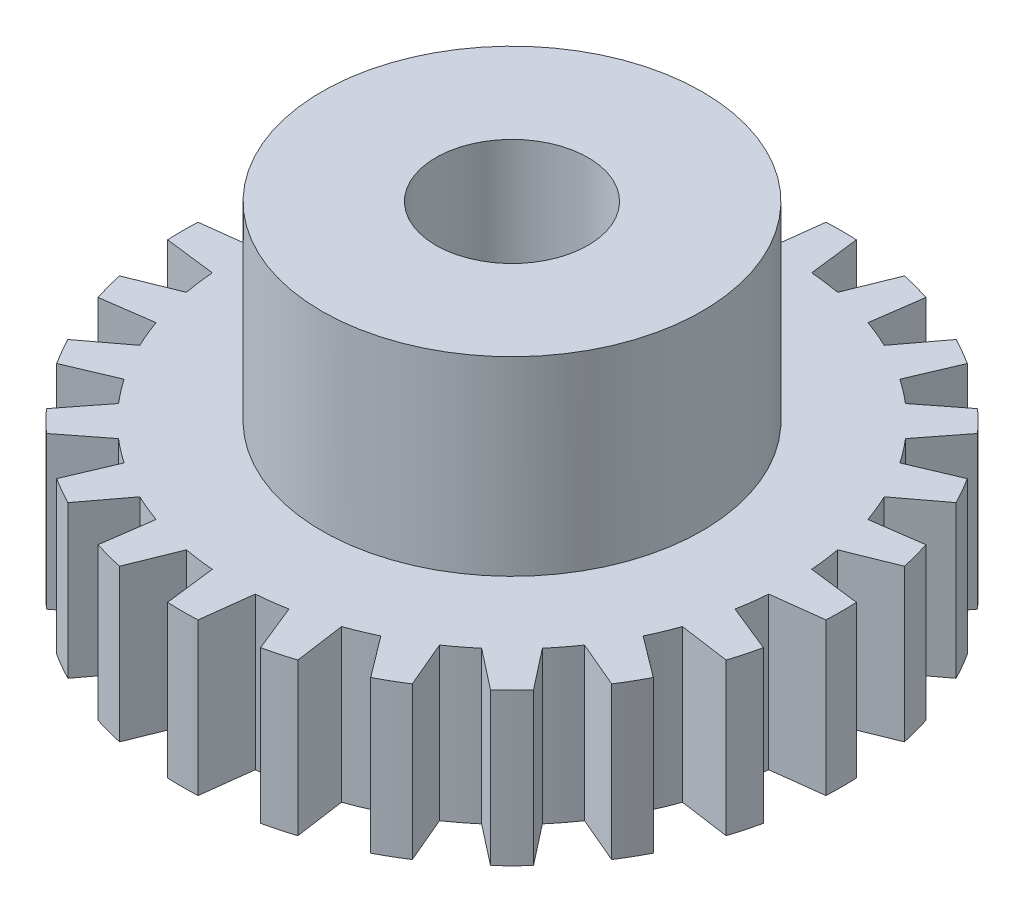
ISO-10303-21;
HEADER;
FILE_DESCRIPTION(('STEP AP214'),'2;1');
FILE_NAME('part.step','',(''),(''),'','','');
FILE_SCHEMA(('AUTOMOTIVE_DESIGN { 1 0 10303 214 1 1 1 1 }'));
ENDSEC;
DATA;
#1=APPLICATION_CONTEXT('core data for automotive mechanical design processes');
#2=APPLICATION_PROTOCOL_DEFINITION('international standard','automotive_design',2000,#1);
#3=PRODUCT_CONTEXT('',#1,'mechanical');
#4=PRODUCT('Part','Part','',(#3));
#5=PRODUCT_RELATED_PRODUCT_CATEGORY('part','',(#4));
#6=PRODUCT_DEFINITION_FORMATION('','',#4);
#7=PRODUCT_DEFINITION_CONTEXT('part definition',#1,'design');
#8=PRODUCT_DEFINITION('design','',#6,#7);
#9=PRODUCT_DEFINITION_SHAPE('','',#8);
#10=(LENGTH_UNIT() NAMED_UNIT(*) SI_UNIT(.MILLI.,.METRE.));
#11=(NAMED_UNIT(*) PLANE_ANGLE_UNIT() SI_UNIT($,.RADIAN.));
#12=(NAMED_UNIT(*) SI_UNIT($,.STERADIAN.) SOLID_ANGLE_UNIT());
#13=UNCERTAINTY_MEASURE_WITH_UNIT(LENGTH_MEASURE(1.E-05),#10,'distance_accuracy_value','');
#14=(GEOMETRIC_REPRESENTATION_CONTEXT(3) GLOBAL_UNCERTAINTY_ASSIGNED_CONTEXT((#13)) GLOBAL_UNIT_ASSIGNED_CONTEXT((#10,
#11,#12)) REPRESENTATION_CONTEXT('',''));
#15=CARTESIAN_POINT('',(0.,0.,0.));
#16=DIRECTION('',(0.,0.,1.));
#17=DIRECTION('',(1.,0.,0.));
#18=AXIS2_PLACEMENT_3D('',#15,#16,#17);
#19=CARTESIAN_POINT('',(0.,6.35,0.));
#20=DIRECTION('',(0.,-1.,0.));
#21=DIRECTION('',(0.,0.,-1.));
#22=AXIS2_PLACEMENT_3D('',#19,#20,#21);
#23=PLANE('',#22);
#24=CARTESIAN_POINT('',(0.,6.35,0.));
#25=DIRECTION('',(0.,1.,0.));
#26=DIRECTION('',(0.,0.,-1.));
#27=AXIS2_PLACEMENT_3D('',#24,#25,#26);
#28=CIRCLE('',#27,13.7541);
#29=CARTESIAN_POINT('',(0.635,6.35,-13.7394338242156));
#30=VERTEX_POINT('',#29);
#31=CARTESIAN_POINT('',(-0.635,6.35,-13.7394338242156));
#32=VERTEX_POINT('',#31);
#33=EDGE_CURVE('E851',#30,#32,#28,.T.);
#34=ORIENTED_EDGE('',*,*,#33,.T.);
#35=DIRECTION('',(-0.121869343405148,0.,0.992546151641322));
#36=VECTOR('',#35,1.);
#37=CARTESIAN_POINT('',(-0.635,6.35,-13.7394338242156));
#38=LINE('',#37,#36);
#39=CARTESIAN_POINT('',(-0.896294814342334,6.35,-11.6113583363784));
#40=VERTEX_POINT('',#39);
#41=EDGE_CURVE('E359',#32,#40,#38,.T.);
#42=ORIENTED_EDGE('',*,*,#41,.T.);
#43=CARTESIAN_POINT('',(0.,6.35,0.));
#44=DIRECTION('',(0.,1.,0.));
#45=DIRECTION('',(0.,0.,-1.));
#46=AXIS2_PLACEMENT_3D('',#43,#44,#45);
#47=CIRCLE('',#46,11.6459);
#48=CARTESIAN_POINT('',(-2.13948636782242,6.35,-11.4476890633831));
#49=VERTEX_POINT('',#48);
#50=EDGE_CURVE('E1149',#40,#49,#47,.T.);
#51=ORIENTED_EDGE('',*,*,#50,.T.);
#52=DIRECTION('',(-0.374606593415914,0.,-0.927183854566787));
#53=VECTOR('',#52,1.);
#54=CARTESIAN_POINT('',(-2.94266424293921,6.35,-13.4356240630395));
#55=LINE('',#54,#53);
#56=CARTESIAN_POINT('',(-2.94266424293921,6.35,-13.4356240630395));
#57=VERTEX_POINT('',#56);
#58=EDGE_CURVE('E1146',#49,#57,#55,.T.);
#59=ORIENTED_EDGE('',*,*,#58,.T.);
#60=CARTESIAN_POINT('',(0.,6.35,0.));
#61=DIRECTION('',(0.,1.,0.));
#62=DIRECTION('',(0.,0.,-1.));
#63=AXIS2_PLACEMENT_3D('',#60,#61,#62);
#64=CIRCLE('',#63,13.7541);
#65=CARTESIAN_POINT('',(-4.16939004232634,6.35,-13.1069238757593));
#66=VERTEX_POINT('',#65);
#67=EDGE_CURVE('E1148',#57,#66,#64,.T.);
#68=ORIENTED_EDGE('',*,*,#67,.T.);
#69=DIRECTION('',(0.139173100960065,0.,0.99026806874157));
#70=VECTOR('',#69,1.);
#71=CARTESIAN_POINT('',(-4.16939004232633,6.35,-13.1069238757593));
#72=LINE('',#71,#70);
#73=CARTESIAN_POINT('',(-3.87099498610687,6.35,-10.9837327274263));
#74=VERTEX_POINT('',#73);
#75=EDGE_CURVE('E1151',#66,#74,#72,.T.);
#76=ORIENTED_EDGE('',*,*,#75,.T.);
#77=CARTESIAN_POINT('',(0.,6.35,0.));
#78=DIRECTION('',(0.,1.,0.));
#79=DIRECTION('',(0.,0.,-1.));
#80=AXIS2_PLACEMENT_3D('',#77,#78,#79);
#81=CIRCLE('',#80,11.6459);
#82=CARTESIAN_POINT('',(-5.02946508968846,6.35,-10.503878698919));
#83=VERTEX_POINT('',#82);
#84=EDGE_CURVE('E1157',#74,#83,#81,.T.);
#85=ORIENTED_EDGE('',*,*,#84,.T.);
#86=DIRECTION('',(-0.60181502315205,0.,-0.798635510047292));
#87=VECTOR('',#86,1.);
#88=CARTESIAN_POINT('',(-6.31979078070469,6.35,-12.2161987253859));
#89=LINE('',#88,#87);
#90=CARTESIAN_POINT('',(-6.31979078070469,6.35,-12.2161987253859));
#91=VERTEX_POINT('',#90);
#92=EDGE_CURVE('E1159',#83,#91,#89,.T.);
#93=ORIENTED_EDGE('',*,*,#92,.T.);
#94=CARTESIAN_POINT('',(0.,6.35,0.));
#95=DIRECTION('',(0.,1.,0.));
#96=DIRECTION('',(0.,0.,-1.));
#97=AXIS2_PLACEMENT_3D('',#94,#95,#96);
#98=CIRCLE('',#97,13.7541);
#99=CARTESIAN_POINT('',(-7.41964304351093,6.35,-11.5811987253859));
#100=VERTEX_POINT('',#99);
#101=EDGE_CURVE('E1161',#91,#100,#98,.T.);
#102=ORIENTED_EDGE('',*,*,#101,.T.);
#103=DIRECTION('',(0.390731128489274,0.,0.92050485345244));
#104=VECTOR('',#103,1.);
#105=CARTESIAN_POINT('',(-7.41964304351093,6.35,-11.5811987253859));
#106=LINE('',#105,#104);
#107=CARTESIAN_POINT('',(-6.5818932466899,6.35,-9.6075838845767));
#108=VERTEX_POINT('',#107);
#109=EDGE_CURVE('E1163',#100,#108,#106,.T.);
#110=ORIENTED_EDGE('',*,*,#109,.T.);
#111=CARTESIAN_POINT('',(0.,6.35,0.));
#112=DIRECTION('',(0.,1.,0.));
#113=DIRECTION('',(0.,0.,-1.));
#114=AXIS2_PLACEMENT_3D('',#111,#112,#113);
#115=CIRCLE('',#114,11.6459);
#116=CARTESIAN_POINT('',(-7.57669407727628,6.35,-8.84424635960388));
#117=VERTEX_POINT('',#116);
#118=EDGE_CURVE('E1165',#108,#117,#115,.T.);
#119=ORIENTED_EDGE('',*,*,#118,.T.);
#120=DIRECTION('',(-0.788010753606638,0.,-0.615661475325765));
#121=VECTOR('',#120,1.);
#122=CARTESIAN_POINT('',(-9.266234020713,6.35,-10.1642596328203));
#123=LINE('',#122,#121);
#124=CARTESIAN_POINT('',(-9.266234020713,6.35,-10.1642596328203));
#125=VERTEX_POINT('',#124);
#126=EDGE_CURVE('E1167',#117,#125,#123,.T.);
#127=ORIENTED_EDGE('',*,*,#126,.T.);
#128=CARTESIAN_POINT('',(0.,6.35,0.));
#129=DIRECTION('',(0.,1.,0.));
#130=DIRECTION('',(0.,0.,-1.));
#131=AXIS2_PLACEMENT_3D('',#128,#129,#130);
#132=CIRCLE('',#131,13.7541);
#133=CARTESIAN_POINT('',(-10.1642596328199,6.35,-9.26623402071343));
#134=VERTEX_POINT('',#133);
#135=EDGE_CURVE('E1169',#125,#134,#132,.T.);
#136=ORIENTED_EDGE('',*,*,#135,.T.);
#137=DIRECTION('',(0.615661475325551,0.,0.788010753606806));
#138=VECTOR('',#137,1.);
#139=CARTESIAN_POINT('',(-10.1642596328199,6.35,-9.26623402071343));
#140=LINE('',#139,#138);
#141=CARTESIAN_POINT('',(-8.84424635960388,6.35,-7.57669407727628));
#142=VERTEX_POINT('',#141);
#143=EDGE_CURVE('E1171',#134,#142,#140,.T.);
#144=ORIENTED_EDGE('',*,*,#143,.T.);
#145=CARTESIAN_POINT('',(0.,6.35,0.));
#146=DIRECTION('',(0.,1.,0.));
#147=DIRECTION('',(0.,0.,-1.));
#148=AXIS2_PLACEMENT_3D('',#145,#146,#147);
#149=CIRCLE('',#148,11.6459);
#150=CARTESIAN_POINT('',(-9.60758388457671,6.35,-6.58189324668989));
#151=VERTEX_POINT('',#150);
#152=EDGE_CURVE('E1173',#142,#151,#149,.T.);
#153=ORIENTED_EDGE('',*,*,#152,.T.);
#154=DIRECTION('',(-0.920504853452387,0.,-0.3907311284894));
#155=VECTOR('',#154,1.);
#156=CARTESIAN_POINT('',(-11.5811987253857,6.35,-7.41964304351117));
#157=LINE('',#156,#155);
#158=CARTESIAN_POINT('',(-11.5811987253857,6.35,-7.41964304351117));
#159=VERTEX_POINT('',#158);
#160=EDGE_CURVE('E1175',#151,#159,#157,.T.);
#161=ORIENTED_EDGE('',*,*,#160,.T.);
#162=CARTESIAN_POINT('',(0.,6.35,0.));
#163=DIRECTION('',(0.,1.,0.));
#164=DIRECTION('',(0.,0.,-1.));
#165=AXIS2_PLACEMENT_3D('',#162,#163,#164);
#166=CIRCLE('',#165,13.7541);
#167=CARTESIAN_POINT('',(-12.2161987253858,6.35,-6.31979078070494));
#168=VERTEX_POINT('',#167);
#169=EDGE_CURVE('E1177',#159,#168,#166,.T.);
#170=ORIENTED_EDGE('',*,*,#169,.T.);
#171=DIRECTION('',(0.79863551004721,0.,0.601815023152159));
#172=VECTOR('',#171,1.);
#173=CARTESIAN_POINT('',(-12.2161987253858,6.35,-6.31979078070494));
#174=LINE('',#173,#172);
#175=CARTESIAN_POINT('',(-10.503878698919,6.35,-5.02946508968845));
#176=VERTEX_POINT('',#175);
#177=EDGE_CURVE('E1179',#168,#176,#174,.T.);
#178=ORIENTED_EDGE('',*,*,#177,.T.);
#179=CARTESIAN_POINT('',(0.,6.35,0.));
#180=DIRECTION('',(0.,1.,0.));
#181=DIRECTION('',(0.,0.,-1.));
#182=AXIS2_PLACEMENT_3D('',#179,#180,#181);
#183=CIRCLE('',#182,11.6459);
#184=CARTESIAN_POINT('',(-10.9837327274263,6.35,-3.87099498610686));
#185=VERTEX_POINT('',#184);
#186=EDGE_CURVE('E1181',#176,#185,#183,.T.);
#187=ORIENTED_EDGE('',*,*,#186,.T.);
#188=DIRECTION('',(-0.990268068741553,0.,-0.139173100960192));
#189=VECTOR('',#188,1.);
#190=CARTESIAN_POINT('',(-13.1069238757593,6.35,-4.16939004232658));
#191=LINE('',#190,#189);
#192=CARTESIAN_POINT('',(-13.1069238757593,6.35,-4.16939004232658));
#193=VERTEX_POINT('',#192);
#194=EDGE_CURVE('E1183',#185,#193,#191,.T.);
#195=ORIENTED_EDGE('',*,*,#194,.T.);
#196=CARTESIAN_POINT('',(0.,6.35,0.));
#197=DIRECTION('',(0.,1.,0.));
#198=DIRECTION('',(0.,0.,-1.));
#199=AXIS2_PLACEMENT_3D('',#196,#197,#198);
#200=CIRCLE('',#199,13.7541);
#201=CARTESIAN_POINT('',(-13.4356240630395,6.35,-2.94266424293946));
#202=VERTEX_POINT('',#201);
#203=EDGE_CURVE('E1185',#193,#202,#200,.T.);
#204=ORIENTED_EDGE('',*,*,#203,.T.);
#205=DIRECTION('',(0.927183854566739,0.,0.374606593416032));
#206=VECTOR('',#205,1.);
#207=CARTESIAN_POINT('',(-13.4356240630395,6.35,-2.94266424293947));
#208=LINE('',#207,#206);
#209=CARTESIAN_POINT('',(-11.4476890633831,6.35,-2.13948636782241));
#210=VERTEX_POINT('',#209);
#211=EDGE_CURVE('E1187',#202,#210,#208,.T.);
#212=ORIENTED_EDGE('',*,*,#211,.T.);
#213=CARTESIAN_POINT('',(0.,6.35,0.));
#214=DIRECTION('',(0.,1.,0.));
#215=DIRECTION('',(0.,0.,-1.));
#216=AXIS2_PLACEMENT_3D('',#213,#214,#215);
#217=CIRCLE('',#216,11.6459);
#218=CARTESIAN_POINT('',(-11.6113583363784,6.35,-0.89629481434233));
#219=VERTEX_POINT('',#218);
#220=EDGE_CURVE('E1189',#210,#219,#217,.T.);
#221=ORIENTED_EDGE('',*,*,#220,.T.);
#222=DIRECTION('',(-0.992546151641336,0.,0.121869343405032));
#223=VECTOR('',#222,1.);
#224=CARTESIAN_POINT('',(-13.7394338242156,6.35,-0.635000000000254));
#225=LINE('',#224,#223);
#226=CARTESIAN_POINT('',(-13.7394338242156,6.35,-0.635000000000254));
#227=VERTEX_POINT('',#226);
#228=EDGE_CURVE('E1191',#219,#227,#225,.T.);
#229=ORIENTED_EDGE('',*,*,#228,.T.);
#230=CARTESIAN_POINT('',(0.,6.35,0.));
#231=DIRECTION('',(0.,1.,0.));
#232=DIRECTION('',(0.,0.,-1.));
#233=AXIS2_PLACEMENT_3D('',#230,#231,#232);
#234=CIRCLE('',#233,13.7541);
#235=CARTESIAN_POINT('',(-13.7394338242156,6.35,0.634999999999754));
#236=VERTEX_POINT('',#235);
#237=EDGE_CURVE('E1193',#227,#236,#234,.T.);
#238=ORIENTED_EDGE('',*,*,#237,.T.);
#239=DIRECTION('',(0.992546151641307,0.,0.121869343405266));
#240=VECTOR('',#239,1.);
#241=CARTESIAN_POINT('',(-13.7394338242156,6.35,0.634999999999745));
#242=LINE('',#241,#240);
#243=CARTESIAN_POINT('',(-11.6113583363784,6.35,0.896294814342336));
#244=VERTEX_POINT('',#243);
#245=EDGE_CURVE('E1195',#236,#244,#242,.T.);
#246=ORIENTED_EDGE('',*,*,#245,.T.);
#247=CARTESIAN_POINT('',(0.,6.35,0.));
#248=DIRECTION('',(0.,1.,0.));
#249=DIRECTION('',(0.,0.,-1.));
#250=AXIS2_PLACEMENT_3D('',#247,#248,#249);
#251=CIRCLE('',#250,11.6459);
#252=CARTESIAN_POINT('',(-11.4476890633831,6.35,2.13948636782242));
#253=VERTEX_POINT('',#252);
#254=EDGE_CURVE('E1197',#244,#253,#251,.T.);
#255=ORIENTED_EDGE('',*,*,#254,.T.);
#256=DIRECTION('',(-0.927183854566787,0.,0.374606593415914));
#257=VECTOR('',#256,1.);
#258=CARTESIAN_POINT('',(-13.4356240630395,6.35,2.94266424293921));
#259=LINE('',#258,#257);
#260=CARTESIAN_POINT('',(-13.4356240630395,6.35,2.94266424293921));
#261=VERTEX_POINT('',#260);
#262=EDGE_CURVE('E1199',#253,#261,#259,.T.);
#263=ORIENTED_EDGE('',*,*,#262,.T.);
#264=CARTESIAN_POINT('',(0.,6.35,0.));
#265=DIRECTION('',(0.,1.,0.));
#266=DIRECTION('',(0.,0.,-1.));
#267=AXIS2_PLACEMENT_3D('',#264,#265,#266);
#268=CIRCLE('',#267,13.7541);
#269=CARTESIAN_POINT('',(-13.1069238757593,6.35,4.16939004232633));
#270=VERTEX_POINT('',#269);
#271=EDGE_CURVE('E1201',#261,#270,#268,.T.);
#272=ORIENTED_EDGE('',*,*,#271,.T.);
#273=DIRECTION('',(0.99026806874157,0.,-0.139173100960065));
#274=VECTOR('',#273,1.);
#275=CARTESIAN_POINT('',(-13.1069238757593,6.35,4.16939004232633));
#276=LINE('',#275,#274);
#277=CARTESIAN_POINT('',(-10.9837327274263,6.35,3.87099498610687));
#278=VERTEX_POINT('',#277);
#279=EDGE_CURVE('E1203',#270,#278,#276,.T.);
#280=ORIENTED_EDGE('',*,*,#279,.T.);
#281=CARTESIAN_POINT('',(0.,6.35,0.));
#282=DIRECTION('',(0.,1.,0.));
#283=DIRECTION('',(0.,0.,-1.));
#284=AXIS2_PLACEMENT_3D('',#281,#282,#283);
#285=CIRCLE('',#284,11.6459);
#286=CARTESIAN_POINT('',(-10.503878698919,6.35,5.02946508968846));
#287=VERTEX_POINT('',#286);
#288=EDGE_CURVE('E1205',#278,#287,#285,.T.);
#289=ORIENTED_EDGE('',*,*,#288,.T.);
#290=DIRECTION('',(-0.798635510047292,0.,0.60181502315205));
#291=VECTOR('',#290,1.);
#292=CARTESIAN_POINT('',(-12.2161987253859,6.35,6.31979078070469));
#293=LINE('',#292,#291);
#294=CARTESIAN_POINT('',(-12.2161987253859,6.35,6.31979078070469));
#295=VERTEX_POINT('',#294);
#296=EDGE_CURVE('E1207',#287,#295,#293,.T.);
#297=ORIENTED_EDGE('',*,*,#296,.T.);
#298=CARTESIAN_POINT('',(0.,6.35,0.));
#299=DIRECTION('',(0.,1.,0.));
#300=DIRECTION('',(0.,0.,-1.));
#301=AXIS2_PLACEMENT_3D('',#298,#299,#300);
#302=CIRCLE('',#301,13.7541);
#303=CARTESIAN_POINT('',(-11.5811987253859,6.35,7.41964304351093));
#304=VERTEX_POINT('',#303);
#305=EDGE_CURVE('E1209',#295,#304,#302,.T.);
#306=ORIENTED_EDGE('',*,*,#305,.T.);
#307=DIRECTION('',(0.920504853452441,0.,-0.390731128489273));
#308=VECTOR('',#307,1.);
#309=CARTESIAN_POINT('',(-11.5811987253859,6.35,7.41964304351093));
#310=LINE('',#309,#308);
#311=CARTESIAN_POINT('',(-9.6075838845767,6.35,6.5818932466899));
#312=VERTEX_POINT('',#311);
#313=EDGE_CURVE('E1211',#304,#312,#310,.T.);
#314=ORIENTED_EDGE('',*,*,#313,.T.);
#315=CARTESIAN_POINT('',(0.,6.35,0.));
#316=DIRECTION('',(0.,1.,0.));
#317=DIRECTION('',(0.,0.,-1.));
#318=AXIS2_PLACEMENT_3D('',#315,#316,#317);
#319=CIRCLE('',#318,11.6459);
#320=CARTESIAN_POINT('',(-8.84424635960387,6.35,7.57669407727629));
#321=VERTEX_POINT('',#320);
#322=EDGE_CURVE('E1213',#312,#321,#319,.T.);
#323=ORIENTED_EDGE('',*,*,#322,.T.);
#324=DIRECTION('',(-0.615661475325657,0.,0.788010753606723));
#325=VECTOR('',#324,1.);
#326=CARTESIAN_POINT('',(-10.1642596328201,6.35,9.26623402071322));
#327=LINE('',#326,#325);
#328=CARTESIAN_POINT('',(-10.1642596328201,6.35,9.26623402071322));
#329=VERTEX_POINT('',#328);
#330=EDGE_CURVE('E1215',#321,#329,#327,.T.);
#331=ORIENTED_EDGE('',*,*,#330,.T.);
#332=CARTESIAN_POINT('',(0.,6.35,0.));
#333=DIRECTION('',(0.,1.,0.));
#334=DIRECTION('',(0.,0.,-1.));
#335=AXIS2_PLACEMENT_3D('',#332,#333,#334);
#336=CIRCLE('',#335,13.7541);
#337=CARTESIAN_POINT('',(-9.26623402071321,6.35,10.1642596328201));
#338=VERTEX_POINT('',#337);
#339=EDGE_CURVE('E1217',#329,#338,#336,.T.);
#340=ORIENTED_EDGE('',*,*,#339,.T.);
#341=DIRECTION('',(0.788010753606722,0.,-0.615661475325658));
#342=VECTOR('',#341,1.);
#343=CARTESIAN_POINT('',(-9.26623402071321,6.35,10.1642596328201));
#344=LINE('',#343,#342);
#345=CARTESIAN_POINT('',(-7.57669407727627,6.35,8.84424635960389));
#346=VERTEX_POINT('',#345);
#347=EDGE_CURVE('E1219',#338,#346,#344,.T.);
#348=ORIENTED_EDGE('',*,*,#347,.T.);
#349=CARTESIAN_POINT('',(0.,6.35,0.));
#350=DIRECTION('',(0.,1.,0.));
#351=DIRECTION('',(0.,0.,-1.));
#352=AXIS2_PLACEMENT_3D('',#349,#350,#351);
#353=CIRCLE('',#352,11.6459);
#354=CARTESIAN_POINT('',(-6.58189324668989,6.35,9.60758388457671));
#355=VERTEX_POINT('',#354);
#356=EDGE_CURVE('E1221',#346,#355,#353,.T.);
#357=ORIENTED_EDGE('',*,*,#356,.T.);
#358=DIRECTION('',(-0.390731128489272,0.,0.920504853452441));
#359=VECTOR('',#358,1.);
#360=CARTESIAN_POINT('',(-7.41964304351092,6.35,11.5811987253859));
#361=LINE('',#360,#359);
#362=CARTESIAN_POINT('',(-7.41964304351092,6.35,11.5811987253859));
#363=VERTEX_POINT('',#362);
#364=EDGE_CURVE('E1223',#355,#363,#361,.T.);
#365=ORIENTED_EDGE('',*,*,#364,.T.);
#366=CARTESIAN_POINT('',(0.,6.35,0.));
#367=DIRECTION('',(0.,1.,0.));
#368=DIRECTION('',(0.,0.,-1.));
#369=AXIS2_PLACEMENT_3D('',#366,#367,#368);
#370=CIRCLE('',#369,13.7541);
#371=CARTESIAN_POINT('',(-6.31979078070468,6.35,12.2161987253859));
#372=VERTEX_POINT('',#371);
#373=EDGE_CURVE('E1225',#363,#372,#370,.T.);
#374=ORIENTED_EDGE('',*,*,#373,.T.);
#375=DIRECTION('',(0.601815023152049,0.,-0.798635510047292));
#376=VECTOR('',#375,1.);
#377=CARTESIAN_POINT('',(-6.31979078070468,6.35,12.2161987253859));
#378=LINE('',#377,#376);
#379=CARTESIAN_POINT('',(-5.02946508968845,6.35,10.503878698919));
#380=VERTEX_POINT('',#379);
#381=EDGE_CURVE('E1227',#372,#380,#378,.T.);
#382=ORIENTED_EDGE('',*,*,#381,.T.);
#383=CARTESIAN_POINT('',(0.,6.35,0.));
#384=DIRECTION('',(0.,1.,0.));
#385=DIRECTION('',(0.,0.,-1.));
#386=AXIS2_PLACEMENT_3D('',#383,#384,#385);
#387=CIRCLE('',#386,11.6459);
#388=CARTESIAN_POINT('',(-3.87099498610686,6.35,10.9837327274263));
#389=VERTEX_POINT('',#388);
#390=EDGE_CURVE('E1229',#380,#389,#387,.T.);
#391=ORIENTED_EDGE('',*,*,#390,.T.);
#392=DIRECTION('',(-0.139173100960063,0.,0.990268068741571));
#393=VECTOR('',#392,1.);
#394=CARTESIAN_POINT('',(-4.16939004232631,6.35,13.1069238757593));
#395=LINE('',#394,#393);
#396=CARTESIAN_POINT('',(-4.16939004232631,6.35,13.1069238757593));
#397=VERTEX_POINT('',#396);
#398=EDGE_CURVE('E1231',#389,#397,#395,.T.);
#399=ORIENTED_EDGE('',*,*,#398,.T.);
#400=CARTESIAN_POINT('',(0.,6.35,0.));
#401=DIRECTION('',(0.,1.,0.));
#402=DIRECTION('',(0.,0.,-1.));
#403=AXIS2_PLACEMENT_3D('',#400,#401,#402);
#404=CIRCLE('',#403,13.7541);
#405=CARTESIAN_POINT('',(-2.94266424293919,6.35,13.4356240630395));
#406=VERTEX_POINT('',#405);
#407=EDGE_CURVE('E1233',#397,#406,#404,.T.);
#408=ORIENTED_EDGE('',*,*,#407,.T.);
#409=DIRECTION('',(0.374606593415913,0.,-0.927183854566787));
#410=VECTOR('',#409,1.);
#411=CARTESIAN_POINT('',(-2.94266424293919,6.35,13.4356240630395));
#412=LINE('',#411,#410);
#413=CARTESIAN_POINT('',(-2.13948636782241,6.35,11.4476890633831));
#414=VERTEX_POINT('',#413);
#415=EDGE_CURVE('E1235',#406,#414,#412,.T.);
#416=ORIENTED_EDGE('',*,*,#415,.T.);
#417=CARTESIAN_POINT('',(0.,6.35,0.));
#418=DIRECTION('',(0.,1.,0.));
#419=DIRECTION('',(0.,0.,-1.));
#420=AXIS2_PLACEMENT_3D('',#417,#418,#419);
#421=CIRCLE('',#420,11.6459);
#422=CARTESIAN_POINT('',(-0.896294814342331,6.35,11.6113583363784));
#423=VERTEX_POINT('',#422);
#424=EDGE_CURVE('E1237',#414,#423,#421,.T.);
#425=ORIENTED_EDGE('',*,*,#424,.T.);
#426=DIRECTION('',(0.121869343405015,0.,0.992546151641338));
#427=VECTOR('',#426,1.);
#428=CARTESIAN_POINT('',(-0.635000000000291,6.35,13.7394338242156));
#429=LINE('',#428,#427);
#430=CARTESIAN_POINT('',(-0.635000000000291,6.35,13.7394338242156));
#431=VERTEX_POINT('',#430);
#432=EDGE_CURVE('E1239',#423,#431,#429,.T.);
#433=ORIENTED_EDGE('',*,*,#432,.T.);
#434=CARTESIAN_POINT('',(0.,6.35,0.));
#435=DIRECTION('',(0.,1.,0.));
#436=DIRECTION('',(0.,0.,-1.));
#437=AXIS2_PLACEMENT_3D('',#434,#435,#436);
#438=CIRCLE('',#437,13.7541);
#439=CARTESIAN_POINT('',(0.634999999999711,6.35,13.7394338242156));
#440=VERTEX_POINT('',#439);
#441=EDGE_CURVE('E1241',#431,#440,#438,.T.);
#442=ORIENTED_EDGE('',*,*,#441,.T.);
#443=DIRECTION('',(0.121869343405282,0.,-0.992546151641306));
#444=VECTOR('',#443,1.);
#445=CARTESIAN_POINT('',(0.63499999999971,6.35,13.7394338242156));
#446=LINE('',#445,#444);
#447=CARTESIAN_POINT('',(0.896294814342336,6.35,11.6113583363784));
#448=VERTEX_POINT('',#447);
#449=EDGE_CURVE('E1243',#440,#448,#446,.T.);
#450=ORIENTED_EDGE('',*,*,#449,.T.);
#451=CARTESIAN_POINT('',(0.,6.35,0.));
#452=DIRECTION('',(0.,1.,0.));
#453=DIRECTION('',(0.,0.,-1.));
#454=AXIS2_PLACEMENT_3D('',#451,#452,#453);
#455=CIRCLE('',#454,11.6459);
#456=CARTESIAN_POINT('',(2.13948636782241,6.35,11.4476890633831));
#457=VERTEX_POINT('',#456);
#458=EDGE_CURVE('E1245',#448,#457,#455,.T.);
#459=ORIENTED_EDGE('',*,*,#458,.T.);
#460=DIRECTION('',(0.374606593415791,0.,0.927183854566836));
#461=VECTOR('',#460,1.);
#462=CARTESIAN_POINT('',(2.94266424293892,6.35,13.4356240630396));
#463=LINE('',#462,#461);
#464=CARTESIAN_POINT('',(2.94266424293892,6.35,13.4356240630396));
#465=VERTEX_POINT('',#464);
#466=EDGE_CURVE('E1247',#457,#465,#463,.T.);
#467=ORIENTED_EDGE('',*,*,#466,.T.);
#468=CARTESIAN_POINT('',(0.,6.35,0.));
#469=DIRECTION('',(0.,1.,0.));
#470=DIRECTION('',(0.,0.,-1.));
#471=AXIS2_PLACEMENT_3D('',#468,#469,#470);
#472=CIRCLE('',#471,13.7541);
#473=CARTESIAN_POINT('',(4.16939004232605,6.35,13.1069238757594));
#474=VERTEX_POINT('',#473);
#475=EDGE_CURVE('E1249',#465,#474,#472,.T.);
#476=ORIENTED_EDGE('',*,*,#475,.T.);
#477=DIRECTION('',(-0.139173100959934,0.,-0.990268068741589));
#478=VECTOR('',#477,1.);
#479=CARTESIAN_POINT('',(4.16939004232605,6.35,13.1069238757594));
#480=LINE('',#479,#478);
#481=CARTESIAN_POINT('',(3.87099498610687,6.35,10.9837327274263));
#482=VERTEX_POINT('',#481);
#483=EDGE_CURVE('E1251',#474,#482,#480,.T.);
#484=ORIENTED_EDGE('',*,*,#483,.T.);
#485=CARTESIAN_POINT('',(0.,6.35,0.));
#486=DIRECTION('',(0.,1.,0.));
#487=DIRECTION('',(0.,0.,-1.));
#488=AXIS2_PLACEMENT_3D('',#485,#486,#487);
#489=CIRCLE('',#488,11.6459);
#490=CARTESIAN_POINT('',(5.02946508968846,6.35,10.503878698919));
#491=VERTEX_POINT('',#490);
#492=EDGE_CURVE('E1253',#482,#491,#489,.T.);
#493=ORIENTED_EDGE('',*,*,#492,.T.);
#494=DIRECTION('',(0.601815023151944,0.,0.798635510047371));
#495=VECTOR('',#494,1.);
#496=CARTESIAN_POINT('',(6.31979078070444,6.35,12.216198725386));
#497=LINE('',#496,#495);
#498=CARTESIAN_POINT('',(6.31979078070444,6.35,12.216198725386));
#499=VERTEX_POINT('',#498);
#500=EDGE_CURVE('E1255',#491,#499,#497,.T.);
#501=ORIENTED_EDGE('',*,*,#500,.T.);
#502=CARTESIAN_POINT('',(0.,6.35,0.));
#503=DIRECTION('',(0.,1.,0.));
#504=DIRECTION('',(0.,0.,-1.));
#505=AXIS2_PLACEMENT_3D('',#502,#503,#504);
#506=CIRCLE('',#505,13.7541);
#507=CARTESIAN_POINT('',(7.41964304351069,6.35,11.581198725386));
#508=VERTEX_POINT('',#507);
#509=EDGE_CURVE('E1257',#499,#508,#506,.T.);
#510=ORIENTED_EDGE('',*,*,#509,.T.);
#511=DIRECTION('',(-0.390731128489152,0.,-0.920504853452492));
#512=VECTOR('',#511,1.);
#513=CARTESIAN_POINT('',(7.41964304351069,6.35,11.581198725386));
#514=LINE('',#513,#512);
#515=CARTESIAN_POINT('',(6.5818932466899,6.35,9.6075838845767));
#516=VERTEX_POINT('',#515);
#517=EDGE_CURVE('E1259',#508,#516,#514,.T.);
#518=ORIENTED_EDGE('',*,*,#517,.T.);
#519=CARTESIAN_POINT('',(0.,6.35,0.));
#520=DIRECTION('',(0.,1.,0.));
#521=DIRECTION('',(0.,0.,-1.));
#522=AXIS2_PLACEMENT_3D('',#519,#520,#521);
#523=CIRCLE('',#522,11.6459);
#524=CARTESIAN_POINT('',(7.57669407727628,6.35,8.84424635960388));
#525=VERTEX_POINT('',#524);
#526=EDGE_CURVE('E1261',#516,#525,#523,.T.);
#527=ORIENTED_EDGE('',*,*,#526,.T.);
#528=DIRECTION('',(0.788010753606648,0.,0.615661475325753));
#529=VECTOR('',#528,1.);
#530=CARTESIAN_POINT('',(9.26623402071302,6.35,10.1642596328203));
#531=LINE('',#530,#529);
#532=CARTESIAN_POINT('',(9.26623402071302,6.35,10.1642596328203));
#533=VERTEX_POINT('',#532);
#534=EDGE_CURVE('E1263',#525,#533,#531,.T.);
#535=ORIENTED_EDGE('',*,*,#534,.T.);
#536=CARTESIAN_POINT('',(0.,6.35,0.));
#537=DIRECTION('',(0.,1.,0.));
#538=DIRECTION('',(0.,0.,-1.));
#539=AXIS2_PLACEMENT_3D('',#536,#537,#538);
#540=CIRCLE('',#539,13.7541);
#541=CARTESIAN_POINT('',(10.16425963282,6.35,9.26623402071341));
#542=VERTEX_POINT('',#541);
#543=EDGE_CURVE('E1265',#533,#542,#540,.T.);
#544=ORIENTED_EDGE('',*,*,#543,.T.);
#545=DIRECTION('',(-0.615661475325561,0.,-0.788010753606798));
#546=VECTOR('',#545,1.);
#547=CARTESIAN_POINT('',(10.16425963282,6.35,9.26623402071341));
#548=LINE('',#547,#546);
#549=CARTESIAN_POINT('',(8.84424635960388,6.35,7.57669407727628));
#550=VERTEX_POINT('',#549);
#551=EDGE_CURVE('E1267',#542,#550,#548,.T.);
#552=ORIENTED_EDGE('',*,*,#551,.T.);
#553=CARTESIAN_POINT('',(0.,6.35,0.));
#554=DIRECTION('',(0.,1.,0.));
#555=DIRECTION('',(0.,0.,-1.));
#556=AXIS2_PLACEMENT_3D('',#553,#554,#555);
#557=CIRCLE('',#556,11.6459);
#558=CARTESIAN_POINT('',(9.60758388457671,6.35,6.58189324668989));
#559=VERTEX_POINT('',#558);
#560=EDGE_CURVE('E1269',#550,#559,#557,.T.);
#561=ORIENTED_EDGE('',*,*,#560,.T.);
#562=DIRECTION('',(0.920504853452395,0.,0.390731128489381));
#563=VECTOR('',#562,1.);
#564=CARTESIAN_POINT('',(11.5811987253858,6.35,7.41964304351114));
#565=LINE('',#564,#563);
#566=CARTESIAN_POINT('',(11.5811987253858,6.35,7.41964304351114));
#567=VERTEX_POINT('',#566);
#568=EDGE_CURVE('E1271',#559,#567,#565,.T.);
#569=ORIENTED_EDGE('',*,*,#568,.T.);
#570=CARTESIAN_POINT('',(0.,6.35,0.));
#571=DIRECTION('',(0.,1.,0.));
#572=DIRECTION('',(0.,0.,-1.));
#573=AXIS2_PLACEMENT_3D('',#570,#571,#572);
#574=CIRCLE('',#573,13.7541);
#575=CARTESIAN_POINT('',(12.2161987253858,6.35,6.31979078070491));
#576=VERTEX_POINT('',#575);
#577=EDGE_CURVE('E1273',#567,#576,#574,.T.);
#578=ORIENTED_EDGE('',*,*,#577,.T.);
#579=DIRECTION('',(-0.798635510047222,0.,-0.601815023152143));
#580=VECTOR('',#579,1.);
#581=CARTESIAN_POINT('',(12.2161987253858,6.35,6.31979078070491));
#582=LINE('',#581,#580);
#583=CARTESIAN_POINT('',(10.503878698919,6.35,5.02946508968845));
#584=VERTEX_POINT('',#583);
#585=EDGE_CURVE('E1275',#576,#584,#582,.T.);
#586=ORIENTED_EDGE('',*,*,#585,.T.);
#587=CARTESIAN_POINT('',(0.,6.35,0.));
#588=DIRECTION('',(0.,1.,0.));
#589=DIRECTION('',(0.,0.,-1.));
#590=AXIS2_PLACEMENT_3D('',#587,#588,#589);
#591=CIRCLE('',#590,11.6459);
#592=CARTESIAN_POINT('',(10.9837327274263,6.35,3.87099498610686));
#593=VERTEX_POINT('',#592);
#594=EDGE_CURVE('E1277',#584,#593,#591,.T.);
#595=ORIENTED_EDGE('',*,*,#594,.T.);
#596=DIRECTION('',(0.990268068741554,0.,0.139173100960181));
#597=VECTOR('',#596,1.);
#598=CARTESIAN_POINT('',(13.1069238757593,6.35,4.16939004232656));
#599=LINE('',#598,#597);
#600=CARTESIAN_POINT('',(13.1069238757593,6.35,4.16939004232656));
#601=VERTEX_POINT('',#600);
#602=EDGE_CURVE('E1279',#593,#601,#599,.T.);
#603=ORIENTED_EDGE('',*,*,#602,.T.);
#604=CARTESIAN_POINT('',(0.,6.35,0.));
#605=DIRECTION('',(0.,1.,0.));
#606=DIRECTION('',(0.,0.,-1.));
#607=AXIS2_PLACEMENT_3D('',#604,#605,#606);
#608=CIRCLE('',#607,13.7541);
#609=CARTESIAN_POINT('',(13.4356240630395,6.35,2.94266424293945));
#610=VERTEX_POINT('',#609);
#611=EDGE_CURVE('E1281',#601,#610,#608,.T.);
#612=ORIENTED_EDGE('',*,*,#611,.T.);
#613=DIRECTION('',(-0.927183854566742,0.,-0.374606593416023));
#614=VECTOR('',#613,1.);
#615=CARTESIAN_POINT('',(13.4356240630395,6.35,2.94266424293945));
#616=LINE('',#615,#614);
#617=CARTESIAN_POINT('',(11.4476890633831,6.35,2.13948636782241));
#618=VERTEX_POINT('',#617);
#619=EDGE_CURVE('E1283',#610,#618,#616,.T.);
#620=ORIENTED_EDGE('',*,*,#619,.T.);
#621=CARTESIAN_POINT('',(0.,6.35,0.));
#622=DIRECTION('',(0.,1.,0.));
#623=DIRECTION('',(0.,0.,-1.));
#624=AXIS2_PLACEMENT_3D('',#621,#622,#623);
#625=CIRCLE('',#624,11.6459);
#626=CARTESIAN_POINT('',(11.6113583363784,6.35,0.896294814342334));
#627=VERTEX_POINT('',#626);
#628=EDGE_CURVE('E1285',#618,#627,#625,.T.);
#629=ORIENTED_EDGE('',*,*,#628,.T.);
#630=DIRECTION('',(0.992546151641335,0.,-0.12186934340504));
#631=VECTOR('',#630,1.);
#632=CARTESIAN_POINT('',(13.7394338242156,6.35,0.635000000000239));
#633=LINE('',#632,#631);
#634=CARTESIAN_POINT('',(13.7394338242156,6.35,0.635000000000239));
#635=VERTEX_POINT('',#634);
#636=EDGE_CURVE('E1287',#627,#635,#633,.T.);
#637=ORIENTED_EDGE('',*,*,#636,.T.);
#638=CARTESIAN_POINT('',(0.,6.35,0.));
#639=DIRECTION('',(0.,1.,0.));
#640=DIRECTION('',(0.,0.,-1.));
#641=AXIS2_PLACEMENT_3D('',#638,#639,#640);
#642=CIRCLE('',#641,13.7541);
#643=CARTESIAN_POINT('',(13.7394338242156,6.35,-0.634999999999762));
#644=VERTEX_POINT('',#643);
#645=EDGE_CURVE('E1289',#635,#644,#642,.T.);
#646=ORIENTED_EDGE('',*,*,#645,.T.);
#647=DIRECTION('',(-0.992546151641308,0.,-0.121869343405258));
#648=VECTOR('',#647,1.);
#649=CARTESIAN_POINT('',(13.7394338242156,6.35,-0.634999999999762));
#650=LINE('',#649,#648);
#651=CARTESIAN_POINT('',(11.6113583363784,6.35,-0.896294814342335));
#652=VERTEX_POINT('',#651);
#653=EDGE_CURVE('E1291',#644,#652,#650,.T.);
#654=ORIENTED_EDGE('',*,*,#653,.T.);
#655=CARTESIAN_POINT('',(0.,6.35,0.));
#656=DIRECTION('',(0.,1.,0.));
#657=DIRECTION('',(0.,0.,-1.));
#658=AXIS2_PLACEMENT_3D('',#655,#656,#657);
#659=CIRCLE('',#658,11.6459);
#660=CARTESIAN_POINT('',(11.4476890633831,6.35,-2.13948636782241));
#661=VERTEX_POINT('',#660);
#662=EDGE_CURVE('E1293',#652,#661,#659,.T.);
#663=ORIENTED_EDGE('',*,*,#662,.T.);
#664=DIRECTION('',(0.927183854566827,0.,-0.374606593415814));
#665=VECTOR('',#664,1.);
#666=CARTESIAN_POINT('',(13.4356240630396,6.35,-2.94266424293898));
#667=LINE('',#666,#665);
#668=CARTESIAN_POINT('',(13.4356240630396,6.35,-2.94266424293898));
#669=VERTEX_POINT('',#668);
#670=EDGE_CURVE('E1295',#661,#669,#667,.T.);
#671=ORIENTED_EDGE('',*,*,#670,.T.);
#672=CARTESIAN_POINT('',(0.,6.35,0.));
#673=DIRECTION('',(0.,1.,0.));
#674=DIRECTION('',(0.,0.,-1.));
#675=AXIS2_PLACEMENT_3D('',#672,#673,#674);
#676=CIRCLE('',#675,13.7541);
#677=CARTESIAN_POINT('',(13.1069238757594,6.35,-4.1693900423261));
#678=VERTEX_POINT('',#677);
#679=EDGE_CURVE('E1297',#669,#678,#676,.T.);
#680=ORIENTED_EDGE('',*,*,#679,.T.);
#681=DIRECTION('',(-0.990268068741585,0.,0.139173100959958));
#682=VECTOR('',#681,1.);
#683=CARTESIAN_POINT('',(13.1069238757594,6.35,-4.1693900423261));
#684=LINE('',#683,#682);
#685=CARTESIAN_POINT('',(10.9837327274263,6.35,-3.87099498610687));
#686=VERTEX_POINT('',#685);
#687=EDGE_CURVE('E1299',#678,#686,#684,.T.);
#688=ORIENTED_EDGE('',*,*,#687,.T.);
#689=CARTESIAN_POINT('',(0.,6.35,0.));
#690=DIRECTION('',(0.,1.,0.));
#691=DIRECTION('',(0.,0.,-1.));
#692=AXIS2_PLACEMENT_3D('',#689,#690,#691);
#693=CIRCLE('',#692,11.6459);
#694=CARTESIAN_POINT('',(10.503878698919,6.35,-5.02946508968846));
#695=VERTEX_POINT('',#694);
#696=EDGE_CURVE('E1301',#686,#695,#693,.T.);
#697=ORIENTED_EDGE('',*,*,#696,.T.);
#698=DIRECTION('',(0.798635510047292,0.,-0.60181502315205));
#699=VECTOR('',#698,1.);
#700=CARTESIAN_POINT('',(12.2161987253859,6.35,-6.31979078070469));
#701=LINE('',#700,#699);
#702=CARTESIAN_POINT('',(12.2161987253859,6.35,-6.31979078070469));
#703=VERTEX_POINT('',#702);
#704=EDGE_CURVE('E1303',#695,#703,#701,.T.);
#705=ORIENTED_EDGE('',*,*,#704,.T.);
#706=CARTESIAN_POINT('',(0.,6.35,0.));
#707=DIRECTION('',(0.,1.,0.));
#708=DIRECTION('',(0.,0.,-1.));
#709=AXIS2_PLACEMENT_3D('',#706,#707,#708);
#710=CIRCLE('',#709,13.7541);
#711=CARTESIAN_POINT('',(11.5811987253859,6.35,-7.41964304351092));
#712=VERTEX_POINT('',#711);
#713=EDGE_CURVE('E1305',#703,#712,#710,.T.);
#714=ORIENTED_EDGE('',*,*,#713,.T.);
#715=DIRECTION('',(-0.920504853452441,0.,0.390731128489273));
#716=VECTOR('',#715,1.);
#717=CARTESIAN_POINT('',(11.5811987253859,6.35,-7.41964304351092));
#718=LINE('',#717,#716);
#719=CARTESIAN_POINT('',(9.6075838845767,6.35,-6.5818932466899));
#720=VERTEX_POINT('',#719);
#721=EDGE_CURVE('E1307',#712,#720,#718,.T.);
#722=ORIENTED_EDGE('',*,*,#721,.T.);
#723=CARTESIAN_POINT('',(0.,6.35,0.));
#724=DIRECTION('',(0.,1.,0.));
#725=DIRECTION('',(0.,0.,-1.));
#726=AXIS2_PLACEMENT_3D('',#723,#724,#725);
#727=CIRCLE('',#726,11.6459);
#728=CARTESIAN_POINT('',(8.84424635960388,6.35,-7.57669407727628));
#729=VERTEX_POINT('',#728);
#730=EDGE_CURVE('E1309',#720,#729,#727,.T.);
#731=ORIENTED_EDGE('',*,*,#730,.T.);
#732=DIRECTION('',(0.615661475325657,0.,-0.788010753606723));
#733=VECTOR('',#732,1.);
#734=CARTESIAN_POINT('',(10.1642596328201,6.35,-9.26623402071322));
#735=LINE('',#734,#733);
#736=CARTESIAN_POINT('',(10.1642596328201,6.35,-9.26623402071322));
#737=VERTEX_POINT('',#736);
#738=EDGE_CURVE('E1311',#729,#737,#735,.T.);
#739=ORIENTED_EDGE('',*,*,#738,.T.);
#740=CARTESIAN_POINT('',(0.,6.35,0.));
#741=DIRECTION('',(0.,1.,0.));
#742=DIRECTION('',(0.,0.,-1.));
#743=AXIS2_PLACEMENT_3D('',#740,#741,#742);
#744=CIRCLE('',#743,13.7541);
#745=CARTESIAN_POINT('',(9.26623402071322,6.35,-10.1642596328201));
#746=VERTEX_POINT('',#745);
#747=EDGE_CURVE('E1313',#737,#746,#744,.T.);
#748=ORIENTED_EDGE('',*,*,#747,.T.);
#749=DIRECTION('',(-0.788010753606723,0.,0.615661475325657));
#750=VECTOR('',#749,1.);
#751=CARTESIAN_POINT('',(9.26623402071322,6.35,-10.1642596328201));
#752=LINE('',#751,#750);
#753=CARTESIAN_POINT('',(7.57669407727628,6.35,-8.84424635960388));
#754=VERTEX_POINT('',#753);
#755=EDGE_CURVE('E1315',#746,#754,#752,.T.);
#756=ORIENTED_EDGE('',*,*,#755,.T.);
#757=CARTESIAN_POINT('',(0.,6.35,0.));
#758=DIRECTION('',(0.,1.,0.));
#759=DIRECTION('',(0.,0.,-1.));
#760=AXIS2_PLACEMENT_3D('',#757,#758,#759);
#761=CIRCLE('',#760,11.6459);
#762=CARTESIAN_POINT('',(6.58189324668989,6.35,-9.6075838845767));
#763=VERTEX_POINT('',#762);
#764=EDGE_CURVE('E1317',#754,#763,#761,.T.);
#765=ORIENTED_EDGE('',*,*,#764,.T.);
#766=DIRECTION('',(0.3907311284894,0.,-0.920504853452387));
#767=VECTOR('',#766,1.);
#768=CARTESIAN_POINT('',(7.41964304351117,6.35,-11.5811987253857));
#769=LINE('',#768,#767);
#770=CARTESIAN_POINT('',(7.41964304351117,6.35,-11.5811987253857));
#771=VERTEX_POINT('',#770);
#772=EDGE_CURVE('E1319',#763,#771,#769,.T.);
#773=ORIENTED_EDGE('',*,*,#772,.T.);
#774=CARTESIAN_POINT('',(0.,6.35,0.));
#775=DIRECTION('',(0.,1.,0.));
#776=DIRECTION('',(0.,0.,-1.));
#777=AXIS2_PLACEMENT_3D('',#774,#775,#776);
#778=CIRCLE('',#777,13.7541);
#779=CARTESIAN_POINT('',(6.31979078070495,6.35,-12.2161987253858));
#780=VERTEX_POINT('',#779);
#781=EDGE_CURVE('E1321',#771,#780,#778,.T.);
#782=ORIENTED_EDGE('',*,*,#781,.T.);
#783=DIRECTION('',(-0.60181502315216,0.,0.798635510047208));
#784=VECTOR('',#783,1.);
#785=CARTESIAN_POINT('',(6.31979078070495,6.35,-12.2161987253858));
#786=LINE('',#785,#784);
#787=CARTESIAN_POINT('',(5.02946508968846,6.35,-10.503878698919));
#788=VERTEX_POINT('',#787);
#789=EDGE_CURVE('E1323',#780,#788,#786,.T.);
#790=ORIENTED_EDGE('',*,*,#789,.T.);
#791=CARTESIAN_POINT('',(0.,6.35,0.));
#792=DIRECTION('',(0.,1.,0.));
#793=DIRECTION('',(0.,0.,-1.));
#794=AXIS2_PLACEMENT_3D('',#791,#792,#793);
#795=CIRCLE('',#794,11.6459);
#796=CARTESIAN_POINT('',(3.87099498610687,6.35,-10.9837327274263));
#797=VERTEX_POINT('',#796);
#798=EDGE_CURVE('E1325',#788,#797,#795,.T.);
#799=ORIENTED_EDGE('',*,*,#798,.T.);
#800=DIRECTION('',(0.139173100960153,0.,-0.990268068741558));
#801=VECTOR('',#800,1.);
#802=CARTESIAN_POINT('',(4.1693900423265,6.35,-13.1069238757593));
#803=LINE('',#802,#801);
#804=CARTESIAN_POINT('',(4.1693900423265,6.35,-13.1069238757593));
#805=VERTEX_POINT('',#804);
#806=EDGE_CURVE('E1327',#797,#805,#803,.T.);
#807=ORIENTED_EDGE('',*,*,#806,.T.);
#808=CARTESIAN_POINT('',(0.,6.35,0.));
#809=DIRECTION('',(0.,1.,0.));
#810=DIRECTION('',(0.,0.,-1.));
#811=AXIS2_PLACEMENT_3D('',#808,#809,#810);
#812=CIRCLE('',#811,13.7541);
#813=CARTESIAN_POINT('',(2.94266424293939,6.35,-13.4356240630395));
#814=VERTEX_POINT('',#813);
#815=EDGE_CURVE('E642',#805,#814,#812,.T.);
#816=ORIENTED_EDGE('',*,*,#815,.T.);
#817=DIRECTION('',(-0.374606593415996,0.,0.927183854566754));
#818=VECTOR('',#817,1.);
#819=CARTESIAN_POINT('',(2.94266424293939,6.35,-13.4356240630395));
#820=LINE('',#819,#818);
#821=CARTESIAN_POINT('',(2.13948636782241,6.35,-11.4476890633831));
#822=VERTEX_POINT('',#821);
#823=EDGE_CURVE('E636',#814,#822,#820,.T.);
#824=ORIENTED_EDGE('',*,*,#823,.T.);
#825=CARTESIAN_POINT('',(0.,6.35,0.));
#826=DIRECTION('',(0.,1.,0.));
#827=DIRECTION('',(0.,0.,-1.));
#828=AXIS2_PLACEMENT_3D('',#825,#826,#827);
#829=CIRCLE('',#828,11.6459);
#830=CARTESIAN_POINT('',(0.896294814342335,6.35,-11.6113583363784));
#831=VERTEX_POINT('',#830);
#832=EDGE_CURVE('E640',#822,#831,#829,.T.);
#833=ORIENTED_EDGE('',*,*,#832,.T.);
#834=DIRECTION('',(-0.121869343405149,0.,-0.992546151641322));
#835=VECTOR('',#834,1.);
#836=CARTESIAN_POINT('',(0.635,6.35,-13.7394338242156));
#837=LINE('',#836,#835);
#838=EDGE_CURVE('E51',#831,#30,#837,.T.);
#839=ORIENTED_EDGE('',*,*,#838,.T.);
#840=EDGE_LOOP('',(#34,#42,#51,#59,#68,#76,#85,#93,#102,#110,#119,#127,#136,#144,#153,#161,#170,
#178,#187,#195,#204,#212,#221,#229,#238,#246,#255,#263,#272,#280,#289,#297,#306,#314,#323,#331,
#340,#348,#357,#365,#374,#382,#391,#399,#408,#416,#425,#433,#442,#450,#459,#467,#476,#484,#493,
#501,#510,#518,#527,#535,#544,#552,#561,#569,#578,#586,#595,#603,#612,#620,#629,#637,#646,#654,
#663,#671,#680,#688,#697,#705,#714,#722,#731,#739,#748,#756,#765,#773,#782,#790,#799,#807,#816,
#824,#833,#839));
#841=FACE_BOUND('',#840,.T.);
#842=CARTESIAN_POINT('',(0.,6.35,0.));
#843=DIRECTION('',(0.,-1.,0.));
#844=DIRECTION('',(0.,0.,-1.));
#845=AXIS2_PLACEMENT_3D('',#842,#843,#844);
#846=CIRCLE('',#845,7.9375);
#847=CARTESIAN_POINT('',(0.,6.35,-7.9375));
#848=VERTEX_POINT('',#847);
#849=EDGE_CURVE('E11',#848,#848,#846,.F.);
#850=ORIENTED_EDGE('',*,*,#849,.F.);
#851=EDGE_LOOP('',(#850));
#852=FACE_BOUND('',#851,.T.);
#853=ADVANCED_FACE('F34',(#841,#852),#23,.F.);
#854=CARTESIAN_POINT('',(0.,0.,0.));
#855=DIRECTION('',(0.,-1.,0.));
#856=DIRECTION('',(0.,0.,-1.));
#857=AXIS2_PLACEMENT_3D('',#854,#855,#856);
#858=PLANE('',#857);
#859=CARTESIAN_POINT('',(0.,0.,0.));
#860=DIRECTION('',(0.,1.,0.));
#861=DIRECTION('',(0.,0.,-1.));
#862=AXIS2_PLACEMENT_3D('',#859,#860,#861);
#863=CIRCLE('',#862,13.7541);
#864=CARTESIAN_POINT('',(0.635,0.,-13.7394338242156));
#865=VERTEX_POINT('',#864);
#866=CARTESIAN_POINT('',(-0.635,0.,-13.7394338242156));
#867=VERTEX_POINT('',#866);
#868=EDGE_CURVE('E660',#865,#867,#863,.T.);
#869=ORIENTED_EDGE('',*,*,#868,.F.);
#870=DIRECTION('',(-0.121869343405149,0.,-0.992546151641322));
#871=VECTOR('',#870,1.);
#872=CARTESIAN_POINT('',(0.635,0.,-13.7394338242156));
#873=LINE('',#872,#871);
#874=CARTESIAN_POINT('',(0.896294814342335,0.,-11.6113583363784));
#875=VERTEX_POINT('',#874);
#876=EDGE_CURVE('E350',#875,#865,#873,.T.);
#877=ORIENTED_EDGE('',*,*,#876,.F.);
#878=CARTESIAN_POINT('',(0.,0.,0.));
#879=DIRECTION('',(0.,1.,0.));
#880=DIRECTION('',(0.,0.,-1.));
#881=AXIS2_PLACEMENT_3D('',#878,#879,#880);
#882=CIRCLE('',#881,11.6459);
#883=CARTESIAN_POINT('',(2.13948636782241,0.,-11.4476890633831));
#884=VERTEX_POINT('',#883);
#885=EDGE_CURVE('E344',#884,#875,#882,.T.);
#886=ORIENTED_EDGE('',*,*,#885,.F.);
#887=DIRECTION('',(-0.374606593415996,0.,0.927183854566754));
#888=VECTOR('',#887,1.);
#889=CARTESIAN_POINT('',(2.94266424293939,0.,-13.4356240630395));
#890=LINE('',#889,#888);
#891=CARTESIAN_POINT('',(2.94266424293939,0.,-13.4356240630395));
#892=VERTEX_POINT('',#891);
#893=EDGE_CURVE('E650',#892,#884,#890,.T.);
#894=ORIENTED_EDGE('',*,*,#893,.F.);
#895=CARTESIAN_POINT('',(0.,0.,0.));
#896=DIRECTION('',(0.,1.,0.));
#897=DIRECTION('',(0.,0.,-1.));
#898=AXIS2_PLACEMENT_3D('',#895,#896,#897);
#899=CIRCLE('',#898,13.7541);
#900=CARTESIAN_POINT('',(4.1693900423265,0.,-13.1069238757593));
#901=VERTEX_POINT('',#900);
#902=EDGE_CURVE('E846',#901,#892,#899,.T.);
#903=ORIENTED_EDGE('',*,*,#902,.F.);
#904=DIRECTION('',(0.139173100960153,0.,-0.990268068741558));
#905=VECTOR('',#904,1.);
#906=CARTESIAN_POINT('',(4.1693900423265,0.,-13.1069238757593));
#907=LINE('',#906,#905);
#908=CARTESIAN_POINT('',(3.87099498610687,0.,-10.9837327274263));
#909=VERTEX_POINT('',#908);
#910=EDGE_CURVE('E844',#909,#901,#907,.T.);
#911=ORIENTED_EDGE('',*,*,#910,.F.);
#912=CARTESIAN_POINT('',(0.,0.,0.));
#913=DIRECTION('',(0.,1.,0.));
#914=DIRECTION('',(0.,0.,-1.));
#915=AXIS2_PLACEMENT_3D('',#912,#913,#914);
#916=CIRCLE('',#915,11.6459);
#917=CARTESIAN_POINT('',(5.02946508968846,0.,-10.503878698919));
#918=VERTEX_POINT('',#917);
#919=EDGE_CURVE('E842',#918,#909,#916,.T.);
#920=ORIENTED_EDGE('',*,*,#919,.F.);
#921=DIRECTION('',(-0.60181502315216,0.,0.798635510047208));
#922=VECTOR('',#921,1.);
#923=CARTESIAN_POINT('',(6.31979078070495,0.,-12.2161987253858));
#924=LINE('',#923,#922);
#925=CARTESIAN_POINT('',(6.31979078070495,0.,-12.2161987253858));
#926=VERTEX_POINT('',#925);
#927=EDGE_CURVE('E840',#926,#918,#924,.T.);
#928=ORIENTED_EDGE('',*,*,#927,.F.);
#929=CARTESIAN_POINT('',(0.,0.,0.));
#930=DIRECTION('',(0.,1.,0.));
#931=DIRECTION('',(0.,0.,-1.));
#932=AXIS2_PLACEMENT_3D('',#929,#930,#931);
#933=CIRCLE('',#932,13.7541);
#934=CARTESIAN_POINT('',(7.41964304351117,0.,-11.5811987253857));
#935=VERTEX_POINT('',#934);
#936=EDGE_CURVE('E838',#935,#926,#933,.T.);
#937=ORIENTED_EDGE('',*,*,#936,.F.);
#938=DIRECTION('',(0.3907311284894,0.,-0.920504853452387));
#939=VECTOR('',#938,1.);
#940=CARTESIAN_POINT('',(7.41964304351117,0.,-11.5811987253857));
#941=LINE('',#940,#939);
#942=CARTESIAN_POINT('',(6.58189324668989,0.,-9.6075838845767));
#943=VERTEX_POINT('',#942);
#944=EDGE_CURVE('E836',#943,#935,#941,.T.);
#945=ORIENTED_EDGE('',*,*,#944,.F.);
#946=CARTESIAN_POINT('',(0.,0.,0.));
#947=DIRECTION('',(0.,1.,0.));
#948=DIRECTION('',(0.,0.,-1.));
#949=AXIS2_PLACEMENT_3D('',#946,#947,#948);
#950=CIRCLE('',#949,11.6459);
#951=CARTESIAN_POINT('',(7.57669407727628,0.,-8.84424635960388));
#952=VERTEX_POINT('',#951);
#953=EDGE_CURVE('E834',#952,#943,#950,.T.);
#954=ORIENTED_EDGE('',*,*,#953,.F.);
#955=DIRECTION('',(-0.788010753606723,0.,0.615661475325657));
#956=VECTOR('',#955,1.);
#957=CARTESIAN_POINT('',(9.26623402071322,0.,-10.1642596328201));
#958=LINE('',#957,#956);
#959=CARTESIAN_POINT('',(9.26623402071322,0.,-10.1642596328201));
#960=VERTEX_POINT('',#959);
#961=EDGE_CURVE('E832',#960,#952,#958,.T.);
#962=ORIENTED_EDGE('',*,*,#961,.F.);
#963=CARTESIAN_POINT('',(0.,0.,0.));
#964=DIRECTION('',(0.,1.,0.));
#965=DIRECTION('',(0.,0.,-1.));
#966=AXIS2_PLACEMENT_3D('',#963,#964,#965);
#967=CIRCLE('',#966,13.7541);
#968=CARTESIAN_POINT('',(10.1642596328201,0.,-9.26623402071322));
#969=VERTEX_POINT('',#968);
#970=EDGE_CURVE('E830',#969,#960,#967,.T.);
#971=ORIENTED_EDGE('',*,*,#970,.F.);
#972=DIRECTION('',(0.615661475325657,0.,-0.788010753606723));
#973=VECTOR('',#972,1.);
#974=CARTESIAN_POINT('',(10.1642596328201,0.,-9.26623402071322));
#975=LINE('',#974,#973);
#976=CARTESIAN_POINT('',(8.84424635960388,0.,-7.57669407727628));
#977=VERTEX_POINT('',#976);
#978=EDGE_CURVE('E828',#977,#969,#975,.T.);
#979=ORIENTED_EDGE('',*,*,#978,.F.);
#980=CARTESIAN_POINT('',(0.,0.,0.));
#981=DIRECTION('',(0.,1.,0.));
#982=DIRECTION('',(0.,0.,-1.));
#983=AXIS2_PLACEMENT_3D('',#980,#981,#982);
#984=CIRCLE('',#983,11.6459);
#985=CARTESIAN_POINT('',(9.6075838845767,0.,-6.5818932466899));
#986=VERTEX_POINT('',#985);
#987=EDGE_CURVE('E826',#986,#977,#984,.T.);
#988=ORIENTED_EDGE('',*,*,#987,.F.);
#989=DIRECTION('',(-0.920504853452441,0.,0.390731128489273));
#990=VECTOR('',#989,1.);
#991=CARTESIAN_POINT('',(11.5811987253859,0.,-7.41964304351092));
#992=LINE('',#991,#990);
#993=CARTESIAN_POINT('',(11.5811987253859,0.,-7.41964304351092));
#994=VERTEX_POINT('',#993);
#995=EDGE_CURVE('E824',#994,#986,#992,.T.);
#996=ORIENTED_EDGE('',*,*,#995,.F.);
#997=CARTESIAN_POINT('',(0.,0.,0.));
#998=DIRECTION('',(0.,1.,0.));
#999=DIRECTION('',(0.,0.,-1.));
#1000=AXIS2_PLACEMENT_3D('',#997,#998,#999);
#1001=CIRCLE('',#1000,13.7541);
#1002=CARTESIAN_POINT('',(12.2161987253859,0.,-6.31979078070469));
#1003=VERTEX_POINT('',#1002);
#1004=EDGE_CURVE('E822',#1003,#994,#1001,.T.);
#1005=ORIENTED_EDGE('',*,*,#1004,.F.);
#1006=DIRECTION('',(0.798635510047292,0.,-0.60181502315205));
#1007=VECTOR('',#1006,1.);
#1008=CARTESIAN_POINT('',(12.2161987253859,0.,-6.31979078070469));
#1009=LINE('',#1008,#1007);
#1010=CARTESIAN_POINT('',(10.503878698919,0.,-5.02946508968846));
#1011=VERTEX_POINT('',#1010);
#1012=EDGE_CURVE('E820',#1011,#1003,#1009,.T.);
#1013=ORIENTED_EDGE('',*,*,#1012,.F.);
#1014=CARTESIAN_POINT('',(0.,0.,0.));
#1015=DIRECTION('',(0.,1.,0.));
#1016=DIRECTION('',(0.,0.,-1.));
#1017=AXIS2_PLACEMENT_3D('',#1014,#1015,#1016);
#1018=CIRCLE('',#1017,11.6459);
#1019=CARTESIAN_POINT('',(10.9837327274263,0.,-3.87099498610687));
#1020=VERTEX_POINT('',#1019);
#1021=EDGE_CURVE('E818',#1020,#1011,#1018,.T.);
#1022=ORIENTED_EDGE('',*,*,#1021,.F.);
#1023=DIRECTION('',(-0.990268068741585,0.,0.139173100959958));
#1024=VECTOR('',#1023,1.);
#1025=CARTESIAN_POINT('',(13.1069238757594,0.,-4.1693900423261));
#1026=LINE('',#1025,#1024);
#1027=CARTESIAN_POINT('',(13.1069238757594,0.,-4.1693900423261));
#1028=VERTEX_POINT('',#1027);
#1029=EDGE_CURVE('E816',#1028,#1020,#1026,.T.);
#1030=ORIENTED_EDGE('',*,*,#1029,.F.);
#1031=CARTESIAN_POINT('',(0.,0.,0.));
#1032=DIRECTION('',(0.,1.,0.));
#1033=DIRECTION('',(0.,0.,-1.));
#1034=AXIS2_PLACEMENT_3D('',#1031,#1032,#1033);
#1035=CIRCLE('',#1034,13.7541);
#1036=CARTESIAN_POINT('',(13.4356240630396,0.,-2.94266424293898));
#1037=VERTEX_POINT('',#1036);
#1038=EDGE_CURVE('E814',#1037,#1028,#1035,.T.);
#1039=ORIENTED_EDGE('',*,*,#1038,.F.);
#1040=DIRECTION('',(0.927183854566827,0.,-0.374606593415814));
#1041=VECTOR('',#1040,1.);
#1042=CARTESIAN_POINT('',(13.4356240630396,0.,-2.94266424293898));
#1043=LINE('',#1042,#1041);
#1044=CARTESIAN_POINT('',(11.4476890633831,0.,-2.13948636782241));
#1045=VERTEX_POINT('',#1044);
#1046=EDGE_CURVE('E812',#1045,#1037,#1043,.T.);
#1047=ORIENTED_EDGE('',*,*,#1046,.F.);
#1048=CARTESIAN_POINT('',(0.,0.,0.));
#1049=DIRECTION('',(0.,1.,0.));
#1050=DIRECTION('',(0.,0.,-1.));
#1051=AXIS2_PLACEMENT_3D('',#1048,#1049,#1050);
#1052=CIRCLE('',#1051,11.6459);
#1053=CARTESIAN_POINT('',(11.6113583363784,0.,-0.896294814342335));
#1054=VERTEX_POINT('',#1053);
#1055=EDGE_CURVE('E810',#1054,#1045,#1052,.T.);
#1056=ORIENTED_EDGE('',*,*,#1055,.F.);
#1057=DIRECTION('',(-0.992546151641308,0.,-0.121869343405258));
#1058=VECTOR('',#1057,1.);
#1059=CARTESIAN_POINT('',(13.7394338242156,0.,-0.634999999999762));
#1060=LINE('',#1059,#1058);
#1061=CARTESIAN_POINT('',(13.7394338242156,0.,-0.634999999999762));
#1062=VERTEX_POINT('',#1061);
#1063=EDGE_CURVE('E808',#1062,#1054,#1060,.T.);
#1064=ORIENTED_EDGE('',*,*,#1063,.F.);
#1065=CARTESIAN_POINT('',(0.,0.,0.));
#1066=DIRECTION('',(0.,1.,0.));
#1067=DIRECTION('',(0.,0.,-1.));
#1068=AXIS2_PLACEMENT_3D('',#1065,#1066,#1067);
#1069=CIRCLE('',#1068,13.7541);
#1070=CARTESIAN_POINT('',(13.7394338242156,0.,0.635000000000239));
#1071=VERTEX_POINT('',#1070);
#1072=EDGE_CURVE('E806',#1071,#1062,#1069,.T.);
#1073=ORIENTED_EDGE('',*,*,#1072,.F.);
#1074=DIRECTION('',(0.992546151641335,0.,-0.12186934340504));
#1075=VECTOR('',#1074,1.);
#1076=CARTESIAN_POINT('',(13.7394338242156,0.,0.635000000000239));
#1077=LINE('',#1076,#1075);
#1078=CARTESIAN_POINT('',(11.6113583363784,0.,0.896294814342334));
#1079=VERTEX_POINT('',#1078);
#1080=EDGE_CURVE('E804',#1079,#1071,#1077,.T.);
#1081=ORIENTED_EDGE('',*,*,#1080,.F.);
#1082=CARTESIAN_POINT('',(0.,0.,0.));
#1083=DIRECTION('',(0.,1.,0.));
#1084=DIRECTION('',(0.,0.,-1.));
#1085=AXIS2_PLACEMENT_3D('',#1082,#1083,#1084);
#1086=CIRCLE('',#1085,11.6459);
#1087=CARTESIAN_POINT('',(11.4476890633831,0.,2.13948636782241));
#1088=VERTEX_POINT('',#1087);
#1089=EDGE_CURVE('E802',#1088,#1079,#1086,.T.);
#1090=ORIENTED_EDGE('',*,*,#1089,.F.);
#1091=DIRECTION('',(-0.927183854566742,0.,-0.374606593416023));
#1092=VECTOR('',#1091,1.);
#1093=CARTESIAN_POINT('',(13.4356240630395,0.,2.94266424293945));
#1094=LINE('',#1093,#1092);
#1095=CARTESIAN_POINT('',(13.4356240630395,0.,2.94266424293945));
#1096=VERTEX_POINT('',#1095);
#1097=EDGE_CURVE('E800',#1096,#1088,#1094,.T.);
#1098=ORIENTED_EDGE('',*,*,#1097,.F.);
#1099=CARTESIAN_POINT('',(0.,0.,0.));
#1100=DIRECTION('',(0.,1.,0.));
#1101=DIRECTION('',(0.,0.,-1.));
#1102=AXIS2_PLACEMENT_3D('',#1099,#1100,#1101);
#1103=CIRCLE('',#1102,13.7541);
#1104=CARTESIAN_POINT('',(13.1069238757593,0.,4.16939004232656));
#1105=VERTEX_POINT('',#1104);
#1106=EDGE_CURVE('E798',#1105,#1096,#1103,.T.);
#1107=ORIENTED_EDGE('',*,*,#1106,.F.);
#1108=DIRECTION('',(0.990268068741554,0.,0.139173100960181));
#1109=VECTOR('',#1108,1.);
#1110=CARTESIAN_POINT('',(13.1069238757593,0.,4.16939004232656));
#1111=LINE('',#1110,#1109);
#1112=CARTESIAN_POINT('',(10.9837327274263,0.,3.87099498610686));
#1113=VERTEX_POINT('',#1112);
#1114=EDGE_CURVE('E796',#1113,#1105,#1111,.T.);
#1115=ORIENTED_EDGE('',*,*,#1114,.F.);
#1116=CARTESIAN_POINT('',(0.,0.,0.));
#1117=DIRECTION('',(0.,1.,0.));
#1118=DIRECTION('',(0.,0.,-1.));
#1119=AXIS2_PLACEMENT_3D('',#1116,#1117,#1118);
#1120=CIRCLE('',#1119,11.6459);
#1121=CARTESIAN_POINT('',(10.503878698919,0.,5.02946508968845));
#1122=VERTEX_POINT('',#1121);
#1123=EDGE_CURVE('E794',#1122,#1113,#1120,.T.);
#1124=ORIENTED_EDGE('',*,*,#1123,.F.);
#1125=DIRECTION('',(-0.798635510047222,0.,-0.601815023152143));
#1126=VECTOR('',#1125,1.);
#1127=CARTESIAN_POINT('',(12.2161987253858,0.,6.31979078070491));
#1128=LINE('',#1127,#1126);
#1129=CARTESIAN_POINT('',(12.2161987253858,0.,6.31979078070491));
#1130=VERTEX_POINT('',#1129);
#1131=EDGE_CURVE('E792',#1130,#1122,#1128,.T.);
#1132=ORIENTED_EDGE('',*,*,#1131,.F.);
#1133=CARTESIAN_POINT('',(0.,0.,0.));
#1134=DIRECTION('',(0.,1.,0.));
#1135=DIRECTION('',(0.,0.,-1.));
#1136=AXIS2_PLACEMENT_3D('',#1133,#1134,#1135);
#1137=CIRCLE('',#1136,13.7541);
#1138=CARTESIAN_POINT('',(11.5811987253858,0.,7.41964304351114));
#1139=VERTEX_POINT('',#1138);
#1140=EDGE_CURVE('E790',#1139,#1130,#1137,.T.);
#1141=ORIENTED_EDGE('',*,*,#1140,.F.);
#1142=DIRECTION('',(0.920504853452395,0.,0.390731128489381));
#1143=VECTOR('',#1142,1.);
#1144=CARTESIAN_POINT('',(11.5811987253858,0.,7.41964304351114));
#1145=LINE('',#1144,#1143);
#1146=CARTESIAN_POINT('',(9.60758388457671,0.,6.58189324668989));
#1147=VERTEX_POINT('',#1146);
#1148=EDGE_CURVE('E788',#1147,#1139,#1145,.T.);
#1149=ORIENTED_EDGE('',*,*,#1148,.F.);
#1150=CARTESIAN_POINT('',(0.,0.,0.));
#1151=DIRECTION('',(0.,1.,0.));
#1152=DIRECTION('',(0.,0.,-1.));
#1153=AXIS2_PLACEMENT_3D('',#1150,#1151,#1152);
#1154=CIRCLE('',#1153,11.6459);
#1155=CARTESIAN_POINT('',(8.84424635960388,0.,7.57669407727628));
#1156=VERTEX_POINT('',#1155);
#1157=EDGE_CURVE('E786',#1156,#1147,#1154,.T.);
#1158=ORIENTED_EDGE('',*,*,#1157,.F.);
#1159=DIRECTION('',(-0.615661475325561,0.,-0.788010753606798));
#1160=VECTOR('',#1159,1.);
#1161=CARTESIAN_POINT('',(10.16425963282,0.,9.26623402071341));
#1162=LINE('',#1161,#1160);
#1163=CARTESIAN_POINT('',(10.16425963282,0.,9.26623402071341));
#1164=VERTEX_POINT('',#1163);
#1165=EDGE_CURVE('E784',#1164,#1156,#1162,.T.);
#1166=ORIENTED_EDGE('',*,*,#1165,.F.);
#1167=CARTESIAN_POINT('',(0.,0.,0.));
#1168=DIRECTION('',(0.,1.,0.));
#1169=DIRECTION('',(0.,0.,-1.));
#1170=AXIS2_PLACEMENT_3D('',#1167,#1168,#1169);
#1171=CIRCLE('',#1170,13.7541);
#1172=CARTESIAN_POINT('',(9.26623402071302,0.,10.1642596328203));
#1173=VERTEX_POINT('',#1172);
#1174=EDGE_CURVE('E782',#1173,#1164,#1171,.T.);
#1175=ORIENTED_EDGE('',*,*,#1174,.F.);
#1176=DIRECTION('',(0.788010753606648,0.,0.615661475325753));
#1177=VECTOR('',#1176,1.);
#1178=CARTESIAN_POINT('',(9.26623402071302,0.,10.1642596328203));
#1179=LINE('',#1178,#1177);
#1180=CARTESIAN_POINT('',(7.57669407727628,0.,8.84424635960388));
#1181=VERTEX_POINT('',#1180);
#1182=EDGE_CURVE('E780',#1181,#1173,#1179,.T.);
#1183=ORIENTED_EDGE('',*,*,#1182,.F.);
#1184=CARTESIAN_POINT('',(0.,0.,0.));
#1185=DIRECTION('',(0.,1.,0.));
#1186=DIRECTION('',(0.,0.,-1.));
#1187=AXIS2_PLACEMENT_3D('',#1184,#1185,#1186);
#1188=CIRCLE('',#1187,11.6459);
#1189=CARTESIAN_POINT('',(6.5818932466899,0.,9.6075838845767));
#1190=VERTEX_POINT('',#1189);
#1191=EDGE_CURVE('E778',#1190,#1181,#1188,.T.);
#1192=ORIENTED_EDGE('',*,*,#1191,.F.);
#1193=DIRECTION('',(-0.390731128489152,0.,-0.920504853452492));
#1194=VECTOR('',#1193,1.);
#1195=CARTESIAN_POINT('',(7.41964304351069,0.,11.581198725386));
#1196=LINE('',#1195,#1194);
#1197=CARTESIAN_POINT('',(7.41964304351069,0.,11.581198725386));
#1198=VERTEX_POINT('',#1197);
#1199=EDGE_CURVE('E776',#1198,#1190,#1196,.T.);
#1200=ORIENTED_EDGE('',*,*,#1199,.F.);
#1201=CARTESIAN_POINT('',(0.,0.,0.));
#1202=DIRECTION('',(0.,1.,0.));
#1203=DIRECTION('',(0.,0.,-1.));
#1204=AXIS2_PLACEMENT_3D('',#1201,#1202,#1203);
#1205=CIRCLE('',#1204,13.7541);
#1206=CARTESIAN_POINT('',(6.31979078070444,0.,12.216198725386));
#1207=VERTEX_POINT('',#1206);
#1208=EDGE_CURVE('E774',#1207,#1198,#1205,.T.);
#1209=ORIENTED_EDGE('',*,*,#1208,.F.);
#1210=DIRECTION('',(0.601815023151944,0.,0.798635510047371));
#1211=VECTOR('',#1210,1.);
#1212=CARTESIAN_POINT('',(6.31979078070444,0.,12.216198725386));
#1213=LINE('',#1212,#1211);
#1214=CARTESIAN_POINT('',(5.02946508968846,0.,10.503878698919));
#1215=VERTEX_POINT('',#1214);
#1216=EDGE_CURVE('E772',#1215,#1207,#1213,.T.);
#1217=ORIENTED_EDGE('',*,*,#1216,.F.);
#1218=CARTESIAN_POINT('',(0.,0.,0.));
#1219=DIRECTION('',(0.,1.,0.));
#1220=DIRECTION('',(0.,0.,-1.));
#1221=AXIS2_PLACEMENT_3D('',#1218,#1219,#1220);
#1222=CIRCLE('',#1221,11.6459);
#1223=CARTESIAN_POINT('',(3.87099498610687,0.,10.9837327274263));
#1224=VERTEX_POINT('',#1223);
#1225=EDGE_CURVE('E770',#1224,#1215,#1222,.T.);
#1226=ORIENTED_EDGE('',*,*,#1225,.F.);
#1227=DIRECTION('',(-0.139173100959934,0.,-0.990268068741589));
#1228=VECTOR('',#1227,1.);
#1229=CARTESIAN_POINT('',(4.16939004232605,0.,13.1069238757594));
#1230=LINE('',#1229,#1228);
#1231=CARTESIAN_POINT('',(4.16939004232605,0.,13.1069238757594));
#1232=VERTEX_POINT('',#1231);
#1233=EDGE_CURVE('E768',#1232,#1224,#1230,.T.);
#1234=ORIENTED_EDGE('',*,*,#1233,.F.);
#1235=CARTESIAN_POINT('',(0.,0.,0.));
#1236=DIRECTION('',(0.,1.,0.));
#1237=DIRECTION('',(0.,0.,-1.));
#1238=AXIS2_PLACEMENT_3D('',#1235,#1236,#1237);
#1239=CIRCLE('',#1238,13.7541);
#1240=CARTESIAN_POINT('',(2.94266424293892,0.,13.4356240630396));
#1241=VERTEX_POINT('',#1240);
#1242=EDGE_CURVE('E766',#1241,#1232,#1239,.T.);
#1243=ORIENTED_EDGE('',*,*,#1242,.F.);
#1244=DIRECTION('',(0.374606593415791,0.,0.927183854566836));
#1245=VECTOR('',#1244,1.);
#1246=CARTESIAN_POINT('',(2.94266424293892,0.,13.4356240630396));
#1247=LINE('',#1246,#1245);
#1248=CARTESIAN_POINT('',(2.13948636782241,0.,11.4476890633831));
#1249=VERTEX_POINT('',#1248);
#1250=EDGE_CURVE('E764',#1249,#1241,#1247,.T.);
#1251=ORIENTED_EDGE('',*,*,#1250,.F.);
#1252=CARTESIAN_POINT('',(0.,0.,0.));
#1253=DIRECTION('',(0.,1.,0.));
#1254=DIRECTION('',(0.,0.,-1.));
#1255=AXIS2_PLACEMENT_3D('',#1252,#1253,#1254);
#1256=CIRCLE('',#1255,11.6459);
#1257=CARTESIAN_POINT('',(0.896294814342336,0.,11.6113583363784));
#1258=VERTEX_POINT('',#1257);
#1259=EDGE_CURVE('E762',#1258,#1249,#1256,.T.);
#1260=ORIENTED_EDGE('',*,*,#1259,.F.);
#1261=DIRECTION('',(0.121869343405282,0.,-0.992546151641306));
#1262=VECTOR('',#1261,1.);
#1263=CARTESIAN_POINT('',(0.63499999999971,0.,13.7394338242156));
#1264=LINE('',#1263,#1262);
#1265=CARTESIAN_POINT('',(0.634999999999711,0.,13.7394338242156));
#1266=VERTEX_POINT('',#1265);
#1267=EDGE_CURVE('E760',#1266,#1258,#1264,.T.);
#1268=ORIENTED_EDGE('',*,*,#1267,.F.);
#1269=CARTESIAN_POINT('',(0.,0.,0.));
#1270=DIRECTION('',(0.,1.,0.));
#1271=DIRECTION('',(0.,0.,-1.));
#1272=AXIS2_PLACEMENT_3D('',#1269,#1270,#1271);
#1273=CIRCLE('',#1272,13.7541);
#1274=CARTESIAN_POINT('',(-0.635000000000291,0.,13.7394338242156));
#1275=VERTEX_POINT('',#1274);
#1276=EDGE_CURVE('E758',#1275,#1266,#1273,.T.);
#1277=ORIENTED_EDGE('',*,*,#1276,.F.);
#1278=DIRECTION('',(0.121869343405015,0.,0.992546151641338));
#1279=VECTOR('',#1278,1.);
#1280=CARTESIAN_POINT('',(-0.635000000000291,0.,13.7394338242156));
#1281=LINE('',#1280,#1279);
#1282=CARTESIAN_POINT('',(-0.896294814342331,0.,11.6113583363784));
#1283=VERTEX_POINT('',#1282);
#1284=EDGE_CURVE('E756',#1283,#1275,#1281,.T.);
#1285=ORIENTED_EDGE('',*,*,#1284,.F.);
#1286=CARTESIAN_POINT('',(0.,0.,0.));
#1287=DIRECTION('',(0.,1.,0.));
#1288=DIRECTION('',(0.,0.,-1.));
#1289=AXIS2_PLACEMENT_3D('',#1286,#1287,#1288);
#1290=CIRCLE('',#1289,11.6459);
#1291=CARTESIAN_POINT('',(-2.13948636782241,0.,11.4476890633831));
#1292=VERTEX_POINT('',#1291);
#1293=EDGE_CURVE('E754',#1292,#1283,#1290,.T.);
#1294=ORIENTED_EDGE('',*,*,#1293,.F.);
#1295=DIRECTION('',(0.374606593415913,0.,-0.927183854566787));
#1296=VECTOR('',#1295,1.);
#1297=CARTESIAN_POINT('',(-2.94266424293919,0.,13.4356240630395));
#1298=LINE('',#1297,#1296);
#1299=CARTESIAN_POINT('',(-2.94266424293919,0.,13.4356240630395));
#1300=VERTEX_POINT('',#1299);
#1301=EDGE_CURVE('E752',#1300,#1292,#1298,.T.);
#1302=ORIENTED_EDGE('',*,*,#1301,.F.);
#1303=CARTESIAN_POINT('',(0.,0.,0.));
#1304=DIRECTION('',(0.,1.,0.));
#1305=DIRECTION('',(0.,0.,-1.));
#1306=AXIS2_PLACEMENT_3D('',#1303,#1304,#1305);
#1307=CIRCLE('',#1306,13.7541);
#1308=CARTESIAN_POINT('',(-4.16939004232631,0.,13.1069238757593));
#1309=VERTEX_POINT('',#1308);
#1310=EDGE_CURVE('E750',#1309,#1300,#1307,.T.);
#1311=ORIENTED_EDGE('',*,*,#1310,.F.);
#1312=DIRECTION('',(-0.139173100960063,0.,0.990268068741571));
#1313=VECTOR('',#1312,1.);
#1314=CARTESIAN_POINT('',(-4.16939004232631,0.,13.1069238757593));
#1315=LINE('',#1314,#1313);
#1316=CARTESIAN_POINT('',(-3.87099498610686,0.,10.9837327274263));
#1317=VERTEX_POINT('',#1316);
#1318=EDGE_CURVE('E748',#1317,#1309,#1315,.T.);
#1319=ORIENTED_EDGE('',*,*,#1318,.F.);
#1320=CARTESIAN_POINT('',(0.,0.,0.));
#1321=DIRECTION('',(0.,1.,0.));
#1322=DIRECTION('',(0.,0.,-1.));
#1323=AXIS2_PLACEMENT_3D('',#1320,#1321,#1322);
#1324=CIRCLE('',#1323,11.6459);
#1325=CARTESIAN_POINT('',(-5.02946508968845,0.,10.503878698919));
#1326=VERTEX_POINT('',#1325);
#1327=EDGE_CURVE('E746',#1326,#1317,#1324,.T.);
#1328=ORIENTED_EDGE('',*,*,#1327,.F.);
#1329=DIRECTION('',(0.601815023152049,0.,-0.798635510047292));
#1330=VECTOR('',#1329,1.);
#1331=CARTESIAN_POINT('',(-6.31979078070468,0.,12.2161987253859));
#1332=LINE('',#1331,#1330);
#1333=CARTESIAN_POINT('',(-6.31979078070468,0.,12.2161987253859));
#1334=VERTEX_POINT('',#1333);
#1335=EDGE_CURVE('E744',#1334,#1326,#1332,.T.);
#1336=ORIENTED_EDGE('',*,*,#1335,.F.);
#1337=CARTESIAN_POINT('',(0.,0.,0.));
#1338=DIRECTION('',(0.,1.,0.));
#1339=DIRECTION('',(0.,0.,-1.));
#1340=AXIS2_PLACEMENT_3D('',#1337,#1338,#1339);
#1341=CIRCLE('',#1340,13.7541);
#1342=CARTESIAN_POINT('',(-7.41964304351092,0.,11.5811987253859));
#1343=VERTEX_POINT('',#1342);
#1344=EDGE_CURVE('E742',#1343,#1334,#1341,.T.);
#1345=ORIENTED_EDGE('',*,*,#1344,.F.);
#1346=DIRECTION('',(-0.390731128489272,0.,0.920504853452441));
#1347=VECTOR('',#1346,1.);
#1348=CARTESIAN_POINT('',(-7.41964304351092,0.,11.5811987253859));
#1349=LINE('',#1348,#1347);
#1350=CARTESIAN_POINT('',(-6.58189324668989,0.,9.60758388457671));
#1351=VERTEX_POINT('',#1350);
#1352=EDGE_CURVE('E740',#1351,#1343,#1349,.T.);
#1353=ORIENTED_EDGE('',*,*,#1352,.F.);
#1354=CARTESIAN_POINT('',(0.,0.,0.));
#1355=DIRECTION('',(0.,1.,0.));
#1356=DIRECTION('',(0.,0.,-1.));
#1357=AXIS2_PLACEMENT_3D('',#1354,#1355,#1356);
#1358=CIRCLE('',#1357,11.6459);
#1359=CARTESIAN_POINT('',(-7.57669407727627,0.,8.84424635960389));
#1360=VERTEX_POINT('',#1359);
#1361=EDGE_CURVE('E738',#1360,#1351,#1358,.T.);
#1362=ORIENTED_EDGE('',*,*,#1361,.F.);
#1363=DIRECTION('',(0.788010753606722,0.,-0.615661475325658));
#1364=VECTOR('',#1363,1.);
#1365=CARTESIAN_POINT('',(-9.26623402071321,0.,10.1642596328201));
#1366=LINE('',#1365,#1364);
#1367=CARTESIAN_POINT('',(-9.26623402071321,0.,10.1642596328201));
#1368=VERTEX_POINT('',#1367);
#1369=EDGE_CURVE('E736',#1368,#1360,#1366,.T.);
#1370=ORIENTED_EDGE('',*,*,#1369,.F.);
#1371=CARTESIAN_POINT('',(0.,0.,0.));
#1372=DIRECTION('',(0.,1.,0.));
#1373=DIRECTION('',(0.,0.,-1.));
#1374=AXIS2_PLACEMENT_3D('',#1371,#1372,#1373);
#1375=CIRCLE('',#1374,13.7541);
#1376=CARTESIAN_POINT('',(-10.1642596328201,0.,9.26623402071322));
#1377=VERTEX_POINT('',#1376);
#1378=EDGE_CURVE('E734',#1377,#1368,#1375,.T.);
#1379=ORIENTED_EDGE('',*,*,#1378,.F.);
#1380=DIRECTION('',(-0.615661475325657,0.,0.788010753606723));
#1381=VECTOR('',#1380,1.);
#1382=CARTESIAN_POINT('',(-10.1642596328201,0.,9.26623402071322));
#1383=LINE('',#1382,#1381);
#1384=CARTESIAN_POINT('',(-8.84424635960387,0.,7.57669407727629));
#1385=VERTEX_POINT('',#1384);
#1386=EDGE_CURVE('E732',#1385,#1377,#1383,.T.);
#1387=ORIENTED_EDGE('',*,*,#1386,.F.);
#1388=CARTESIAN_POINT('',(0.,0.,0.));
#1389=DIRECTION('',(0.,1.,0.));
#1390=DIRECTION('',(0.,0.,-1.));
#1391=AXIS2_PLACEMENT_3D('',#1388,#1389,#1390);
#1392=CIRCLE('',#1391,11.6459);
#1393=CARTESIAN_POINT('',(-9.6075838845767,0.,6.5818932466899));
#1394=VERTEX_POINT('',#1393);
#1395=EDGE_CURVE('E730',#1394,#1385,#1392,.T.);
#1396=ORIENTED_EDGE('',*,*,#1395,.F.);
#1397=DIRECTION('',(0.920504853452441,0.,-0.390731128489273));
#1398=VECTOR('',#1397,1.);
#1399=CARTESIAN_POINT('',(-11.5811987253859,0.,7.41964304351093));
#1400=LINE('',#1399,#1398);
#1401=CARTESIAN_POINT('',(-11.5811987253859,0.,7.41964304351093));
#1402=VERTEX_POINT('',#1401);
#1403=EDGE_CURVE('E728',#1402,#1394,#1400,.T.);
#1404=ORIENTED_EDGE('',*,*,#1403,.F.);
#1405=CARTESIAN_POINT('',(0.,0.,0.));
#1406=DIRECTION('',(0.,1.,0.));
#1407=DIRECTION('',(0.,0.,-1.));
#1408=AXIS2_PLACEMENT_3D('',#1405,#1406,#1407);
#1409=CIRCLE('',#1408,13.7541);
#1410=CARTESIAN_POINT('',(-12.2161987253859,0.,6.31979078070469));
#1411=VERTEX_POINT('',#1410);
#1412=EDGE_CURVE('E726',#1411,#1402,#1409,.T.);
#1413=ORIENTED_EDGE('',*,*,#1412,.F.);
#1414=DIRECTION('',(-0.798635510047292,0.,0.60181502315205));
#1415=VECTOR('',#1414,1.);
#1416=CARTESIAN_POINT('',(-12.2161987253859,0.,6.31979078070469));
#1417=LINE('',#1416,#1415);
#1418=CARTESIAN_POINT('',(-10.503878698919,0.,5.02946508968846));
#1419=VERTEX_POINT('',#1418);
#1420=EDGE_CURVE('E724',#1419,#1411,#1417,.T.);
#1421=ORIENTED_EDGE('',*,*,#1420,.F.);
#1422=CARTESIAN_POINT('',(0.,0.,0.));
#1423=DIRECTION('',(0.,1.,0.));
#1424=DIRECTION('',(0.,0.,-1.));
#1425=AXIS2_PLACEMENT_3D('',#1422,#1423,#1424);
#1426=CIRCLE('',#1425,11.6459);
#1427=CARTESIAN_POINT('',(-10.9837327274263,0.,3.87099498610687));
#1428=VERTEX_POINT('',#1427);
#1429=EDGE_CURVE('E722',#1428,#1419,#1426,.T.);
#1430=ORIENTED_EDGE('',*,*,#1429,.F.);
#1431=DIRECTION('',(0.99026806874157,0.,-0.139173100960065));
#1432=VECTOR('',#1431,1.);
#1433=CARTESIAN_POINT('',(-13.1069238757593,0.,4.16939004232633));
#1434=LINE('',#1433,#1432);
#1435=CARTESIAN_POINT('',(-13.1069238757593,0.,4.16939004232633));
#1436=VERTEX_POINT('',#1435);
#1437=EDGE_CURVE('E720',#1436,#1428,#1434,.T.);
#1438=ORIENTED_EDGE('',*,*,#1437,.F.);
#1439=CARTESIAN_POINT('',(0.,0.,0.));
#1440=DIRECTION('',(0.,1.,0.));
#1441=DIRECTION('',(0.,0.,-1.));
#1442=AXIS2_PLACEMENT_3D('',#1439,#1440,#1441);
#1443=CIRCLE('',#1442,13.7541);
#1444=CARTESIAN_POINT('',(-13.4356240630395,0.,2.94266424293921));
#1445=VERTEX_POINT('',#1444);
#1446=EDGE_CURVE('E718',#1445,#1436,#1443,.T.);
#1447=ORIENTED_EDGE('',*,*,#1446,.F.);
#1448=DIRECTION('',(-0.927183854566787,0.,0.374606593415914));
#1449=VECTOR('',#1448,1.);
#1450=CARTESIAN_POINT('',(-13.4356240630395,0.,2.94266424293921));
#1451=LINE('',#1450,#1449);
#1452=CARTESIAN_POINT('',(-11.4476890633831,0.,2.13948636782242));
#1453=VERTEX_POINT('',#1452);
#1454=EDGE_CURVE('E716',#1453,#1445,#1451,.T.);
#1455=ORIENTED_EDGE('',*,*,#1454,.F.);
#1456=CARTESIAN_POINT('',(0.,0.,0.));
#1457=DIRECTION('',(0.,1.,0.));
#1458=DIRECTION('',(0.,0.,-1.));
#1459=AXIS2_PLACEMENT_3D('',#1456,#1457,#1458);
#1460=CIRCLE('',#1459,11.6459);
#1461=CARTESIAN_POINT('',(-11.6113583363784,0.,0.896294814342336));
#1462=VERTEX_POINT('',#1461);
#1463=EDGE_CURVE('E714',#1462,#1453,#1460,.T.);
#1464=ORIENTED_EDGE('',*,*,#1463,.F.);
#1465=DIRECTION('',(0.992546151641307,0.,0.121869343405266));
#1466=VECTOR('',#1465,1.);
#1467=CARTESIAN_POINT('',(-13.7394338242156,0.,0.634999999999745));
#1468=LINE('',#1467,#1466);
#1469=CARTESIAN_POINT('',(-13.7394338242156,0.,0.634999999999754));
#1470=VERTEX_POINT('',#1469);
#1471=EDGE_CURVE('E712',#1470,#1462,#1468,.T.);
#1472=ORIENTED_EDGE('',*,*,#1471,.F.);
#1473=CARTESIAN_POINT('',(0.,0.,0.));
#1474=DIRECTION('',(0.,1.,0.));
#1475=DIRECTION('',(0.,0.,-1.));
#1476=AXIS2_PLACEMENT_3D('',#1473,#1474,#1475);
#1477=CIRCLE('',#1476,13.7541);
#1478=CARTESIAN_POINT('',(-13.7394338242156,0.,-0.635000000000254));
#1479=VERTEX_POINT('',#1478);
#1480=EDGE_CURVE('E710',#1479,#1470,#1477,.T.);
#1481=ORIENTED_EDGE('',*,*,#1480,.F.);
#1482=DIRECTION('',(-0.992546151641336,0.,0.121869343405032));
#1483=VECTOR('',#1482,1.);
#1484=CARTESIAN_POINT('',(-13.7394338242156,0.,-0.635000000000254));
#1485=LINE('',#1484,#1483);
#1486=CARTESIAN_POINT('',(-11.6113583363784,0.,-0.89629481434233));
#1487=VERTEX_POINT('',#1486);
#1488=EDGE_CURVE('E708',#1487,#1479,#1485,.T.);
#1489=ORIENTED_EDGE('',*,*,#1488,.F.);
#1490=CARTESIAN_POINT('',(0.,0.,0.));
#1491=DIRECTION('',(0.,1.,0.));
#1492=DIRECTION('',(0.,0.,-1.));
#1493=AXIS2_PLACEMENT_3D('',#1490,#1491,#1492);
#1494=CIRCLE('',#1493,11.6459);
#1495=CARTESIAN_POINT('',(-11.4476890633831,0.,-2.13948636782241));
#1496=VERTEX_POINT('',#1495);
#1497=EDGE_CURVE('E706',#1496,#1487,#1494,.T.);
#1498=ORIENTED_EDGE('',*,*,#1497,.F.);
#1499=DIRECTION('',(0.927183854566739,0.,0.374606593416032));
#1500=VECTOR('',#1499,1.);
#1501=CARTESIAN_POINT('',(-13.4356240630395,0.,-2.94266424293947));
#1502=LINE('',#1501,#1500);
#1503=CARTESIAN_POINT('',(-13.4356240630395,0.,-2.94266424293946));
#1504=VERTEX_POINT('',#1503);
#1505=EDGE_CURVE('E704',#1504,#1496,#1502,.T.);
#1506=ORIENTED_EDGE('',*,*,#1505,.F.);
#1507=CARTESIAN_POINT('',(0.,0.,0.));
#1508=DIRECTION('',(0.,1.,0.));
#1509=DIRECTION('',(0.,0.,-1.));
#1510=AXIS2_PLACEMENT_3D('',#1507,#1508,#1509);
#1511=CIRCLE('',#1510,13.7541);
#1512=CARTESIAN_POINT('',(-13.1069238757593,0.,-4.16939004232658));
#1513=VERTEX_POINT('',#1512);
#1514=EDGE_CURVE('E702',#1513,#1504,#1511,.T.);
#1515=ORIENTED_EDGE('',*,*,#1514,.F.);
#1516=DIRECTION('',(-0.990268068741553,0.,-0.139173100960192));
#1517=VECTOR('',#1516,1.);
#1518=CARTESIAN_POINT('',(-13.1069238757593,0.,-4.16939004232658));
#1519=LINE('',#1518,#1517);
#1520=CARTESIAN_POINT('',(-10.9837327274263,0.,-3.87099498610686));
#1521=VERTEX_POINT('',#1520);
#1522=EDGE_CURVE('E700',#1521,#1513,#1519,.T.);
#1523=ORIENTED_EDGE('',*,*,#1522,.F.);
#1524=CARTESIAN_POINT('',(0.,0.,0.));
#1525=DIRECTION('',(0.,1.,0.));
#1526=DIRECTION('',(0.,0.,-1.));
#1527=AXIS2_PLACEMENT_3D('',#1524,#1525,#1526);
#1528=CIRCLE('',#1527,11.6459);
#1529=CARTESIAN_POINT('',(-10.503878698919,0.,-5.02946508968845));
#1530=VERTEX_POINT('',#1529);
#1531=EDGE_CURVE('E698',#1530,#1521,#1528,.T.);
#1532=ORIENTED_EDGE('',*,*,#1531,.F.);
#1533=DIRECTION('',(0.79863551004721,0.,0.601815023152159));
#1534=VECTOR('',#1533,1.);
#1535=CARTESIAN_POINT('',(-12.2161987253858,0.,-6.31979078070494));
#1536=LINE('',#1535,#1534);
#1537=CARTESIAN_POINT('',(-12.2161987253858,0.,-6.31979078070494));
#1538=VERTEX_POINT('',#1537);
#1539=EDGE_CURVE('E696',#1538,#1530,#1536,.T.);
#1540=ORIENTED_EDGE('',*,*,#1539,.F.);
#1541=CARTESIAN_POINT('',(0.,0.,0.));
#1542=DIRECTION('',(0.,1.,0.));
#1543=DIRECTION('',(0.,0.,-1.));
#1544=AXIS2_PLACEMENT_3D('',#1541,#1542,#1543);
#1545=CIRCLE('',#1544,13.7541);
#1546=CARTESIAN_POINT('',(-11.5811987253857,0.,-7.41964304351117));
#1547=VERTEX_POINT('',#1546);
#1548=EDGE_CURVE('E694',#1547,#1538,#1545,.T.);
#1549=ORIENTED_EDGE('',*,*,#1548,.F.);
#1550=DIRECTION('',(-0.920504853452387,0.,-0.3907311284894));
#1551=VECTOR('',#1550,1.);
#1552=CARTESIAN_POINT('',(-11.5811987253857,0.,-7.41964304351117));
#1553=LINE('',#1552,#1551);
#1554=CARTESIAN_POINT('',(-9.60758388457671,0.,-6.58189324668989));
#1555=VERTEX_POINT('',#1554);
#1556=EDGE_CURVE('E692',#1555,#1547,#1553,.T.);
#1557=ORIENTED_EDGE('',*,*,#1556,.F.);
#1558=CARTESIAN_POINT('',(0.,0.,0.));
#1559=DIRECTION('',(0.,1.,0.));
#1560=DIRECTION('',(0.,0.,-1.));
#1561=AXIS2_PLACEMENT_3D('',#1558,#1559,#1560);
#1562=CIRCLE('',#1561,11.6459);
#1563=CARTESIAN_POINT('',(-8.84424635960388,0.,-7.57669407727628));
#1564=VERTEX_POINT('',#1563);
#1565=EDGE_CURVE('E690',#1564,#1555,#1562,.T.);
#1566=ORIENTED_EDGE('',*,*,#1565,.F.);
#1567=DIRECTION('',(0.615661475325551,0.,0.788010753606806));
#1568=VECTOR('',#1567,1.);
#1569=CARTESIAN_POINT('',(-10.1642596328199,0.,-9.26623402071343));
#1570=LINE('',#1569,#1568);
#1571=CARTESIAN_POINT('',(-10.1642596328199,0.,-9.26623402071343));
#1572=VERTEX_POINT('',#1571);
#1573=EDGE_CURVE('E688',#1572,#1564,#1570,.T.);
#1574=ORIENTED_EDGE('',*,*,#1573,.F.);
#1575=CARTESIAN_POINT('',(0.,0.,0.));
#1576=DIRECTION('',(0.,1.,0.));
#1577=DIRECTION('',(0.,0.,-1.));
#1578=AXIS2_PLACEMENT_3D('',#1575,#1576,#1577);
#1579=CIRCLE('',#1578,13.7541);
#1580=CARTESIAN_POINT('',(-9.266234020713,0.,-10.1642596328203));
#1581=VERTEX_POINT('',#1580);
#1582=EDGE_CURVE('E686',#1581,#1572,#1579,.T.);
#1583=ORIENTED_EDGE('',*,*,#1582,.F.);
#1584=DIRECTION('',(-0.788010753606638,0.,-0.615661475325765));
#1585=VECTOR('',#1584,1.);
#1586=CARTESIAN_POINT('',(-9.266234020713,0.,-10.1642596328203));
#1587=LINE('',#1586,#1585);
#1588=CARTESIAN_POINT('',(-7.57669407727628,0.,-8.84424635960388));
#1589=VERTEX_POINT('',#1588);
#1590=EDGE_CURVE('E684',#1589,#1581,#1587,.T.);
#1591=ORIENTED_EDGE('',*,*,#1590,.F.);
#1592=CARTESIAN_POINT('',(0.,0.,0.));
#1593=DIRECTION('',(0.,1.,0.));
#1594=DIRECTION('',(0.,0.,-1.));
#1595=AXIS2_PLACEMENT_3D('',#1592,#1593,#1594);
#1596=CIRCLE('',#1595,11.6459);
#1597=CARTESIAN_POINT('',(-6.5818932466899,0.,-9.6075838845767));
#1598=VERTEX_POINT('',#1597);
#1599=EDGE_CURVE('E682',#1598,#1589,#1596,.T.);
#1600=ORIENTED_EDGE('',*,*,#1599,.F.);
#1601=DIRECTION('',(0.390731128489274,0.,0.92050485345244));
#1602=VECTOR('',#1601,1.);
#1603=CARTESIAN_POINT('',(-7.41964304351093,0.,-11.5811987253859));
#1604=LINE('',#1603,#1602);
#1605=CARTESIAN_POINT('',(-7.41964304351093,0.,-11.5811987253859));
#1606=VERTEX_POINT('',#1605);
#1607=EDGE_CURVE('E680',#1606,#1598,#1604,.T.);
#1608=ORIENTED_EDGE('',*,*,#1607,.F.);
#1609=CARTESIAN_POINT('',(0.,0.,0.));
#1610=DIRECTION('',(0.,1.,0.));
#1611=DIRECTION('',(0.,0.,-1.));
#1612=AXIS2_PLACEMENT_3D('',#1609,#1610,#1611);
#1613=CIRCLE('',#1612,13.7541);
#1614=CARTESIAN_POINT('',(-6.31979078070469,0.,-12.2161987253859));
#1615=VERTEX_POINT('',#1614);
#1616=EDGE_CURVE('E678',#1615,#1606,#1613,.T.);
#1617=ORIENTED_EDGE('',*,*,#1616,.F.);
#1618=DIRECTION('',(-0.60181502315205,0.,-0.798635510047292));
#1619=VECTOR('',#1618,1.);
#1620=CARTESIAN_POINT('',(-6.31979078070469,0.,-12.2161987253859));
#1621=LINE('',#1620,#1619);
#1622=CARTESIAN_POINT('',(-5.02946508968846,0.,-10.503878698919));
#1623=VERTEX_POINT('',#1622);
#1624=EDGE_CURVE('E676',#1623,#1615,#1621,.T.);
#1625=ORIENTED_EDGE('',*,*,#1624,.F.);
#1626=CARTESIAN_POINT('',(0.,0.,0.));
#1627=DIRECTION('',(0.,1.,0.));
#1628=DIRECTION('',(0.,0.,-1.));
#1629=AXIS2_PLACEMENT_3D('',#1626,#1627,#1628);
#1630=CIRCLE('',#1629,11.6459);
#1631=CARTESIAN_POINT('',(-3.87099498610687,0.,-10.9837327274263));
#1632=VERTEX_POINT('',#1631);
#1633=EDGE_CURVE('E674',#1632,#1623,#1630,.T.);
#1634=ORIENTED_EDGE('',*,*,#1633,.F.);
#1635=DIRECTION('',(0.139173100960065,0.,0.99026806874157));
#1636=VECTOR('',#1635,1.);
#1637=CARTESIAN_POINT('',(-4.16939004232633,0.,-13.1069238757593));
#1638=LINE('',#1637,#1636);
#1639=CARTESIAN_POINT('',(-4.16939004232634,0.,-13.1069238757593));
#1640=VERTEX_POINT('',#1639);
#1641=EDGE_CURVE('E672',#1640,#1632,#1638,.T.);
#1642=ORIENTED_EDGE('',*,*,#1641,.F.);
#1643=CARTESIAN_POINT('',(0.,0.,0.));
#1644=DIRECTION('',(0.,1.,0.));
#1645=DIRECTION('',(0.,0.,-1.));
#1646=AXIS2_PLACEMENT_3D('',#1643,#1644,#1645);
#1647=CIRCLE('',#1646,13.7541);
#1648=CARTESIAN_POINT('',(-2.94266424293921,0.,-13.4356240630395));
#1649=VERTEX_POINT('',#1648);
#1650=EDGE_CURVE('E670',#1649,#1640,#1647,.T.);
#1651=ORIENTED_EDGE('',*,*,#1650,.F.);
#1652=DIRECTION('',(-0.374606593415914,0.,-0.927183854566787));
#1653=VECTOR('',#1652,1.);
#1654=CARTESIAN_POINT('',(-2.94266424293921,0.,-13.4356240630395));
#1655=LINE('',#1654,#1653);
#1656=CARTESIAN_POINT('',(-2.13948636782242,0.,-11.4476890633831));
#1657=VERTEX_POINT('',#1656);
#1658=EDGE_CURVE('E668',#1657,#1649,#1655,.T.);
#1659=ORIENTED_EDGE('',*,*,#1658,.F.);
#1660=CARTESIAN_POINT('',(0.,0.,0.));
#1661=DIRECTION('',(0.,1.,0.));
#1662=DIRECTION('',(0.,0.,-1.));
#1663=AXIS2_PLACEMENT_3D('',#1660,#1661,#1662);
#1664=CIRCLE('',#1663,11.6459);
#1665=CARTESIAN_POINT('',(-0.896294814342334,0.,-11.6113583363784));
#1666=VERTEX_POINT('',#1665);
#1667=EDGE_CURVE('E666',#1666,#1657,#1664,.T.);
#1668=ORIENTED_EDGE('',*,*,#1667,.F.);
#1669=DIRECTION('',(-0.121869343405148,0.,0.992546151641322));
#1670=VECTOR('',#1669,1.);
#1671=CARTESIAN_POINT('',(-0.635,0.,-13.7394338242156));
#1672=LINE('',#1671,#1670);
#1673=EDGE_CURVE('E663',#867,#1666,#1672,.T.);
#1674=ORIENTED_EDGE('',*,*,#1673,.F.);
#1675=EDGE_LOOP('',(#869,#877,#886,#894,#903,#911,#920,#928,#937,#945,#954,#962,#971,#979,#988,
#996,#1005,#1013,#1022,#1030,#1039,#1047,#1056,#1064,#1073,#1081,#1090,#1098,#1107,#1115,#1124,
#1132,#1141,#1149,#1158,#1166,#1175,#1183,#1192,#1200,#1209,#1217,#1226,#1234,#1243,#1251,#1260,
#1268,#1277,#1285,#1294,#1302,#1311,#1319,#1328,#1336,#1345,#1353,#1362,#1370,#1379,#1387,#1396,
#1404,#1413,#1421,#1430,#1438,#1447,#1455,#1464,#1472,#1481,#1489,#1498,#1506,#1515,#1523,#1532,
#1540,#1549,#1557,#1566,#1574,#1583,#1591,#1600,#1608,#1617,#1625,#1634,#1642,#1651,#1659,#1668,#1674));
#1676=FACE_BOUND('',#1675,.T.);
#1677=CARTESIAN_POINT('',(0.,0.,0.));
#1678=DIRECTION('',(0.,1.,0.));
#1679=DIRECTION('',(0.,0.,1.));
#1680=AXIS2_PLACEMENT_3D('',#1677,#1678,#1679);
#1681=CIRCLE('',#1680,3.175);
#1682=CARTESIAN_POINT('',(0.,0.,3.175));
#1683=VERTEX_POINT('',#1682);
#1684=EDGE_CURVE('E664',#1683,#1683,#1681,.T.);
#1685=ORIENTED_EDGE('',*,*,#1684,.T.);
#1686=EDGE_LOOP('',(#1685));
#1687=FACE_BOUND('',#1686,.T.);
#1688=ADVANCED_FACE('F1133',(#1676,#1687),#858,.T.);
#1689=CARTESIAN_POINT('',(0.,6.35,0.));
#1690=DIRECTION('',(0.,-1.,0.));
#1691=DIRECTION('',(0.,0.,-1.));
#1692=AXIS2_PLACEMENT_3D('',#1689,#1690,#1691);
#1693=CYLINDRICAL_SURFACE('',#1692,13.7541);
#1694=ORIENTED_EDGE('',*,*,#868,.T.);
#1695=DIRECTION('',(0.,-1.,0.));
#1696=VECTOR('',#1695,1.);
#1697=CARTESIAN_POINT('',(-0.635,6.35,-13.7394338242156));
#1698=LINE('',#1697,#1696);
#1699=EDGE_CURVE('E43',#32,#867,#1698,.T.);
#1700=ORIENTED_EDGE('',*,*,#1699,.F.);
#1701=ORIENTED_EDGE('',*,*,#33,.F.);
#1702=DIRECTION('',(0.,-1.,0.));
#1703=VECTOR('',#1702,1.);
#1704=CARTESIAN_POINT('',(0.635,6.35,-13.7394338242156));
#1705=LINE('',#1704,#1703);
#1706=EDGE_CURVE('E656',#30,#865,#1705,.T.);
#1707=ORIENTED_EDGE('',*,*,#1706,.T.);
#1708=EDGE_LOOP('',(#1694,#1700,#1701,#1707));
#1709=FACE_BOUND('',#1708,.T.);
#1710=ADVANCED_FACE('F36',(#1709),#1693,.T.);
#1711=CARTESIAN_POINT('',(-0.635,6.35,-13.7394338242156));
#1712=DIRECTION('',(0.992546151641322,0.,0.121869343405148));
#1713=DIRECTION('',(0.121869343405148,0.,-0.992546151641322));
#1714=AXIS2_PLACEMENT_3D('',#1711,#1712,#1713);
#1715=PLANE('',#1714);
#1716=ORIENTED_EDGE('',*,*,#1673,.T.);
#1717=DIRECTION('',(0.,-1.,0.));
#1718=VECTOR('',#1717,1.);
#1719=CARTESIAN_POINT('',(-0.896294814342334,6.35,-11.6113583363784));
#1720=LINE('',#1719,#1718);
#1721=EDGE_CURVE('E1125',#40,#1666,#1720,.T.);
#1722=ORIENTED_EDGE('',*,*,#1721,.F.);
#1723=ORIENTED_EDGE('',*,*,#41,.F.);
#1724=ORIENTED_EDGE('',*,*,#1699,.T.);
#1725=EDGE_LOOP('',(#1716,#1722,#1723,#1724));
#1726=FACE_BOUND('',#1725,.T.);
#1727=ADVANCED_FACE('F1128',(#1726),#1715,.F.);
#1728=CARTESIAN_POINT('',(0.,6.35,0.));
#1729=DIRECTION('',(0.,-1.,0.));
#1730=DIRECTION('',(0.,0.,-1.));
#1731=AXIS2_PLACEMENT_3D('',#1728,#1729,#1730);
#1732=CYLINDRICAL_SURFACE('',#1731,11.6459);
#1733=ORIENTED_EDGE('',*,*,#1667,.T.);
#1734=DIRECTION('',(0.,-1.,0.));
#1735=VECTOR('',#1734,1.);
#1736=CARTESIAN_POINT('',(-2.13948636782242,6.35,-11.4476890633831));
#1737=LINE('',#1736,#1735);
#1738=EDGE_CURVE('E1122',#49,#1657,#1737,.T.);
#1739=ORIENTED_EDGE('',*,*,#1738,.F.);
#1740=ORIENTED_EDGE('',*,*,#50,.F.);
#1741=ORIENTED_EDGE('',*,*,#1721,.T.);
#1742=EDGE_LOOP('',(#1733,#1739,#1740,#1741));
#1743=FACE_BOUND('',#1742,.T.);
#1744=ADVANCED_FACE('F1140',(#1743),#1732,.T.);
#1745=CARTESIAN_POINT('',(-2.94266424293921,6.35,-13.4356240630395));
#1746=DIRECTION('',(-0.927183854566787,0.,0.374606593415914));
#1747=DIRECTION('',(0.374606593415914,0.,0.927183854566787));
#1748=AXIS2_PLACEMENT_3D('',#1745,#1746,#1747);
#1749=PLANE('',#1748);
#1750=ORIENTED_EDGE('',*,*,#1658,.T.);
#1751=DIRECTION('',(0.,-1.,0.));
#1752=VECTOR('',#1751,1.);
#1753=CARTESIAN_POINT('',(-2.94266424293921,6.35,-13.4356240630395));
#1754=LINE('',#1753,#1752);
#1755=EDGE_CURVE('E1119',#57,#1649,#1754,.T.);
#1756=ORIENTED_EDGE('',*,*,#1755,.F.);
#1757=ORIENTED_EDGE('',*,*,#58,.F.);
#1758=ORIENTED_EDGE('',*,*,#1738,.T.);
#1759=EDGE_LOOP('',(#1750,#1756,#1757,#1758));
#1760=FACE_BOUND('',#1759,.T.);
#1761=ADVANCED_FACE('F1144',(#1760),#1749,.F.);
#1762=CARTESIAN_POINT('',(0.,6.35,0.));
#1763=DIRECTION('',(0.,-1.,0.));
#1764=DIRECTION('',(0.,0.,-1.));
#1765=AXIS2_PLACEMENT_3D('',#1762,#1763,#1764);
#1766=CYLINDRICAL_SURFACE('',#1765,13.7541);
#1767=ORIENTED_EDGE('',*,*,#1650,.T.);
#1768=DIRECTION('',(0.,-1.,0.));
#1769=VECTOR('',#1768,1.);
#1770=CARTESIAN_POINT('',(-4.16939004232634,6.35,-13.1069238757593));
#1771=LINE('',#1770,#1769);
#1772=EDGE_CURVE('E1116',#66,#1640,#1771,.T.);
#1773=ORIENTED_EDGE('',*,*,#1772,.F.);
#1774=ORIENTED_EDGE('',*,*,#67,.F.);
#1775=ORIENTED_EDGE('',*,*,#1755,.T.);
#1776=EDGE_LOOP('',(#1767,#1773,#1774,#1775));
#1777=FACE_BOUND('',#1776,.T.);
#1778=ADVANCED_FACE('F1768',(#1777),#1766,.T.);
#1779=CARTESIAN_POINT('',(-4.16939004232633,6.35,-13.1069238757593));
#1780=DIRECTION('',(0.99026806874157,0.,-0.139173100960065));
#1781=DIRECTION('',(-0.139173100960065,0.,-0.99026806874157));
#1782=AXIS2_PLACEMENT_3D('',#1779,#1780,#1781);
#1783=PLANE('',#1782);
#1784=ORIENTED_EDGE('',*,*,#1641,.T.);
#1785=DIRECTION('',(0.,-1.,0.));
#1786=VECTOR('',#1785,1.);
#1787=CARTESIAN_POINT('',(-3.87099498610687,6.35,-10.9837327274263));
#1788=LINE('',#1787,#1786);
#1789=EDGE_CURVE('E1113',#74,#1632,#1788,.T.);
#1790=ORIENTED_EDGE('',*,*,#1789,.F.);
#1791=ORIENTED_EDGE('',*,*,#75,.F.);
#1792=ORIENTED_EDGE('',*,*,#1772,.T.);
#1793=EDGE_LOOP('',(#1784,#1790,#1791,#1792));
#1794=FACE_BOUND('',#1793,.T.);
#1795=ADVANCED_FACE('F1765',(#1794),#1783,.F.);
#1796=CARTESIAN_POINT('',(0.,6.35,0.));
#1797=DIRECTION('',(0.,-1.,0.));
#1798=DIRECTION('',(0.,0.,-1.));
#1799=AXIS2_PLACEMENT_3D('',#1796,#1797,#1798);
#1800=CYLINDRICAL_SURFACE('',#1799,11.6459);
#1801=ORIENTED_EDGE('',*,*,#1633,.T.);
#1802=DIRECTION('',(0.,-1.,0.));
#1803=VECTOR('',#1802,1.);
#1804=CARTESIAN_POINT('',(-5.02946508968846,6.35,-10.503878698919));
#1805=LINE('',#1804,#1803);
#1806=EDGE_CURVE('E1110',#83,#1623,#1805,.T.);
#1807=ORIENTED_EDGE('',*,*,#1806,.F.);
#1808=ORIENTED_EDGE('',*,*,#84,.F.);
#1809=ORIENTED_EDGE('',*,*,#1789,.T.);
#1810=EDGE_LOOP('',(#1801,#1807,#1808,#1809));
#1811=FACE_BOUND('',#1810,.T.);
#1812=ADVANCED_FACE('F1760',(#1811),#1800,.T.);
#1813=CARTESIAN_POINT('',(-6.31979078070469,6.35,-12.2161987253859));
#1814=DIRECTION('',(-0.798635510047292,0.,0.60181502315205));
#1815=DIRECTION('',(0.60181502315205,0.,0.798635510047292));
#1816=AXIS2_PLACEMENT_3D('',#1813,#1814,#1815);
#1817=PLANE('',#1816);
#1818=ORIENTED_EDGE('',*,*,#1624,.T.);
#1819=DIRECTION('',(0.,-1.,0.));
#1820=VECTOR('',#1819,1.);
#1821=CARTESIAN_POINT('',(-6.31979078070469,6.35,-12.2161987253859));
#1822=LINE('',#1821,#1820);
#1823=EDGE_CURVE('E1107',#91,#1615,#1822,.T.);
#1824=ORIENTED_EDGE('',*,*,#1823,.F.);
#1825=ORIENTED_EDGE('',*,*,#92,.F.);
#1826=ORIENTED_EDGE('',*,*,#1806,.T.);
#1827=EDGE_LOOP('',(#1818,#1824,#1825,#1826));
#1828=FACE_BOUND('',#1827,.T.);
#1829=ADVANCED_FACE('F1755',(#1828),#1817,.F.);
#1830=CARTESIAN_POINT('',(0.,6.35,0.));
#1831=DIRECTION('',(0.,-1.,0.));
#1832=DIRECTION('',(0.,0.,-1.));
#1833=AXIS2_PLACEMENT_3D('',#1830,#1831,#1832);
#1834=CYLINDRICAL_SURFACE('',#1833,13.7541);
#1835=ORIENTED_EDGE('',*,*,#1616,.T.);
#1836=DIRECTION('',(0.,-1.,0.));
#1837=VECTOR('',#1836,1.);
#1838=CARTESIAN_POINT('',(-7.41964304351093,6.35,-11.5811987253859));
#1839=LINE('',#1838,#1837);
#1840=EDGE_CURVE('E1104',#100,#1606,#1839,.T.);
#1841=ORIENTED_EDGE('',*,*,#1840,.F.);
#1842=ORIENTED_EDGE('',*,*,#101,.F.);
#1843=ORIENTED_EDGE('',*,*,#1823,.T.);
#1844=EDGE_LOOP('',(#1835,#1841,#1842,#1843));
#1845=FACE_BOUND('',#1844,.T.);
#1846=ADVANCED_FACE('F1751',(#1845),#1834,.T.);
#1847=CARTESIAN_POINT('',(-7.41964304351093,6.35,-11.5811987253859));
#1848=DIRECTION('',(0.92050485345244,0.,-0.390731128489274));
#1849=DIRECTION('',(-0.390731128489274,0.,-0.92050485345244));
#1850=AXIS2_PLACEMENT_3D('',#1847,#1848,#1849);
#1851=PLANE('',#1850);
#1852=ORIENTED_EDGE('',*,*,#1607,.T.);
#1853=DIRECTION('',(0.,-1.,0.));
#1854=VECTOR('',#1853,1.);
#1855=CARTESIAN_POINT('',(-6.5818932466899,6.35,-9.6075838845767));
#1856=LINE('',#1855,#1854);
#1857=EDGE_CURVE('E1101',#108,#1598,#1856,.T.);
#1858=ORIENTED_EDGE('',*,*,#1857,.F.);
#1859=ORIENTED_EDGE('',*,*,#109,.F.);
#1860=ORIENTED_EDGE('',*,*,#1840,.T.);
#1861=EDGE_LOOP('',(#1852,#1858,#1859,#1860));
#1862=FACE_BOUND('',#1861,.T.);
#1863=ADVANCED_FACE('F1746',(#1862),#1851,.F.);
#1864=CARTESIAN_POINT('',(0.,6.35,0.));
#1865=DIRECTION('',(0.,-1.,0.));
#1866=DIRECTION('',(0.,0.,-1.));
#1867=AXIS2_PLACEMENT_3D('',#1864,#1865,#1866);
#1868=CYLINDRICAL_SURFACE('',#1867,11.6459);
#1869=ORIENTED_EDGE('',*,*,#1599,.T.);
#1870=DIRECTION('',(0.,-1.,0.));
#1871=VECTOR('',#1870,1.);
#1872=CARTESIAN_POINT('',(-7.57669407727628,6.35,-8.84424635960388));
#1873=LINE('',#1872,#1871);
#1874=EDGE_CURVE('E1098',#117,#1589,#1873,.T.);
#1875=ORIENTED_EDGE('',*,*,#1874,.F.);
#1876=ORIENTED_EDGE('',*,*,#118,.F.);
#1877=ORIENTED_EDGE('',*,*,#1857,.T.);
#1878=EDGE_LOOP('',(#1869,#1875,#1876,#1877));
#1879=FACE_BOUND('',#1878,.T.);
#1880=ADVANCED_FACE('F1740',(#1879),#1868,.T.);
#1881=CARTESIAN_POINT('',(-9.266234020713,6.35,-10.1642596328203));
#1882=DIRECTION('',(-0.615661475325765,0.,0.788010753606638));
#1883=DIRECTION('',(0.788010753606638,0.,0.615661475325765));
#1884=AXIS2_PLACEMENT_3D('',#1881,#1882,#1883);
#1885=PLANE('',#1884);
#1886=ORIENTED_EDGE('',*,*,#1590,.T.);
#1887=DIRECTION('',(0.,-1.,0.));
#1888=VECTOR('',#1887,1.);
#1889=CARTESIAN_POINT('',(-9.266234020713,6.35,-10.1642596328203));
#1890=LINE('',#1889,#1888);
#1891=EDGE_CURVE('E1095',#125,#1581,#1890,.T.);
#1892=ORIENTED_EDGE('',*,*,#1891,.F.);
#1893=ORIENTED_EDGE('',*,*,#126,.F.);
#1894=ORIENTED_EDGE('',*,*,#1874,.T.);
#1895=EDGE_LOOP('',(#1886,#1892,#1893,#1894));
#1896=FACE_BOUND('',#1895,.T.);
#1897=ADVANCED_FACE('F1736',(#1896),#1885,.F.);
#1898=CARTESIAN_POINT('',(0.,6.35,0.));
#1899=DIRECTION('',(0.,-1.,0.));
#1900=DIRECTION('',(0.,0.,-1.));
#1901=AXIS2_PLACEMENT_3D('',#1898,#1899,#1900);
#1902=CYLINDRICAL_SURFACE('',#1901,13.7541);
#1903=ORIENTED_EDGE('',*,*,#1582,.T.);
#1904=DIRECTION('',(0.,-1.,0.));
#1905=VECTOR('',#1904,1.);
#1906=CARTESIAN_POINT('',(-10.1642596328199,6.35,-9.26623402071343));
#1907=LINE('',#1906,#1905);
#1908=EDGE_CURVE('E1092',#134,#1572,#1907,.T.);
#1909=ORIENTED_EDGE('',*,*,#1908,.F.);
#1910=ORIENTED_EDGE('',*,*,#135,.F.);
#1911=ORIENTED_EDGE('',*,*,#1891,.T.);
#1912=EDGE_LOOP('',(#1903,#1909,#1910,#1911));
#1913=FACE_BOUND('',#1912,.T.);
#1914=ADVANCED_FACE('F1731',(#1913),#1902,.T.);
#1915=CARTESIAN_POINT('',(-10.1642596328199,6.35,-9.26623402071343));
#1916=DIRECTION('',(0.788010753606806,0.,-0.615661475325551));
#1917=DIRECTION('',(-0.615661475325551,0.,-0.788010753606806));
#1918=AXIS2_PLACEMENT_3D('',#1915,#1916,#1917);
#1919=PLANE('',#1918);
#1920=ORIENTED_EDGE('',*,*,#1573,.T.);
#1921=DIRECTION('',(0.,-1.,0.));
#1922=VECTOR('',#1921,1.);
#1923=CARTESIAN_POINT('',(-8.84424635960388,6.35,-7.57669407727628));
#1924=LINE('',#1923,#1922);
#1925=EDGE_CURVE('E1089',#142,#1564,#1924,.T.);
#1926=ORIENTED_EDGE('',*,*,#1925,.F.);
#1927=ORIENTED_EDGE('',*,*,#143,.F.);
#1928=ORIENTED_EDGE('',*,*,#1908,.T.);
#1929=EDGE_LOOP('',(#1920,#1926,#1927,#1928));
#1930=FACE_BOUND('',#1929,.T.);
#1931=ADVANCED_FACE('F1725',(#1930),#1919,.F.);
#1932=CARTESIAN_POINT('',(0.,6.35,0.));
#1933=DIRECTION('',(0.,-1.,0.));
#1934=DIRECTION('',(0.,0.,-1.));
#1935=AXIS2_PLACEMENT_3D('',#1932,#1933,#1934);
#1936=CYLINDRICAL_SURFACE('',#1935,11.6459);
#1937=ORIENTED_EDGE('',*,*,#1565,.T.);
#1938=DIRECTION('',(0.,-1.,0.));
#1939=VECTOR('',#1938,1.);
#1940=CARTESIAN_POINT('',(-9.60758388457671,6.35,-6.58189324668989));
#1941=LINE('',#1940,#1939);
#1942=EDGE_CURVE('E1086',#151,#1555,#1941,.T.);
#1943=ORIENTED_EDGE('',*,*,#1942,.F.);
#1944=ORIENTED_EDGE('',*,*,#152,.F.);
#1945=ORIENTED_EDGE('',*,*,#1925,.T.);
#1946=EDGE_LOOP('',(#1937,#1943,#1944,#1945));
#1947=FACE_BOUND('',#1946,.T.);
#1948=ADVANCED_FACE('F1721',(#1947),#1936,.T.);
#1949=CARTESIAN_POINT('',(-11.5811987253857,6.35,-7.41964304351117));
#1950=DIRECTION('',(-0.3907311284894,0.,0.920504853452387));
#1951=DIRECTION('',(0.920504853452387,0.,0.3907311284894));
#1952=AXIS2_PLACEMENT_3D('',#1949,#1950,#1951);
#1953=PLANE('',#1952);
#1954=ORIENTED_EDGE('',*,*,#1556,.T.);
#1955=DIRECTION('',(0.,-1.,0.));
#1956=VECTOR('',#1955,1.);
#1957=CARTESIAN_POINT('',(-11.5811987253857,6.35,-7.41964304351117));
#1958=LINE('',#1957,#1956);
#1959=EDGE_CURVE('E1083',#159,#1547,#1958,.T.);
#1960=ORIENTED_EDGE('',*,*,#1959,.F.);
#1961=ORIENTED_EDGE('',*,*,#160,.F.);
#1962=ORIENTED_EDGE('',*,*,#1942,.T.);
#1963=EDGE_LOOP('',(#1954,#1960,#1961,#1962));
#1964=FACE_BOUND('',#1963,.T.);
#1965=ADVANCED_FACE('F1716',(#1964),#1953,.F.);
#1966=CARTESIAN_POINT('',(0.,6.35,0.));
#1967=DIRECTION('',(0.,-1.,0.));
#1968=DIRECTION('',(0.,0.,-1.));
#1969=AXIS2_PLACEMENT_3D('',#1966,#1967,#1968);
#1970=CYLINDRICAL_SURFACE('',#1969,13.7541);
#1971=ORIENTED_EDGE('',*,*,#1548,.T.);
#1972=DIRECTION('',(0.,-1.,0.));
#1973=VECTOR('',#1972,1.);
#1974=CARTESIAN_POINT('',(-12.2161987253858,6.35,-6.31979078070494));
#1975=LINE('',#1974,#1973);
#1976=EDGE_CURVE('E1080',#168,#1538,#1975,.T.);
#1977=ORIENTED_EDGE('',*,*,#1976,.F.);
#1978=ORIENTED_EDGE('',*,*,#169,.F.);
#1979=ORIENTED_EDGE('',*,*,#1959,.T.);
#1980=EDGE_LOOP('',(#1971,#1977,#1978,#1979));
#1981=FACE_BOUND('',#1980,.T.);
#1982=ADVANCED_FACE('F1710',(#1981),#1970,.T.);
#1983=CARTESIAN_POINT('',(-12.2161987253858,6.35,-6.31979078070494));
#1984=DIRECTION('',(0.601815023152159,0.,-0.79863551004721));
#1985=DIRECTION('',(-0.79863551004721,0.,-0.601815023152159));
#1986=AXIS2_PLACEMENT_3D('',#1983,#1984,#1985);
#1987=PLANE('',#1986);
#1988=ORIENTED_EDGE('',*,*,#1539,.T.);
#1989=DIRECTION('',(0.,-1.,0.));
#1990=VECTOR('',#1989,1.);
#1991=CARTESIAN_POINT('',(-10.503878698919,6.35,-5.02946508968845));
#1992=LINE('',#1991,#1990);
#1993=EDGE_CURVE('E1077',#176,#1530,#1992,.T.);
#1994=ORIENTED_EDGE('',*,*,#1993,.F.);
#1995=ORIENTED_EDGE('',*,*,#177,.F.);
#1996=ORIENTED_EDGE('',*,*,#1976,.T.);
#1997=EDGE_LOOP('',(#1988,#1994,#1995,#1996));
#1998=FACE_BOUND('',#1997,.T.);
#1999=ADVANCED_FACE('F1706',(#1998),#1987,.F.);
#2000=CARTESIAN_POINT('',(0.,6.35,0.));
#2001=DIRECTION('',(0.,-1.,0.));
#2002=DIRECTION('',(0.,0.,-1.));
#2003=AXIS2_PLACEMENT_3D('',#2000,#2001,#2002);
#2004=CYLINDRICAL_SURFACE('',#2003,11.6459);
#2005=ORIENTED_EDGE('',*,*,#1531,.T.);
#2006=DIRECTION('',(0.,-1.,0.));
#2007=VECTOR('',#2006,1.);
#2008=CARTESIAN_POINT('',(-10.9837327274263,6.35,-3.87099498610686));
#2009=LINE('',#2008,#2007);
#2010=EDGE_CURVE('E1074',#185,#1521,#2009,.T.);
#2011=ORIENTED_EDGE('',*,*,#2010,.F.);
#2012=ORIENTED_EDGE('',*,*,#186,.F.);
#2013=ORIENTED_EDGE('',*,*,#1993,.T.);
#2014=EDGE_LOOP('',(#2005,#2011,#2012,#2013));
#2015=FACE_BOUND('',#2014,.T.);
#2016=ADVANCED_FACE('F1701',(#2015),#2004,.T.);
#2017=CARTESIAN_POINT('',(-13.1069238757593,6.35,-4.16939004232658));
#2018=DIRECTION('',(-0.139173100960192,0.,0.990268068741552));
#2019=DIRECTION('',(0.990268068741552,0.,0.139173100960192));
#2020=AXIS2_PLACEMENT_3D('',#2017,#2018,#2019);
#2021=PLANE('',#2020);
#2022=ORIENTED_EDGE('',*,*,#1522,.T.);
#2023=DIRECTION('',(0.,-1.,0.));
#2024=VECTOR('',#2023,1.);
#2025=CARTESIAN_POINT('',(-13.1069238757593,6.35,-4.16939004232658));
#2026=LINE('',#2025,#2024);
#2027=EDGE_CURVE('E1071',#193,#1513,#2026,.T.);
#2028=ORIENTED_EDGE('',*,*,#2027,.F.);
#2029=ORIENTED_EDGE('',*,*,#194,.F.);
#2030=ORIENTED_EDGE('',*,*,#2010,.T.);
#2031=EDGE_LOOP('',(#2022,#2028,#2029,#2030));
#2032=FACE_BOUND('',#2031,.T.);
#2033=ADVANCED_FACE('F1695',(#2032),#2021,.F.);
#2034=CARTESIAN_POINT('',(0.,6.35,0.));
#2035=DIRECTION('',(0.,-1.,0.));
#2036=DIRECTION('',(0.,0.,-1.));
#2037=AXIS2_PLACEMENT_3D('',#2034,#2035,#2036);
#2038=CYLINDRICAL_SURFACE('',#2037,13.7541);
#2039=ORIENTED_EDGE('',*,*,#1514,.T.);
#2040=DIRECTION('',(0.,-1.,0.));
#2041=VECTOR('',#2040,1.);
#2042=CARTESIAN_POINT('',(-13.4356240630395,6.35,-2.94266424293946));
#2043=LINE('',#2042,#2041);
#2044=EDGE_CURVE('E1068',#202,#1504,#2043,.T.);
#2045=ORIENTED_EDGE('',*,*,#2044,.F.);
#2046=ORIENTED_EDGE('',*,*,#203,.F.);
#2047=ORIENTED_EDGE('',*,*,#2027,.T.);
#2048=EDGE_LOOP('',(#2039,#2045,#2046,#2047));
#2049=FACE_BOUND('',#2048,.T.);
#2050=ADVANCED_FACE('F1691',(#2049),#2038,.T.);
#2051=CARTESIAN_POINT('',(-13.4356240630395,6.35,-2.94266424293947));
#2052=DIRECTION('',(0.374606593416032,0.,-0.927183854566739));
#2053=DIRECTION('',(-0.927183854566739,0.,-0.374606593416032));
#2054=AXIS2_PLACEMENT_3D('',#2051,#2052,#2053);
#2055=PLANE('',#2054);
#2056=ORIENTED_EDGE('',*,*,#1505,.T.);
#2057=DIRECTION('',(0.,-1.,0.));
#2058=VECTOR('',#2057,1.);
#2059=CARTESIAN_POINT('',(-11.4476890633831,6.35,-2.13948636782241));
#2060=LINE('',#2059,#2058);
#2061=EDGE_CURVE('E1065',#210,#1496,#2060,.T.);
#2062=ORIENTED_EDGE('',*,*,#2061,.F.);
#2063=ORIENTED_EDGE('',*,*,#211,.F.);
#2064=ORIENTED_EDGE('',*,*,#2044,.T.);
#2065=EDGE_LOOP('',(#2056,#2062,#2063,#2064));
#2066=FACE_BOUND('',#2065,.T.);
#2067=ADVANCED_FACE('F1686',(#2066),#2055,.F.);
#2068=CARTESIAN_POINT('',(0.,6.35,0.));
#2069=DIRECTION('',(0.,-1.,0.));
#2070=DIRECTION('',(0.,0.,-1.));
#2071=AXIS2_PLACEMENT_3D('',#2068,#2069,#2070);
#2072=CYLINDRICAL_SURFACE('',#2071,11.6459);
#2073=ORIENTED_EDGE('',*,*,#1497,.T.);
#2074=DIRECTION('',(0.,-1.,0.));
#2075=VECTOR('',#2074,1.);
#2076=CARTESIAN_POINT('',(-11.6113583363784,6.35,-0.89629481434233));
#2077=LINE('',#2076,#2075);
#2078=EDGE_CURVE('E1062',#219,#1487,#2077,.T.);
#2079=ORIENTED_EDGE('',*,*,#2078,.F.);
#2080=ORIENTED_EDGE('',*,*,#220,.F.);
#2081=ORIENTED_EDGE('',*,*,#2061,.T.);
#2082=EDGE_LOOP('',(#2073,#2079,#2080,#2081));
#2083=FACE_BOUND('',#2082,.T.);
#2084=ADVANCED_FACE('F1680',(#2083),#2072,.T.);
#2085=CARTESIAN_POINT('',(-13.7394338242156,6.35,-0.635000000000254));
#2086=DIRECTION('',(0.121869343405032,0.,0.992546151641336));
#2087=DIRECTION('',(0.992546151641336,0.,-0.121869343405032));
#2088=AXIS2_PLACEMENT_3D('',#2085,#2086,#2087);
#2089=PLANE('',#2088);
#2090=ORIENTED_EDGE('',*,*,#1488,.T.);
#2091=DIRECTION('',(0.,-1.,0.));
#2092=VECTOR('',#2091,1.);
#2093=CARTESIAN_POINT('',(-13.7394338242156,6.35,-0.635000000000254));
#2094=LINE('',#2093,#2092);
#2095=EDGE_CURVE('E1059',#227,#1479,#2094,.T.);
#2096=ORIENTED_EDGE('',*,*,#2095,.F.);
#2097=ORIENTED_EDGE('',*,*,#228,.F.);
#2098=ORIENTED_EDGE('',*,*,#2078,.T.);
#2099=EDGE_LOOP('',(#2090,#2096,#2097,#2098));
#2100=FACE_BOUND('',#2099,.T.);
#2101=ADVANCED_FACE('F1676',(#2100),#2089,.F.);
#2102=CARTESIAN_POINT('',(0.,6.35,0.));
#2103=DIRECTION('',(0.,-1.,0.));
#2104=DIRECTION('',(0.,0.,-1.));
#2105=AXIS2_PLACEMENT_3D('',#2102,#2103,#2104);
#2106=CYLINDRICAL_SURFACE('',#2105,13.7541);
#2107=ORIENTED_EDGE('',*,*,#1480,.T.);
#2108=DIRECTION('',(0.,-1.,0.));
#2109=VECTOR('',#2108,1.);
#2110=CARTESIAN_POINT('',(-13.7394338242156,6.35,0.634999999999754));
#2111=LINE('',#2110,#2109);
#2112=EDGE_CURVE('E1056',#236,#1470,#2111,.T.);
#2113=ORIENTED_EDGE('',*,*,#2112,.F.);
#2114=ORIENTED_EDGE('',*,*,#237,.F.);
#2115=ORIENTED_EDGE('',*,*,#2095,.T.);
#2116=EDGE_LOOP('',(#2107,#2113,#2114,#2115));
#2117=FACE_BOUND('',#2116,.T.);
#2118=ADVANCED_FACE('F1671',(#2117),#2106,.T.);
#2119=CARTESIAN_POINT('',(-13.7394338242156,6.35,0.634999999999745));
#2120=DIRECTION('',(0.121869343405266,0.,-0.992546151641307));
#2121=DIRECTION('',(-0.992546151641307,0.,-0.121869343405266));
#2122=AXIS2_PLACEMENT_3D('',#2119,#2120,#2121);
#2123=PLANE('',#2122);
#2124=ORIENTED_EDGE('',*,*,#1471,.T.);
#2125=DIRECTION('',(0.,-1.,0.));
#2126=VECTOR('',#2125,1.);
#2127=CARTESIAN_POINT('',(-11.6113583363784,6.35,0.896294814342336));
#2128=LINE('',#2127,#2126);
#2129=EDGE_CURVE('E1053',#244,#1462,#2128,.T.);
#2130=ORIENTED_EDGE('',*,*,#2129,.F.);
#2131=ORIENTED_EDGE('',*,*,#245,.F.);
#2132=ORIENTED_EDGE('',*,*,#2112,.T.);
#2133=EDGE_LOOP('',(#2124,#2130,#2131,#2132));
#2134=FACE_BOUND('',#2133,.T.);
#2135=ADVANCED_FACE('F1665',(#2134),#2123,.F.);
#2136=CARTESIAN_POINT('',(0.,6.35,0.));
#2137=DIRECTION('',(0.,-1.,0.));
#2138=DIRECTION('',(0.,0.,-1.));
#2139=AXIS2_PLACEMENT_3D('',#2136,#2137,#2138);
#2140=CYLINDRICAL_SURFACE('',#2139,11.6459);
#2141=ORIENTED_EDGE('',*,*,#1463,.T.);
#2142=DIRECTION('',(0.,-1.,0.));
#2143=VECTOR('',#2142,1.);
#2144=CARTESIAN_POINT('',(-11.4476890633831,6.35,2.13948636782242));
#2145=LINE('',#2144,#2143);
#2146=EDGE_CURVE('E1050',#253,#1453,#2145,.T.);
#2147=ORIENTED_EDGE('',*,*,#2146,.F.);
#2148=ORIENTED_EDGE('',*,*,#254,.F.);
#2149=ORIENTED_EDGE('',*,*,#2129,.T.);
#2150=EDGE_LOOP('',(#2141,#2147,#2148,#2149));
#2151=FACE_BOUND('',#2150,.T.);
#2152=ADVANCED_FACE('F1661',(#2151),#2140,.T.);
#2153=CARTESIAN_POINT('',(-13.4356240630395,6.35,2.94266424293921));
#2154=DIRECTION('',(0.374606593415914,0.,0.927183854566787));
#2155=DIRECTION('',(0.927183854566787,0.,-0.374606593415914));
#2156=AXIS2_PLACEMENT_3D('',#2153,#2154,#2155);
#2157=PLANE('',#2156);
#2158=ORIENTED_EDGE('',*,*,#1454,.T.);
#2159=DIRECTION('',(0.,-1.,0.));
#2160=VECTOR('',#2159,1.);
#2161=CARTESIAN_POINT('',(-13.4356240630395,6.35,2.94266424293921));
#2162=LINE('',#2161,#2160);
#2163=EDGE_CURVE('E1047',#261,#1445,#2162,.T.);
#2164=ORIENTED_EDGE('',*,*,#2163,.F.);
#2165=ORIENTED_EDGE('',*,*,#262,.F.);
#2166=ORIENTED_EDGE('',*,*,#2146,.T.);
#2167=EDGE_LOOP('',(#2158,#2164,#2165,#2166));
#2168=FACE_BOUND('',#2167,.T.);
#2169=ADVANCED_FACE('F1656',(#2168),#2157,.F.);
#2170=CARTESIAN_POINT('',(0.,6.35,0.));
#2171=DIRECTION('',(0.,-1.,0.));
#2172=DIRECTION('',(0.,0.,-1.));
#2173=AXIS2_PLACEMENT_3D('',#2170,#2171,#2172);
#2174=CYLINDRICAL_SURFACE('',#2173,13.7541);
#2175=ORIENTED_EDGE('',*,*,#1446,.T.);
#2176=DIRECTION('',(0.,-1.,0.));
#2177=VECTOR('',#2176,1.);
#2178=CARTESIAN_POINT('',(-13.1069238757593,6.35,4.16939004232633));
#2179=LINE('',#2178,#2177);
#2180=EDGE_CURVE('E1044',#270,#1436,#2179,.T.);
#2181=ORIENTED_EDGE('',*,*,#2180,.F.);
#2182=ORIENTED_EDGE('',*,*,#271,.F.);
#2183=ORIENTED_EDGE('',*,*,#2163,.T.);
#2184=EDGE_LOOP('',(#2175,#2181,#2182,#2183));
#2185=FACE_BOUND('',#2184,.T.);
#2186=ADVANCED_FACE('F1650',(#2185),#2174,.T.);
#2187=CARTESIAN_POINT('',(-13.1069238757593,6.35,4.16939004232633));
#2188=DIRECTION('',(-0.139173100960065,0.,-0.99026806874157));
#2189=DIRECTION('',(-0.99026806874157,0.,0.139173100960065));
#2190=AXIS2_PLACEMENT_3D('',#2187,#2188,#2189);
#2191=PLANE('',#2190);
#2192=ORIENTED_EDGE('',*,*,#1437,.T.);
#2193=DIRECTION('',(0.,-1.,0.));
#2194=VECTOR('',#2193,1.);
#2195=CARTESIAN_POINT('',(-10.9837327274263,6.35,3.87099498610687));
#2196=LINE('',#2195,#2194);
#2197=EDGE_CURVE('E1041',#278,#1428,#2196,.T.);
#2198=ORIENTED_EDGE('',*,*,#2197,.F.);
#2199=ORIENTED_EDGE('',*,*,#279,.F.);
#2200=ORIENTED_EDGE('',*,*,#2180,.T.);
#2201=EDGE_LOOP('',(#2192,#2198,#2199,#2200));
#2202=FACE_BOUND('',#2201,.T.);
#2203=ADVANCED_FACE('F1646',(#2202),#2191,.F.);
#2204=CARTESIAN_POINT('',(0.,6.35,0.));
#2205=DIRECTION('',(0.,-1.,0.));
#2206=DIRECTION('',(0.,0.,-1.));
#2207=AXIS2_PLACEMENT_3D('',#2204,#2205,#2206);
#2208=CYLINDRICAL_SURFACE('',#2207,11.6459);
#2209=ORIENTED_EDGE('',*,*,#1429,.T.);
#2210=DIRECTION('',(0.,-1.,0.));
#2211=VECTOR('',#2210,1.);
#2212=CARTESIAN_POINT('',(-10.503878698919,6.35,5.02946508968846));
#2213=LINE('',#2212,#2211);
#2214=EDGE_CURVE('E1038',#287,#1419,#2213,.T.);
#2215=ORIENTED_EDGE('',*,*,#2214,.F.);
#2216=ORIENTED_EDGE('',*,*,#288,.F.);
#2217=ORIENTED_EDGE('',*,*,#2197,.T.);
#2218=EDGE_LOOP('',(#2209,#2215,#2216,#2217));
#2219=FACE_BOUND('',#2218,.T.);
#2220=ADVANCED_FACE('F1641',(#2219),#2208,.T.);
#2221=CARTESIAN_POINT('',(-12.2161987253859,6.35,6.31979078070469));
#2222=DIRECTION('',(0.60181502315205,0.,0.798635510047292));
#2223=DIRECTION('',(0.798635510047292,0.,-0.60181502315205));
#2224=AXIS2_PLACEMENT_3D('',#2221,#2222,#2223);
#2225=PLANE('',#2224);
#2226=ORIENTED_EDGE('',*,*,#1420,.T.);
#2227=DIRECTION('',(0.,-1.,0.));
#2228=VECTOR('',#2227,1.);
#2229=CARTESIAN_POINT('',(-12.2161987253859,6.35,6.31979078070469));
#2230=LINE('',#2229,#2228);
#2231=EDGE_CURVE('E1035',#295,#1411,#2230,.T.);
#2232=ORIENTED_EDGE('',*,*,#2231,.F.);
#2233=ORIENTED_EDGE('',*,*,#296,.F.);
#2234=ORIENTED_EDGE('',*,*,#2214,.T.);
#2235=EDGE_LOOP('',(#2226,#2232,#2233,#2234));
#2236=FACE_BOUND('',#2235,.T.);
#2237=ADVANCED_FACE('F1635',(#2236),#2225,.F.);
#2238=CARTESIAN_POINT('',(0.,6.35,0.));
#2239=DIRECTION('',(0.,-1.,0.));
#2240=DIRECTION('',(0.,0.,-1.));
#2241=AXIS2_PLACEMENT_3D('',#2238,#2239,#2240);
#2242=CYLINDRICAL_SURFACE('',#2241,13.7541);
#2243=ORIENTED_EDGE('',*,*,#1412,.T.);
#2244=DIRECTION('',(0.,-1.,0.));
#2245=VECTOR('',#2244,1.);
#2246=CARTESIAN_POINT('',(-11.5811987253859,6.35,7.41964304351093));
#2247=LINE('',#2246,#2245);
#2248=EDGE_CURVE('E1032',#304,#1402,#2247,.T.);
#2249=ORIENTED_EDGE('',*,*,#2248,.F.);
#2250=ORIENTED_EDGE('',*,*,#305,.F.);
#2251=ORIENTED_EDGE('',*,*,#2231,.T.);
#2252=EDGE_LOOP('',(#2243,#2249,#2250,#2251));
#2253=FACE_BOUND('',#2252,.T.);
#2254=ADVANCED_FACE('F1631',(#2253),#2242,.T.);
#2255=CARTESIAN_POINT('',(-11.5811987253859,6.35,7.41964304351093));
#2256=DIRECTION('',(-0.390731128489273,0.,-0.920504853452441));
#2257=DIRECTION('',(-0.920504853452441,0.,0.390731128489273));
#2258=AXIS2_PLACEMENT_3D('',#2255,#2256,#2257);
#2259=PLANE('',#2258);
#2260=ORIENTED_EDGE('',*,*,#1403,.T.);
#2261=DIRECTION('',(0.,-1.,0.));
#2262=VECTOR('',#2261,1.);
#2263=CARTESIAN_POINT('',(-9.6075838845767,6.35,6.5818932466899));
#2264=LINE('',#2263,#2262);
#2265=EDGE_CURVE('E1029',#312,#1394,#2264,.T.);
#2266=ORIENTED_EDGE('',*,*,#2265,.F.);
#2267=ORIENTED_EDGE('',*,*,#313,.F.);
#2268=ORIENTED_EDGE('',*,*,#2248,.T.);
#2269=EDGE_LOOP('',(#2260,#2266,#2267,#2268));
#2270=FACE_BOUND('',#2269,.T.);
#2271=ADVANCED_FACE('F1626',(#2270),#2259,.F.);
#2272=CARTESIAN_POINT('',(0.,6.35,0.));
#2273=DIRECTION('',(0.,-1.,0.));
#2274=DIRECTION('',(0.,0.,-1.));
#2275=AXIS2_PLACEMENT_3D('',#2272,#2273,#2274);
#2276=CYLINDRICAL_SURFACE('',#2275,11.6459);
#2277=ORIENTED_EDGE('',*,*,#1395,.T.);
#2278=DIRECTION('',(0.,-1.,0.));
#2279=VECTOR('',#2278,1.);
#2280=CARTESIAN_POINT('',(-8.84424635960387,6.35,7.57669407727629));
#2281=LINE('',#2280,#2279);
#2282=EDGE_CURVE('E1026',#321,#1385,#2281,.T.);
#2283=ORIENTED_EDGE('',*,*,#2282,.F.);
#2284=ORIENTED_EDGE('',*,*,#322,.F.);
#2285=ORIENTED_EDGE('',*,*,#2265,.T.);
#2286=EDGE_LOOP('',(#2277,#2283,#2284,#2285));
#2287=FACE_BOUND('',#2286,.T.);
#2288=ADVANCED_FACE('F1620',(#2287),#2276,.T.);
#2289=CARTESIAN_POINT('',(-10.1642596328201,6.35,9.26623402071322));
#2290=DIRECTION('',(0.788010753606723,0.,0.615661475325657));
#2291=DIRECTION('',(0.615661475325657,0.,-0.788010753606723));
#2292=AXIS2_PLACEMENT_3D('',#2289,#2290,#2291);
#2293=PLANE('',#2292);
#2294=ORIENTED_EDGE('',*,*,#1386,.T.);
#2295=DIRECTION('',(0.,-1.,0.));
#2296=VECTOR('',#2295,1.);
#2297=CARTESIAN_POINT('',(-10.1642596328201,6.35,9.26623402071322));
#2298=LINE('',#2297,#2296);
#2299=EDGE_CURVE('E1023',#329,#1377,#2298,.T.);
#2300=ORIENTED_EDGE('',*,*,#2299,.F.);
#2301=ORIENTED_EDGE('',*,*,#330,.F.);
#2302=ORIENTED_EDGE('',*,*,#2282,.T.);
#2303=EDGE_LOOP('',(#2294,#2300,#2301,#2302));
#2304=FACE_BOUND('',#2303,.T.);
#2305=ADVANCED_FACE('F1616',(#2304),#2293,.F.);
#2306=CARTESIAN_POINT('',(0.,6.35,0.));
#2307=DIRECTION('',(0.,-1.,0.));
#2308=DIRECTION('',(0.,0.,-1.));
#2309=AXIS2_PLACEMENT_3D('',#2306,#2307,#2308);
#2310=CYLINDRICAL_SURFACE('',#2309,13.7541);
#2311=ORIENTED_EDGE('',*,*,#1378,.T.);
#2312=DIRECTION('',(0.,-1.,0.));
#2313=VECTOR('',#2312,1.);
#2314=CARTESIAN_POINT('',(-9.26623402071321,6.35,10.1642596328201));
#2315=LINE('',#2314,#2313);
#2316=EDGE_CURVE('E1020',#338,#1368,#2315,.T.);
#2317=ORIENTED_EDGE('',*,*,#2316,.F.);
#2318=ORIENTED_EDGE('',*,*,#339,.F.);
#2319=ORIENTED_EDGE('',*,*,#2299,.T.);
#2320=EDGE_LOOP('',(#2311,#2317,#2318,#2319));
#2321=FACE_BOUND('',#2320,.T.);
#2322=ADVANCED_FACE('F1611',(#2321),#2310,.T.);
#2323=CARTESIAN_POINT('',(-9.26623402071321,6.35,10.1642596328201));
#2324=DIRECTION('',(-0.615661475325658,0.,-0.788010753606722));
#2325=DIRECTION('',(-0.788010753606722,0.,0.615661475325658));
#2326=AXIS2_PLACEMENT_3D('',#2323,#2324,#2325);
#2327=PLANE('',#2326);
#2328=ORIENTED_EDGE('',*,*,#1369,.T.);
#2329=DIRECTION('',(0.,-1.,0.));
#2330=VECTOR('',#2329,1.);
#2331=CARTESIAN_POINT('',(-7.57669407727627,6.35,8.84424635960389));
#2332=LINE('',#2331,#2330);
#2333=EDGE_CURVE('E1017',#346,#1360,#2332,.T.);
#2334=ORIENTED_EDGE('',*,*,#2333,.F.);
#2335=ORIENTED_EDGE('',*,*,#347,.F.);
#2336=ORIENTED_EDGE('',*,*,#2316,.T.);
#2337=EDGE_LOOP('',(#2328,#2334,#2335,#2336));
#2338=FACE_BOUND('',#2337,.T.);
#2339=ADVANCED_FACE('F1605',(#2338),#2327,.F.);
#2340=CARTESIAN_POINT('',(0.,6.35,0.));
#2341=DIRECTION('',(0.,-1.,0.));
#2342=DIRECTION('',(0.,0.,-1.));
#2343=AXIS2_PLACEMENT_3D('',#2340,#2341,#2342);
#2344=CYLINDRICAL_SURFACE('',#2343,11.6459);
#2345=ORIENTED_EDGE('',*,*,#1361,.T.);
#2346=DIRECTION('',(0.,-1.,0.));
#2347=VECTOR('',#2346,1.);
#2348=CARTESIAN_POINT('',(-6.58189324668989,6.35,9.60758388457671));
#2349=LINE('',#2348,#2347);
#2350=EDGE_CURVE('E1014',#355,#1351,#2349,.T.);
#2351=ORIENTED_EDGE('',*,*,#2350,.F.);
#2352=ORIENTED_EDGE('',*,*,#356,.F.);
#2353=ORIENTED_EDGE('',*,*,#2333,.T.);
#2354=EDGE_LOOP('',(#2345,#2351,#2352,#2353));
#2355=FACE_BOUND('',#2354,.T.);
#2356=ADVANCED_FACE('F1601',(#2355),#2344,.T.);
#2357=CARTESIAN_POINT('',(-7.41964304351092,6.35,11.5811987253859));
#2358=DIRECTION('',(0.920504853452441,0.,0.390731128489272));
#2359=DIRECTION('',(0.390731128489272,0.,-0.920504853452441));
#2360=AXIS2_PLACEMENT_3D('',#2357,#2358,#2359);
#2361=PLANE('',#2360);
#2362=ORIENTED_EDGE('',*,*,#1352,.T.);
#2363=DIRECTION('',(0.,-1.,0.));
#2364=VECTOR('',#2363,1.);
#2365=CARTESIAN_POINT('',(-7.41964304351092,6.35,11.5811987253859));
#2366=LINE('',#2365,#2364);
#2367=EDGE_CURVE('E1011',#363,#1343,#2366,.T.);
#2368=ORIENTED_EDGE('',*,*,#2367,.F.);
#2369=ORIENTED_EDGE('',*,*,#364,.F.);
#2370=ORIENTED_EDGE('',*,*,#2350,.T.);
#2371=EDGE_LOOP('',(#2362,#2368,#2369,#2370));
#2372=FACE_BOUND('',#2371,.T.);
#2373=ADVANCED_FACE('F1596',(#2372),#2361,.F.);
#2374=CARTESIAN_POINT('',(0.,6.35,0.));
#2375=DIRECTION('',(0.,-1.,0.));
#2376=DIRECTION('',(0.,0.,-1.));
#2377=AXIS2_PLACEMENT_3D('',#2374,#2375,#2376);
#2378=CYLINDRICAL_SURFACE('',#2377,13.7541);
#2379=ORIENTED_EDGE('',*,*,#1344,.T.);
#2380=DIRECTION('',(0.,-1.,0.));
#2381=VECTOR('',#2380,1.);
#2382=CARTESIAN_POINT('',(-6.31979078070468,6.35,12.2161987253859));
#2383=LINE('',#2382,#2381);
#2384=EDGE_CURVE('E1008',#372,#1334,#2383,.T.);
#2385=ORIENTED_EDGE('',*,*,#2384,.F.);
#2386=ORIENTED_EDGE('',*,*,#373,.F.);
#2387=ORIENTED_EDGE('',*,*,#2367,.T.);
#2388=EDGE_LOOP('',(#2379,#2385,#2386,#2387));
#2389=FACE_BOUND('',#2388,.T.);
#2390=ADVANCED_FACE('F1590',(#2389),#2378,.T.);
#2391=CARTESIAN_POINT('',(-6.31979078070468,6.35,12.2161987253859));
#2392=DIRECTION('',(-0.798635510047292,0.,-0.601815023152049));
#2393=DIRECTION('',(-0.601815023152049,0.,0.798635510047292));
#2394=AXIS2_PLACEMENT_3D('',#2391,#2392,#2393);
#2395=PLANE('',#2394);
#2396=ORIENTED_EDGE('',*,*,#1335,.T.);
#2397=DIRECTION('',(0.,-1.,0.));
#2398=VECTOR('',#2397,1.);
#2399=CARTESIAN_POINT('',(-5.02946508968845,6.35,10.503878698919));
#2400=LINE('',#2399,#2398);
#2401=EDGE_CURVE('E1005',#380,#1326,#2400,.T.);
#2402=ORIENTED_EDGE('',*,*,#2401,.F.);
#2403=ORIENTED_EDGE('',*,*,#381,.F.);
#2404=ORIENTED_EDGE('',*,*,#2384,.T.);
#2405=EDGE_LOOP('',(#2396,#2402,#2403,#2404));
#2406=FACE_BOUND('',#2405,.T.);
#2407=ADVANCED_FACE('F1586',(#2406),#2395,.F.);
#2408=CARTESIAN_POINT('',(0.,6.35,0.));
#2409=DIRECTION('',(0.,-1.,0.));
#2410=DIRECTION('',(0.,0.,-1.));
#2411=AXIS2_PLACEMENT_3D('',#2408,#2409,#2410);
#2412=CYLINDRICAL_SURFACE('',#2411,11.6459);
#2413=ORIENTED_EDGE('',*,*,#1327,.T.);
#2414=DIRECTION('',(0.,-1.,0.));
#2415=VECTOR('',#2414,1.);
#2416=CARTESIAN_POINT('',(-3.87099498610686,6.35,10.9837327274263));
#2417=LINE('',#2416,#2415);
#2418=EDGE_CURVE('E1002',#389,#1317,#2417,.T.);
#2419=ORIENTED_EDGE('',*,*,#2418,.F.);
#2420=ORIENTED_EDGE('',*,*,#390,.F.);
#2421=ORIENTED_EDGE('',*,*,#2401,.T.);
#2422=EDGE_LOOP('',(#2413,#2419,#2420,#2421));
#2423=FACE_BOUND('',#2422,.T.);
#2424=ADVANCED_FACE('F1581',(#2423),#2412,.T.);
#2425=CARTESIAN_POINT('',(-4.16939004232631,6.35,13.1069238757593));
#2426=DIRECTION('',(0.99026806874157,0.,0.139173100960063));
#2427=DIRECTION('',(0.139173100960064,0.,-0.990268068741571));
#2428=AXIS2_PLACEMENT_3D('',#2425,#2426,#2427);
#2429=PLANE('',#2428);
#2430=ORIENTED_EDGE('',*,*,#1318,.T.);
#2431=DIRECTION('',(0.,-1.,0.));
#2432=VECTOR('',#2431,1.);
#2433=CARTESIAN_POINT('',(-4.16939004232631,6.35,13.1069238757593));
#2434=LINE('',#2433,#2432);
#2435=EDGE_CURVE('E999',#397,#1309,#2434,.T.);
#2436=ORIENTED_EDGE('',*,*,#2435,.F.);
#2437=ORIENTED_EDGE('',*,*,#398,.F.);
#2438=ORIENTED_EDGE('',*,*,#2418,.T.);
#2439=EDGE_LOOP('',(#2430,#2436,#2437,#2438));
#2440=FACE_BOUND('',#2439,.T.);
#2441=ADVANCED_FACE('F1575',(#2440),#2429,.F.);
#2442=CARTESIAN_POINT('',(0.,6.35,0.));
#2443=DIRECTION('',(0.,-1.,0.));
#2444=DIRECTION('',(0.,0.,-1.));
#2445=AXIS2_PLACEMENT_3D('',#2442,#2443,#2444);
#2446=CYLINDRICAL_SURFACE('',#2445,13.7541);
#2447=ORIENTED_EDGE('',*,*,#1310,.T.);
#2448=DIRECTION('',(0.,-1.,0.));
#2449=VECTOR('',#2448,1.);
#2450=CARTESIAN_POINT('',(-2.94266424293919,6.35,13.4356240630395));
#2451=LINE('',#2450,#2449);
#2452=EDGE_CURVE('E996',#406,#1300,#2451,.T.);
#2453=ORIENTED_EDGE('',*,*,#2452,.F.);
#2454=ORIENTED_EDGE('',*,*,#407,.F.);
#2455=ORIENTED_EDGE('',*,*,#2435,.T.);
#2456=EDGE_LOOP('',(#2447,#2453,#2454,#2455));
#2457=FACE_BOUND('',#2456,.T.);
#2458=ADVANCED_FACE('F1571',(#2457),#2446,.T.);
#2459=CARTESIAN_POINT('',(-2.94266424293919,6.35,13.4356240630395));
#2460=DIRECTION('',(-0.927183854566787,0.,-0.374606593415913));
#2461=DIRECTION('',(-0.374606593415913,0.,0.927183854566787));
#2462=AXIS2_PLACEMENT_3D('',#2459,#2460,#2461);
#2463=PLANE('',#2462);
#2464=ORIENTED_EDGE('',*,*,#1301,.T.);
#2465=DIRECTION('',(0.,-1.,0.));
#2466=VECTOR('',#2465,1.);
#2467=CARTESIAN_POINT('',(-2.13948636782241,6.35,11.4476890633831));
#2468=LINE('',#2467,#2466);
#2469=EDGE_CURVE('E993',#414,#1292,#2468,.T.);
#2470=ORIENTED_EDGE('',*,*,#2469,.F.);
#2471=ORIENTED_EDGE('',*,*,#415,.F.);
#2472=ORIENTED_EDGE('',*,*,#2452,.T.);
#2473=EDGE_LOOP('',(#2464,#2470,#2471,#2472));
#2474=FACE_BOUND('',#2473,.T.);
#2475=ADVANCED_FACE('F1566',(#2474),#2463,.F.);
#2476=CARTESIAN_POINT('',(0.,6.35,0.));
#2477=DIRECTION('',(0.,-1.,0.));
#2478=DIRECTION('',(0.,0.,-1.));
#2479=AXIS2_PLACEMENT_3D('',#2476,#2477,#2478);
#2480=CYLINDRICAL_SURFACE('',#2479,11.6459);
#2481=ORIENTED_EDGE('',*,*,#1293,.T.);
#2482=DIRECTION('',(0.,-1.,0.));
#2483=VECTOR('',#2482,1.);
#2484=CARTESIAN_POINT('',(-0.896294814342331,6.35,11.6113583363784));
#2485=LINE('',#2484,#2483);
#2486=EDGE_CURVE('E990',#423,#1283,#2485,.T.);
#2487=ORIENTED_EDGE('',*,*,#2486,.F.);
#2488=ORIENTED_EDGE('',*,*,#424,.F.);
#2489=ORIENTED_EDGE('',*,*,#2469,.T.);
#2490=EDGE_LOOP('',(#2481,#2487,#2488,#2489));
#2491=FACE_BOUND('',#2490,.T.);
#2492=ADVANCED_FACE('F1560',(#2491),#2480,.T.);
#2493=CARTESIAN_POINT('',(-0.635000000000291,6.35,13.7394338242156));
#2494=DIRECTION('',(0.992546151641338,0.,-0.121869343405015));
#2495=DIRECTION('',(-0.121869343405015,0.,-0.992546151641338));
#2496=AXIS2_PLACEMENT_3D('',#2493,#2494,#2495);
#2497=PLANE('',#2496);
#2498=ORIENTED_EDGE('',*,*,#1284,.T.);
#2499=DIRECTION('',(0.,-1.,0.));
#2500=VECTOR('',#2499,1.);
#2501=CARTESIAN_POINT('',(-0.635000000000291,6.35,13.7394338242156));
#2502=LINE('',#2501,#2500);
#2503=EDGE_CURVE('E987',#431,#1275,#2502,.T.);
#2504=ORIENTED_EDGE('',*,*,#2503,.F.);
#2505=ORIENTED_EDGE('',*,*,#432,.F.);
#2506=ORIENTED_EDGE('',*,*,#2486,.T.);
#2507=EDGE_LOOP('',(#2498,#2504,#2505,#2506));
#2508=FACE_BOUND('',#2507,.T.);
#2509=ADVANCED_FACE('F1556',(#2508),#2497,.F.);
#2510=CARTESIAN_POINT('',(0.,6.35,0.));
#2511=DIRECTION('',(0.,-1.,0.));
#2512=DIRECTION('',(0.,0.,-1.));
#2513=AXIS2_PLACEMENT_3D('',#2510,#2511,#2512);
#2514=CYLINDRICAL_SURFACE('',#2513,13.7541);
#2515=ORIENTED_EDGE('',*,*,#1276,.T.);
#2516=DIRECTION('',(0.,-1.,0.));
#2517=VECTOR('',#2516,1.);
#2518=CARTESIAN_POINT('',(0.634999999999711,6.35,13.7394338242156));
#2519=LINE('',#2518,#2517);
#2520=EDGE_CURVE('E984',#440,#1266,#2519,.T.);
#2521=ORIENTED_EDGE('',*,*,#2520,.F.);
#2522=ORIENTED_EDGE('',*,*,#441,.F.);
#2523=ORIENTED_EDGE('',*,*,#2503,.T.);
#2524=EDGE_LOOP('',(#2515,#2521,#2522,#2523));
#2525=FACE_BOUND('',#2524,.T.);
#2526=ADVANCED_FACE('F1551',(#2525),#2514,.T.);
#2527=CARTESIAN_POINT('',(0.63499999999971,6.35,13.7394338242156));
#2528=DIRECTION('',(-0.992546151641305,0.,-0.121869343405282));
#2529=DIRECTION('',(-0.121869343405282,0.,0.992546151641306));
#2530=AXIS2_PLACEMENT_3D('',#2527,#2528,#2529);
#2531=PLANE('',#2530);
#2532=ORIENTED_EDGE('',*,*,#1267,.T.);
#2533=DIRECTION('',(0.,-1.,0.));
#2534=VECTOR('',#2533,1.);
#2535=CARTESIAN_POINT('',(0.896294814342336,6.35,11.6113583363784));
#2536=LINE('',#2535,#2534);
#2537=EDGE_CURVE('E981',#448,#1258,#2536,.T.);
#2538=ORIENTED_EDGE('',*,*,#2537,.F.);
#2539=ORIENTED_EDGE('',*,*,#449,.F.);
#2540=ORIENTED_EDGE('',*,*,#2520,.T.);
#2541=EDGE_LOOP('',(#2532,#2538,#2539,#2540));
#2542=FACE_BOUND('',#2541,.T.);
#2543=ADVANCED_FACE('F1545',(#2542),#2531,.F.);
#2544=CARTESIAN_POINT('',(0.,6.35,0.));
#2545=DIRECTION('',(0.,-1.,0.));
#2546=DIRECTION('',(0.,0.,-1.));
#2547=AXIS2_PLACEMENT_3D('',#2544,#2545,#2546);
#2548=CYLINDRICAL_SURFACE('',#2547,11.6459);
#2549=ORIENTED_EDGE('',*,*,#1259,.T.);
#2550=DIRECTION('',(0.,-1.,0.));
#2551=VECTOR('',#2550,1.);
#2552=CARTESIAN_POINT('',(2.13948636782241,6.35,11.4476890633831));
#2553=LINE('',#2552,#2551);
#2554=EDGE_CURVE('E978',#457,#1249,#2553,.T.);
#2555=ORIENTED_EDGE('',*,*,#2554,.F.);
#2556=ORIENTED_EDGE('',*,*,#458,.F.);
#2557=ORIENTED_EDGE('',*,*,#2537,.T.);
#2558=EDGE_LOOP('',(#2549,#2555,#2556,#2557));
#2559=FACE_BOUND('',#2558,.T.);
#2560=ADVANCED_FACE('F1541',(#2559),#2548,.T.);
#2561=CARTESIAN_POINT('',(2.94266424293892,6.35,13.4356240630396));
#2562=DIRECTION('',(0.927183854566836,0.,-0.374606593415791));
#2563=DIRECTION('',(-0.374606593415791,0.,-0.927183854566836));
#2564=AXIS2_PLACEMENT_3D('',#2561,#2562,#2563);
#2565=PLANE('',#2564);
#2566=ORIENTED_EDGE('',*,*,#1250,.T.);
#2567=DIRECTION('',(0.,-1.,0.));
#2568=VECTOR('',#2567,1.);
#2569=CARTESIAN_POINT('',(2.94266424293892,6.35,13.4356240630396));
#2570=LINE('',#2569,#2568);
#2571=EDGE_CURVE('E975',#465,#1241,#2570,.T.);
#2572=ORIENTED_EDGE('',*,*,#2571,.F.);
#2573=ORIENTED_EDGE('',*,*,#466,.F.);
#2574=ORIENTED_EDGE('',*,*,#2554,.T.);
#2575=EDGE_LOOP('',(#2566,#2572,#2573,#2574));
#2576=FACE_BOUND('',#2575,.T.);
#2577=ADVANCED_FACE('F1536',(#2576),#2565,.F.);
#2578=CARTESIAN_POINT('',(0.,6.35,0.));
#2579=DIRECTION('',(0.,-1.,0.));
#2580=DIRECTION('',(0.,0.,-1.));
#2581=AXIS2_PLACEMENT_3D('',#2578,#2579,#2580);
#2582=CYLINDRICAL_SURFACE('',#2581,13.7541);
#2583=ORIENTED_EDGE('',*,*,#1242,.T.);
#2584=DIRECTION('',(0.,-1.,0.));
#2585=VECTOR('',#2584,1.);
#2586=CARTESIAN_POINT('',(4.16939004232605,6.35,13.1069238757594));
#2587=LINE('',#2586,#2585);
#2588=EDGE_CURVE('E972',#474,#1232,#2587,.T.);
#2589=ORIENTED_EDGE('',*,*,#2588,.F.);
#2590=ORIENTED_EDGE('',*,*,#475,.F.);
#2591=ORIENTED_EDGE('',*,*,#2571,.T.);
#2592=EDGE_LOOP('',(#2583,#2589,#2590,#2591));
#2593=FACE_BOUND('',#2592,.T.);
#2594=ADVANCED_FACE('F1530',(#2593),#2582,.T.);
#2595=CARTESIAN_POINT('',(4.16939004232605,6.35,13.1069238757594));
#2596=DIRECTION('',(-0.990268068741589,0.,0.139173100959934));
#2597=DIRECTION('',(0.139173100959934,0.,0.990268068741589));
#2598=AXIS2_PLACEMENT_3D('',#2595,#2596,#2597);
#2599=PLANE('',#2598);
#2600=ORIENTED_EDGE('',*,*,#1233,.T.);
#2601=DIRECTION('',(0.,-1.,0.));
#2602=VECTOR('',#2601,1.);
#2603=CARTESIAN_POINT('',(3.87099498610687,6.35,10.9837327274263));
#2604=LINE('',#2603,#2602);
#2605=EDGE_CURVE('E969',#482,#1224,#2604,.T.);
#2606=ORIENTED_EDGE('',*,*,#2605,.F.);
#2607=ORIENTED_EDGE('',*,*,#483,.F.);
#2608=ORIENTED_EDGE('',*,*,#2588,.T.);
#2609=EDGE_LOOP('',(#2600,#2606,#2607,#2608));
#2610=FACE_BOUND('',#2609,.T.);
#2611=ADVANCED_FACE('F1526',(#2610),#2599,.F.);
#2612=CARTESIAN_POINT('',(0.,6.35,0.));
#2613=DIRECTION('',(0.,-1.,0.));
#2614=DIRECTION('',(0.,0.,-1.));
#2615=AXIS2_PLACEMENT_3D('',#2612,#2613,#2614);
#2616=CYLINDRICAL_SURFACE('',#2615,11.6459);
#2617=ORIENTED_EDGE('',*,*,#1225,.T.);
#2618=DIRECTION('',(0.,-1.,0.));
#2619=VECTOR('',#2618,1.);
#2620=CARTESIAN_POINT('',(5.02946508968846,6.35,10.503878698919));
#2621=LINE('',#2620,#2619);
#2622=EDGE_CURVE('E966',#491,#1215,#2621,.T.);
#2623=ORIENTED_EDGE('',*,*,#2622,.F.);
#2624=ORIENTED_EDGE('',*,*,#492,.F.);
#2625=ORIENTED_EDGE('',*,*,#2605,.T.);
#2626=EDGE_LOOP('',(#2617,#2623,#2624,#2625));
#2627=FACE_BOUND('',#2626,.T.);
#2628=ADVANCED_FACE('F1521',(#2627),#2616,.T.);
#2629=CARTESIAN_POINT('',(6.31979078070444,6.35,12.216198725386));
#2630=DIRECTION('',(0.798635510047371,0.,-0.601815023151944));
#2631=DIRECTION('',(-0.601815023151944,0.,-0.798635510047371));
#2632=AXIS2_PLACEMENT_3D('',#2629,#2630,#2631);
#2633=PLANE('',#2632);
#2634=ORIENTED_EDGE('',*,*,#1216,.T.);
#2635=DIRECTION('',(0.,-1.,0.));
#2636=VECTOR('',#2635,1.);
#2637=CARTESIAN_POINT('',(6.31979078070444,6.35,12.216198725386));
#2638=LINE('',#2637,#2636);
#2639=EDGE_CURVE('E963',#499,#1207,#2638,.T.);
#2640=ORIENTED_EDGE('',*,*,#2639,.F.);
#2641=ORIENTED_EDGE('',*,*,#500,.F.);
#2642=ORIENTED_EDGE('',*,*,#2622,.T.);
#2643=EDGE_LOOP('',(#2634,#2640,#2641,#2642));
#2644=FACE_BOUND('',#2643,.T.);
#2645=ADVANCED_FACE('F1515',(#2644),#2633,.F.);
#2646=CARTESIAN_POINT('',(0.,6.35,0.));
#2647=DIRECTION('',(0.,-1.,0.));
#2648=DIRECTION('',(0.,0.,-1.));
#2649=AXIS2_PLACEMENT_3D('',#2646,#2647,#2648);
#2650=CYLINDRICAL_SURFACE('',#2649,13.7541);
#2651=ORIENTED_EDGE('',*,*,#1208,.T.);
#2652=DIRECTION('',(0.,-1.,0.));
#2653=VECTOR('',#2652,1.);
#2654=CARTESIAN_POINT('',(7.41964304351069,6.35,11.581198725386));
#2655=LINE('',#2654,#2653);
#2656=EDGE_CURVE('E960',#508,#1198,#2655,.T.);
#2657=ORIENTED_EDGE('',*,*,#2656,.F.);
#2658=ORIENTED_EDGE('',*,*,#509,.F.);
#2659=ORIENTED_EDGE('',*,*,#2639,.T.);
#2660=EDGE_LOOP('',(#2651,#2657,#2658,#2659));
#2661=FACE_BOUND('',#2660,.T.);
#2662=ADVANCED_FACE('F1511',(#2661),#2650,.T.);
#2663=CARTESIAN_POINT('',(7.41964304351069,6.35,11.581198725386));
#2664=DIRECTION('',(-0.920504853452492,0.,0.390731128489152));
#2665=DIRECTION('',(0.390731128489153,0.,0.920504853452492));
#2666=AXIS2_PLACEMENT_3D('',#2663,#2664,#2665);
#2667=PLANE('',#2666);
#2668=ORIENTED_EDGE('',*,*,#1199,.T.);
#2669=DIRECTION('',(0.,-1.,0.));
#2670=VECTOR('',#2669,1.);
#2671=CARTESIAN_POINT('',(6.5818932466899,6.35,9.6075838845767));
#2672=LINE('',#2671,#2670);
#2673=EDGE_CURVE('E957',#516,#1190,#2672,.T.);
#2674=ORIENTED_EDGE('',*,*,#2673,.F.);
#2675=ORIENTED_EDGE('',*,*,#517,.F.);
#2676=ORIENTED_EDGE('',*,*,#2656,.T.);
#2677=EDGE_LOOP('',(#2668,#2674,#2675,#2676));
#2678=FACE_BOUND('',#2677,.T.);
#2679=ADVANCED_FACE('F1506',(#2678),#2667,.F.);
#2680=CARTESIAN_POINT('',(0.,6.35,0.));
#2681=DIRECTION('',(0.,-1.,0.));
#2682=DIRECTION('',(0.,0.,-1.));
#2683=AXIS2_PLACEMENT_3D('',#2680,#2681,#2682);
#2684=CYLINDRICAL_SURFACE('',#2683,11.6459);
#2685=ORIENTED_EDGE('',*,*,#1191,.T.);
#2686=DIRECTION('',(0.,-1.,0.));
#2687=VECTOR('',#2686,1.);
#2688=CARTESIAN_POINT('',(7.57669407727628,6.35,8.84424635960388));
#2689=LINE('',#2688,#2687);
#2690=EDGE_CURVE('E954',#525,#1181,#2689,.T.);
#2691=ORIENTED_EDGE('',*,*,#2690,.F.);
#2692=ORIENTED_EDGE('',*,*,#526,.F.);
#2693=ORIENTED_EDGE('',*,*,#2673,.T.);
#2694=EDGE_LOOP('',(#2685,#2691,#2692,#2693));
#2695=FACE_BOUND('',#2694,.T.);
#2696=ADVANCED_FACE('F1500',(#2695),#2684,.T.);
#2697=CARTESIAN_POINT('',(9.26623402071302,6.35,10.1642596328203));
#2698=DIRECTION('',(0.615661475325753,0.,-0.788010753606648));
#2699=DIRECTION('',(-0.788010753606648,0.,-0.615661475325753));
#2700=AXIS2_PLACEMENT_3D('',#2697,#2698,#2699);
#2701=PLANE('',#2700);
#2702=ORIENTED_EDGE('',*,*,#1182,.T.);
#2703=DIRECTION('',(0.,-1.,0.));
#2704=VECTOR('',#2703,1.);
#2705=CARTESIAN_POINT('',(9.26623402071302,6.35,10.1642596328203));
#2706=LINE('',#2705,#2704);
#2707=EDGE_CURVE('E951',#533,#1173,#2706,.T.);
#2708=ORIENTED_EDGE('',*,*,#2707,.F.);
#2709=ORIENTED_EDGE('',*,*,#534,.F.);
#2710=ORIENTED_EDGE('',*,*,#2690,.T.);
#2711=EDGE_LOOP('',(#2702,#2708,#2709,#2710));
#2712=FACE_BOUND('',#2711,.T.);
#2713=ADVANCED_FACE('F1496',(#2712),#2701,.F.);
#2714=CARTESIAN_POINT('',(0.,6.35,0.));
#2715=DIRECTION('',(0.,-1.,0.));
#2716=DIRECTION('',(0.,0.,-1.));
#2717=AXIS2_PLACEMENT_3D('',#2714,#2715,#2716);
#2718=CYLINDRICAL_SURFACE('',#2717,13.7541);
#2719=ORIENTED_EDGE('',*,*,#1174,.T.);
#2720=DIRECTION('',(0.,-1.,0.));
#2721=VECTOR('',#2720,1.);
#2722=CARTESIAN_POINT('',(10.16425963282,6.35,9.26623402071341));
#2723=LINE('',#2722,#2721);
#2724=EDGE_CURVE('E948',#542,#1164,#2723,.T.);
#2725=ORIENTED_EDGE('',*,*,#2724,.F.);
#2726=ORIENTED_EDGE('',*,*,#543,.F.);
#2727=ORIENTED_EDGE('',*,*,#2707,.T.);
#2728=EDGE_LOOP('',(#2719,#2725,#2726,#2727));
#2729=FACE_BOUND('',#2728,.T.);
#2730=ADVANCED_FACE('F1491',(#2729),#2718,.T.);
#2731=CARTESIAN_POINT('',(10.16425963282,6.35,9.26623402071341));
#2732=DIRECTION('',(-0.788010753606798,0.,0.615661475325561));
#2733=DIRECTION('',(0.615661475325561,0.,0.788010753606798));
#2734=AXIS2_PLACEMENT_3D('',#2731,#2732,#2733);
#2735=PLANE('',#2734);
#2736=ORIENTED_EDGE('',*,*,#1165,.T.);
#2737=DIRECTION('',(0.,-1.,0.));
#2738=VECTOR('',#2737,1.);
#2739=CARTESIAN_POINT('',(8.84424635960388,6.35,7.57669407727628));
#2740=LINE('',#2739,#2738);
#2741=EDGE_CURVE('E945',#550,#1156,#2740,.T.);
#2742=ORIENTED_EDGE('',*,*,#2741,.F.);
#2743=ORIENTED_EDGE('',*,*,#551,.F.);
#2744=ORIENTED_EDGE('',*,*,#2724,.T.);
#2745=EDGE_LOOP('',(#2736,#2742,#2743,#2744));
#2746=FACE_BOUND('',#2745,.T.);
#2747=ADVANCED_FACE('F1485',(#2746),#2735,.F.);
#2748=CARTESIAN_POINT('',(0.,6.35,0.));
#2749=DIRECTION('',(0.,-1.,0.));
#2750=DIRECTION('',(0.,0.,-1.));
#2751=AXIS2_PLACEMENT_3D('',#2748,#2749,#2750);
#2752=CYLINDRICAL_SURFACE('',#2751,11.6459);
#2753=ORIENTED_EDGE('',*,*,#1157,.T.);
#2754=DIRECTION('',(0.,-1.,0.));
#2755=VECTOR('',#2754,1.);
#2756=CARTESIAN_POINT('',(9.60758388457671,6.35,6.58189324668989));
#2757=LINE('',#2756,#2755);
#2758=EDGE_CURVE('E942',#559,#1147,#2757,.T.);
#2759=ORIENTED_EDGE('',*,*,#2758,.F.);
#2760=ORIENTED_EDGE('',*,*,#560,.F.);
#2761=ORIENTED_EDGE('',*,*,#2741,.T.);
#2762=EDGE_LOOP('',(#2753,#2759,#2760,#2761));
#2763=FACE_BOUND('',#2762,.T.);
#2764=ADVANCED_FACE('F1481',(#2763),#2752,.T.);
#2765=CARTESIAN_POINT('',(11.5811987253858,6.35,7.41964304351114));
#2766=DIRECTION('',(0.390731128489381,0.,-0.920504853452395));
#2767=DIRECTION('',(-0.920504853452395,0.,-0.390731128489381));
#2768=AXIS2_PLACEMENT_3D('',#2765,#2766,#2767);
#2769=PLANE('',#2768);
#2770=ORIENTED_EDGE('',*,*,#1148,.T.);
#2771=DIRECTION('',(0.,-1.,0.));
#2772=VECTOR('',#2771,1.);
#2773=CARTESIAN_POINT('',(11.5811987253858,6.35,7.41964304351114));
#2774=LINE('',#2773,#2772);
#2775=EDGE_CURVE('E939',#567,#1139,#2774,.T.);
#2776=ORIENTED_EDGE('',*,*,#2775,.F.);
#2777=ORIENTED_EDGE('',*,*,#568,.F.);
#2778=ORIENTED_EDGE('',*,*,#2758,.T.);
#2779=EDGE_LOOP('',(#2770,#2776,#2777,#2778));
#2780=FACE_BOUND('',#2779,.T.);
#2781=ADVANCED_FACE('F1476',(#2780),#2769,.F.);
#2782=CARTESIAN_POINT('',(0.,6.35,0.));
#2783=DIRECTION('',(0.,-1.,0.));
#2784=DIRECTION('',(0.,0.,-1.));
#2785=AXIS2_PLACEMENT_3D('',#2782,#2783,#2784);
#2786=CYLINDRICAL_SURFACE('',#2785,13.7541);
#2787=ORIENTED_EDGE('',*,*,#1140,.T.);
#2788=DIRECTION('',(0.,-1.,0.));
#2789=VECTOR('',#2788,1.);
#2790=CARTESIAN_POINT('',(12.2161987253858,6.35,6.31979078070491));
#2791=LINE('',#2790,#2789);
#2792=EDGE_CURVE('E936',#576,#1130,#2791,.T.);
#2793=ORIENTED_EDGE('',*,*,#2792,.F.);
#2794=ORIENTED_EDGE('',*,*,#577,.F.);
#2795=ORIENTED_EDGE('',*,*,#2775,.T.);
#2796=EDGE_LOOP('',(#2787,#2793,#2794,#2795));
#2797=FACE_BOUND('',#2796,.T.);
#2798=ADVANCED_FACE('F1470',(#2797),#2786,.T.);
#2799=CARTESIAN_POINT('',(12.2161987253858,6.35,6.31979078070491));
#2800=DIRECTION('',(-0.601815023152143,0.,0.798635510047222));
#2801=DIRECTION('',(0.798635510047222,0.,0.601815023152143));
#2802=AXIS2_PLACEMENT_3D('',#2799,#2800,#2801);
#2803=PLANE('',#2802);
#2804=ORIENTED_EDGE('',*,*,#1131,.T.);
#2805=DIRECTION('',(0.,-1.,0.));
#2806=VECTOR('',#2805,1.);
#2807=CARTESIAN_POINT('',(10.503878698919,6.35,5.02946508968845));
#2808=LINE('',#2807,#2806);
#2809=EDGE_CURVE('E933',#584,#1122,#2808,.T.);
#2810=ORIENTED_EDGE('',*,*,#2809,.F.);
#2811=ORIENTED_EDGE('',*,*,#585,.F.);
#2812=ORIENTED_EDGE('',*,*,#2792,.T.);
#2813=EDGE_LOOP('',(#2804,#2810,#2811,#2812));
#2814=FACE_BOUND('',#2813,.T.);
#2815=ADVANCED_FACE('F1466',(#2814),#2803,.F.);
#2816=CARTESIAN_POINT('',(0.,6.35,0.));
#2817=DIRECTION('',(0.,-1.,0.));
#2818=DIRECTION('',(0.,0.,-1.));
#2819=AXIS2_PLACEMENT_3D('',#2816,#2817,#2818);
#2820=CYLINDRICAL_SURFACE('',#2819,11.6459);
#2821=ORIENTED_EDGE('',*,*,#1123,.T.);
#2822=DIRECTION('',(0.,-1.,0.));
#2823=VECTOR('',#2822,1.);
#2824=CARTESIAN_POINT('',(10.9837327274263,6.35,3.87099498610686));
#2825=LINE('',#2824,#2823);
#2826=EDGE_CURVE('E930',#593,#1113,#2825,.T.);
#2827=ORIENTED_EDGE('',*,*,#2826,.F.);
#2828=ORIENTED_EDGE('',*,*,#594,.F.);
#2829=ORIENTED_EDGE('',*,*,#2809,.T.);
#2830=EDGE_LOOP('',(#2821,#2827,#2828,#2829));
#2831=FACE_BOUND('',#2830,.T.);
#2832=ADVANCED_FACE('F1461',(#2831),#2820,.T.);
#2833=CARTESIAN_POINT('',(13.1069238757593,6.35,4.16939004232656));
#2834=DIRECTION('',(0.139173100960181,0.,-0.990268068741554));
#2835=DIRECTION('',(-0.990268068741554,0.,-0.139173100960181));
#2836=AXIS2_PLACEMENT_3D('',#2833,#2834,#2835);
#2837=PLANE('',#2836);
#2838=ORIENTED_EDGE('',*,*,#1114,.T.);
#2839=DIRECTION('',(0.,-1.,0.));
#2840=VECTOR('',#2839,1.);
#2841=CARTESIAN_POINT('',(13.1069238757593,6.35,4.16939004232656));
#2842=LINE('',#2841,#2840);
#2843=EDGE_CURVE('E927',#601,#1105,#2842,.T.);
#2844=ORIENTED_EDGE('',*,*,#2843,.F.);
#2845=ORIENTED_EDGE('',*,*,#602,.F.);
#2846=ORIENTED_EDGE('',*,*,#2826,.T.);
#2847=EDGE_LOOP('',(#2838,#2844,#2845,#2846));
#2848=FACE_BOUND('',#2847,.T.);
#2849=ADVANCED_FACE('F1455',(#2848),#2837,.F.);
#2850=CARTESIAN_POINT('',(0.,6.35,0.));
#2851=DIRECTION('',(0.,-1.,0.));
#2852=DIRECTION('',(0.,0.,-1.));
#2853=AXIS2_PLACEMENT_3D('',#2850,#2851,#2852);
#2854=CYLINDRICAL_SURFACE('',#2853,13.7541);
#2855=ORIENTED_EDGE('',*,*,#1106,.T.);
#2856=DIRECTION('',(0.,-1.,0.));
#2857=VECTOR('',#2856,1.);
#2858=CARTESIAN_POINT('',(13.4356240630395,6.35,2.94266424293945));
#2859=LINE('',#2858,#2857);
#2860=EDGE_CURVE('E924',#610,#1096,#2859,.T.);
#2861=ORIENTED_EDGE('',*,*,#2860,.F.);
#2862=ORIENTED_EDGE('',*,*,#611,.F.);
#2863=ORIENTED_EDGE('',*,*,#2843,.T.);
#2864=EDGE_LOOP('',(#2855,#2861,#2862,#2863));
#2865=FACE_BOUND('',#2864,.T.);
#2866=ADVANCED_FACE('F1451',(#2865),#2854,.T.);
#2867=CARTESIAN_POINT('',(13.4356240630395,6.35,2.94266424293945));
#2868=DIRECTION('',(-0.374606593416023,0.,0.927183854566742));
#2869=DIRECTION('',(0.927183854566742,0.,0.374606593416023));
#2870=AXIS2_PLACEMENT_3D('',#2867,#2868,#2869);
#2871=PLANE('',#2870);
#2872=ORIENTED_EDGE('',*,*,#1097,.T.);
#2873=DIRECTION('',(0.,-1.,0.));
#2874=VECTOR('',#2873,1.);
#2875=CARTESIAN_POINT('',(11.4476890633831,6.35,2.13948636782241));
#2876=LINE('',#2875,#2874);
#2877=EDGE_CURVE('E921',#618,#1088,#2876,.T.);
#2878=ORIENTED_EDGE('',*,*,#2877,.F.);
#2879=ORIENTED_EDGE('',*,*,#619,.F.);
#2880=ORIENTED_EDGE('',*,*,#2860,.T.);
#2881=EDGE_LOOP('',(#2872,#2878,#2879,#2880));
#2882=FACE_BOUND('',#2881,.T.);
#2883=ADVANCED_FACE('F1446',(#2882),#2871,.F.);
#2884=CARTESIAN_POINT('',(0.,6.35,0.));
#2885=DIRECTION('',(0.,-1.,0.));
#2886=DIRECTION('',(0.,0.,-1.));
#2887=AXIS2_PLACEMENT_3D('',#2884,#2885,#2886);
#2888=CYLINDRICAL_SURFACE('',#2887,11.6459);
#2889=ORIENTED_EDGE('',*,*,#1089,.T.);
#2890=DIRECTION('',(0.,-1.,0.));
#2891=VECTOR('',#2890,1.);
#2892=CARTESIAN_POINT('',(11.6113583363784,6.35,0.896294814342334));
#2893=LINE('',#2892,#2891);
#2894=EDGE_CURVE('E918',#627,#1079,#2893,.T.);
#2895=ORIENTED_EDGE('',*,*,#2894,.F.);
#2896=ORIENTED_EDGE('',*,*,#628,.F.);
#2897=ORIENTED_EDGE('',*,*,#2877,.T.);
#2898=EDGE_LOOP('',(#2889,#2895,#2896,#2897));
#2899=FACE_BOUND('',#2898,.T.);
#2900=ADVANCED_FACE('F1440',(#2899),#2888,.T.);
#2901=CARTESIAN_POINT('',(13.7394338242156,6.35,0.635000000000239));
#2902=DIRECTION('',(-0.12186934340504,0.,-0.992546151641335));
#2903=DIRECTION('',(-0.992546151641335,0.,0.12186934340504));
#2904=AXIS2_PLACEMENT_3D('',#2901,#2902,#2903);
#2905=PLANE('',#2904);
#2906=ORIENTED_EDGE('',*,*,#1080,.T.);
#2907=DIRECTION('',(0.,-1.,0.));
#2908=VECTOR('',#2907,1.);
#2909=CARTESIAN_POINT('',(13.7394338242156,6.35,0.635000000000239));
#2910=LINE('',#2909,#2908);
#2911=EDGE_CURVE('E915',#635,#1071,#2910,.T.);
#2912=ORIENTED_EDGE('',*,*,#2911,.F.);
#2913=ORIENTED_EDGE('',*,*,#636,.F.);
#2914=ORIENTED_EDGE('',*,*,#2894,.T.);
#2915=EDGE_LOOP('',(#2906,#2912,#2913,#2914));
#2916=FACE_BOUND('',#2915,.T.);
#2917=ADVANCED_FACE('F1436',(#2916),#2905,.F.);
#2918=CARTESIAN_POINT('',(0.,6.35,0.));
#2919=DIRECTION('',(0.,-1.,0.));
#2920=DIRECTION('',(0.,0.,-1.));
#2921=AXIS2_PLACEMENT_3D('',#2918,#2919,#2920);
#2922=CYLINDRICAL_SURFACE('',#2921,13.7541);
#2923=ORIENTED_EDGE('',*,*,#1072,.T.);
#2924=DIRECTION('',(0.,-1.,0.));
#2925=VECTOR('',#2924,1.);
#2926=CARTESIAN_POINT('',(13.7394338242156,6.35,-0.634999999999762));
#2927=LINE('',#2926,#2925);
#2928=EDGE_CURVE('E912',#644,#1062,#2927,.T.);
#2929=ORIENTED_EDGE('',*,*,#2928,.F.);
#2930=ORIENTED_EDGE('',*,*,#645,.F.);
#2931=ORIENTED_EDGE('',*,*,#2911,.T.);
#2932=EDGE_LOOP('',(#2923,#2929,#2930,#2931));
#2933=FACE_BOUND('',#2932,.T.);
#2934=ADVANCED_FACE('F1431',(#2933),#2922,.T.);
#2935=CARTESIAN_POINT('',(13.7394338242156,6.35,-0.634999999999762));
#2936=DIRECTION('',(-0.121869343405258,0.,0.992546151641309));
#2937=DIRECTION('',(0.992546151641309,0.,0.121869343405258));
#2938=AXIS2_PLACEMENT_3D('',#2935,#2936,#2937);
#2939=PLANE('',#2938);
#2940=ORIENTED_EDGE('',*,*,#1063,.T.);
#2941=DIRECTION('',(0.,-1.,0.));
#2942=VECTOR('',#2941,1.);
#2943=CARTESIAN_POINT('',(11.6113583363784,6.35,-0.896294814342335));
#2944=LINE('',#2943,#2942);
#2945=EDGE_CURVE('E909',#652,#1054,#2944,.T.);
#2946=ORIENTED_EDGE('',*,*,#2945,.F.);
#2947=ORIENTED_EDGE('',*,*,#653,.F.);
#2948=ORIENTED_EDGE('',*,*,#2928,.T.);
#2949=EDGE_LOOP('',(#2940,#2946,#2947,#2948));
#2950=FACE_BOUND('',#2949,.T.);
#2951=ADVANCED_FACE('F1425',(#2950),#2939,.F.);
#2952=CARTESIAN_POINT('',(0.,6.35,0.));
#2953=DIRECTION('',(0.,-1.,0.));
#2954=DIRECTION('',(0.,0.,-1.));
#2955=AXIS2_PLACEMENT_3D('',#2952,#2953,#2954);
#2956=CYLINDRICAL_SURFACE('',#2955,11.6459);
#2957=ORIENTED_EDGE('',*,*,#1055,.T.);
#2958=DIRECTION('',(0.,-1.,0.));
#2959=VECTOR('',#2958,1.);
#2960=CARTESIAN_POINT('',(11.4476890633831,6.35,-2.13948636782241));
#2961=LINE('',#2960,#2959);
#2962=EDGE_CURVE('E906',#661,#1045,#2961,.T.);
#2963=ORIENTED_EDGE('',*,*,#2962,.F.);
#2964=ORIENTED_EDGE('',*,*,#662,.F.);
#2965=ORIENTED_EDGE('',*,*,#2945,.T.);
#2966=EDGE_LOOP('',(#2957,#2963,#2964,#2965));
#2967=FACE_BOUND('',#2966,.T.);
#2968=ADVANCED_FACE('F1421',(#2967),#2956,.T.);
#2969=CARTESIAN_POINT('',(13.4356240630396,6.35,-2.94266424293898));
#2970=DIRECTION('',(-0.374606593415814,0.,-0.927183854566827));
#2971=DIRECTION('',(-0.927183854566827,0.,0.374606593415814));
#2972=AXIS2_PLACEMENT_3D('',#2969,#2970,#2971);
#2973=PLANE('',#2972);
#2974=ORIENTED_EDGE('',*,*,#1046,.T.);
#2975=DIRECTION('',(0.,-1.,0.));
#2976=VECTOR('',#2975,1.);
#2977=CARTESIAN_POINT('',(13.4356240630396,6.35,-2.94266424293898));
#2978=LINE('',#2977,#2976);
#2979=EDGE_CURVE('E903',#669,#1037,#2978,.T.);
#2980=ORIENTED_EDGE('',*,*,#2979,.F.);
#2981=ORIENTED_EDGE('',*,*,#670,.F.);
#2982=ORIENTED_EDGE('',*,*,#2962,.T.);
#2983=EDGE_LOOP('',(#2974,#2980,#2981,#2982));
#2984=FACE_BOUND('',#2983,.T.);
#2985=ADVANCED_FACE('F1416',(#2984),#2973,.F.);
#2986=CARTESIAN_POINT('',(0.,6.35,0.));
#2987=DIRECTION('',(0.,-1.,0.));
#2988=DIRECTION('',(0.,0.,-1.));
#2989=AXIS2_PLACEMENT_3D('',#2986,#2987,#2988);
#2990=CYLINDRICAL_SURFACE('',#2989,13.7541);
#2991=ORIENTED_EDGE('',*,*,#1038,.T.);
#2992=DIRECTION('',(0.,-1.,0.));
#2993=VECTOR('',#2992,1.);
#2994=CARTESIAN_POINT('',(13.1069238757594,6.35,-4.1693900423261));
#2995=LINE('',#2994,#2993);
#2996=EDGE_CURVE('E900',#678,#1028,#2995,.T.);
#2997=ORIENTED_EDGE('',*,*,#2996,.F.);
#2998=ORIENTED_EDGE('',*,*,#679,.F.);
#2999=ORIENTED_EDGE('',*,*,#2979,.T.);
#3000=EDGE_LOOP('',(#2991,#2997,#2998,#2999));
#3001=FACE_BOUND('',#3000,.T.);
#3002=ADVANCED_FACE('F1410',(#3001),#2990,.T.);
#3003=CARTESIAN_POINT('',(13.1069238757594,6.35,-4.1693900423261));
#3004=DIRECTION('',(0.139173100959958,0.,0.990268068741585));
#3005=DIRECTION('',(0.990268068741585,0.,-0.139173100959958));
#3006=AXIS2_PLACEMENT_3D('',#3003,#3004,#3005);
#3007=PLANE('',#3006);
#3008=ORIENTED_EDGE('',*,*,#1029,.T.);
#3009=DIRECTION('',(0.,-1.,0.));
#3010=VECTOR('',#3009,1.);
#3011=CARTESIAN_POINT('',(10.9837327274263,6.35,-3.87099498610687));
#3012=LINE('',#3011,#3010);
#3013=EDGE_CURVE('E897',#686,#1020,#3012,.T.);
#3014=ORIENTED_EDGE('',*,*,#3013,.F.);
#3015=ORIENTED_EDGE('',*,*,#687,.F.);
#3016=ORIENTED_EDGE('',*,*,#2996,.T.);
#3017=EDGE_LOOP('',(#3008,#3014,#3015,#3016));
#3018=FACE_BOUND('',#3017,.T.);
#3019=ADVANCED_FACE('F1406',(#3018),#3007,.F.);
#3020=CARTESIAN_POINT('',(0.,6.35,0.));
#3021=DIRECTION('',(0.,-1.,0.));
#3022=DIRECTION('',(0.,0.,-1.));
#3023=AXIS2_PLACEMENT_3D('',#3020,#3021,#3022);
#3024=CYLINDRICAL_SURFACE('',#3023,11.6459);
#3025=ORIENTED_EDGE('',*,*,#1021,.T.);
#3026=DIRECTION('',(0.,-1.,0.));
#3027=VECTOR('',#3026,1.);
#3028=CARTESIAN_POINT('',(10.503878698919,6.35,-5.02946508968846));
#3029=LINE('',#3028,#3027);
#3030=EDGE_CURVE('E894',#695,#1011,#3029,.T.);
#3031=ORIENTED_EDGE('',*,*,#3030,.F.);
#3032=ORIENTED_EDGE('',*,*,#696,.F.);
#3033=ORIENTED_EDGE('',*,*,#3013,.T.);
#3034=EDGE_LOOP('',(#3025,#3031,#3032,#3033));
#3035=FACE_BOUND('',#3034,.T.);
#3036=ADVANCED_FACE('F1401',(#3035),#3024,.T.);
#3037=CARTESIAN_POINT('',(12.2161987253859,6.35,-6.31979078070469));
#3038=DIRECTION('',(-0.60181502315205,0.,-0.798635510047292));
#3039=DIRECTION('',(-0.798635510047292,0.,0.60181502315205));
#3040=AXIS2_PLACEMENT_3D('',#3037,#3038,#3039);
#3041=PLANE('',#3040);
#3042=ORIENTED_EDGE('',*,*,#1012,.T.);
#3043=DIRECTION('',(0.,-1.,0.));
#3044=VECTOR('',#3043,1.);
#3045=CARTESIAN_POINT('',(12.2161987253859,6.35,-6.31979078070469));
#3046=LINE('',#3045,#3044);
#3047=EDGE_CURVE('E891',#703,#1003,#3046,.T.);
#3048=ORIENTED_EDGE('',*,*,#3047,.F.);
#3049=ORIENTED_EDGE('',*,*,#704,.F.);
#3050=ORIENTED_EDGE('',*,*,#3030,.T.);
#3051=EDGE_LOOP('',(#3042,#3048,#3049,#3050));
#3052=FACE_BOUND('',#3051,.T.);
#3053=ADVANCED_FACE('F1395',(#3052),#3041,.F.);
#3054=CARTESIAN_POINT('',(0.,6.35,0.));
#3055=DIRECTION('',(0.,-1.,0.));
#3056=DIRECTION('',(0.,0.,-1.));
#3057=AXIS2_PLACEMENT_3D('',#3054,#3055,#3056);
#3058=CYLINDRICAL_SURFACE('',#3057,13.7541);
#3059=ORIENTED_EDGE('',*,*,#1004,.T.);
#3060=DIRECTION('',(0.,-1.,0.));
#3061=VECTOR('',#3060,1.);
#3062=CARTESIAN_POINT('',(11.5811987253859,6.35,-7.41964304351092));
#3063=LINE('',#3062,#3061);
#3064=EDGE_CURVE('E888',#712,#994,#3063,.T.);
#3065=ORIENTED_EDGE('',*,*,#3064,.F.);
#3066=ORIENTED_EDGE('',*,*,#713,.F.);
#3067=ORIENTED_EDGE('',*,*,#3047,.T.);
#3068=EDGE_LOOP('',(#3059,#3065,#3066,#3067));
#3069=FACE_BOUND('',#3068,.T.);
#3070=ADVANCED_FACE('F1391',(#3069),#3058,.T.);
#3071=CARTESIAN_POINT('',(11.5811987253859,6.35,-7.41964304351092));
#3072=DIRECTION('',(0.390731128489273,0.,0.920504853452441));
#3073=DIRECTION('',(0.920504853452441,0.,-0.390731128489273));
#3074=AXIS2_PLACEMENT_3D('',#3071,#3072,#3073);
#3075=PLANE('',#3074);
#3076=ORIENTED_EDGE('',*,*,#995,.T.);
#3077=DIRECTION('',(0.,-1.,0.));
#3078=VECTOR('',#3077,1.);
#3079=CARTESIAN_POINT('',(9.6075838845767,6.35,-6.5818932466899));
#3080=LINE('',#3079,#3078);
#3081=EDGE_CURVE('E885',#720,#986,#3080,.T.);
#3082=ORIENTED_EDGE('',*,*,#3081,.F.);
#3083=ORIENTED_EDGE('',*,*,#721,.F.);
#3084=ORIENTED_EDGE('',*,*,#3064,.T.);
#3085=EDGE_LOOP('',(#3076,#3082,#3083,#3084));
#3086=FACE_BOUND('',#3085,.T.);
#3087=ADVANCED_FACE('F1386',(#3086),#3075,.F.);
#3088=CARTESIAN_POINT('',(0.,6.35,0.));
#3089=DIRECTION('',(0.,-1.,0.));
#3090=DIRECTION('',(0.,0.,-1.));
#3091=AXIS2_PLACEMENT_3D('',#3088,#3089,#3090);
#3092=CYLINDRICAL_SURFACE('',#3091,11.6459);
#3093=ORIENTED_EDGE('',*,*,#987,.T.);
#3094=DIRECTION('',(0.,-1.,0.));
#3095=VECTOR('',#3094,1.);
#3096=CARTESIAN_POINT('',(8.84424635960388,6.35,-7.57669407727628));
#3097=LINE('',#3096,#3095);
#3098=EDGE_CURVE('E882',#729,#977,#3097,.T.);
#3099=ORIENTED_EDGE('',*,*,#3098,.F.);
#3100=ORIENTED_EDGE('',*,*,#730,.F.);
#3101=ORIENTED_EDGE('',*,*,#3081,.T.);
#3102=EDGE_LOOP('',(#3093,#3099,#3100,#3101));
#3103=FACE_BOUND('',#3102,.T.);
#3104=ADVANCED_FACE('F1380',(#3103),#3092,.T.);
#3105=CARTESIAN_POINT('',(10.1642596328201,6.35,-9.26623402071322));
#3106=DIRECTION('',(-0.788010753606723,0.,-0.615661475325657));
#3107=DIRECTION('',(-0.615661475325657,0.,0.788010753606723));
#3108=AXIS2_PLACEMENT_3D('',#3105,#3106,#3107);
#3109=PLANE('',#3108);
#3110=ORIENTED_EDGE('',*,*,#978,.T.);
#3111=DIRECTION('',(0.,-1.,0.));
#3112=VECTOR('',#3111,1.);
#3113=CARTESIAN_POINT('',(10.1642596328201,6.35,-9.26623402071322));
#3114=LINE('',#3113,#3112);
#3115=EDGE_CURVE('E879',#737,#969,#3114,.T.);
#3116=ORIENTED_EDGE('',*,*,#3115,.F.);
#3117=ORIENTED_EDGE('',*,*,#738,.F.);
#3118=ORIENTED_EDGE('',*,*,#3098,.T.);
#3119=EDGE_LOOP('',(#3110,#3116,#3117,#3118));
#3120=FACE_BOUND('',#3119,.T.);
#3121=ADVANCED_FACE('F1376',(#3120),#3109,.F.);
#3122=CARTESIAN_POINT('',(0.,6.35,0.));
#3123=DIRECTION('',(0.,-1.,0.));
#3124=DIRECTION('',(0.,0.,-1.));
#3125=AXIS2_PLACEMENT_3D('',#3122,#3123,#3124);
#3126=CYLINDRICAL_SURFACE('',#3125,13.7541);
#3127=ORIENTED_EDGE('',*,*,#970,.T.);
#3128=DIRECTION('',(0.,-1.,0.));
#3129=VECTOR('',#3128,1.);
#3130=CARTESIAN_POINT('',(9.26623402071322,6.35,-10.1642596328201));
#3131=LINE('',#3130,#3129);
#3132=EDGE_CURVE('E876',#746,#960,#3131,.T.);
#3133=ORIENTED_EDGE('',*,*,#3132,.F.);
#3134=ORIENTED_EDGE('',*,*,#747,.F.);
#3135=ORIENTED_EDGE('',*,*,#3115,.T.);
#3136=EDGE_LOOP('',(#3127,#3133,#3134,#3135));
#3137=FACE_BOUND('',#3136,.T.);
#3138=ADVANCED_FACE('F1371',(#3137),#3126,.T.);
#3139=CARTESIAN_POINT('',(9.26623402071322,6.35,-10.1642596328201));
#3140=DIRECTION('',(0.615661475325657,0.,0.788010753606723));
#3141=DIRECTION('',(0.788010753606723,0.,-0.615661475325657));
#3142=AXIS2_PLACEMENT_3D('',#3139,#3140,#3141);
#3143=PLANE('',#3142);
#3144=ORIENTED_EDGE('',*,*,#961,.T.);
#3145=DIRECTION('',(0.,-1.,0.));
#3146=VECTOR('',#3145,1.);
#3147=CARTESIAN_POINT('',(7.57669407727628,6.35,-8.84424635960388));
#3148=LINE('',#3147,#3146);
#3149=EDGE_CURVE('E873',#754,#952,#3148,.T.);
#3150=ORIENTED_EDGE('',*,*,#3149,.F.);
#3151=ORIENTED_EDGE('',*,*,#755,.F.);
#3152=ORIENTED_EDGE('',*,*,#3132,.T.);
#3153=EDGE_LOOP('',(#3144,#3150,#3151,#3152));
#3154=FACE_BOUND('',#3153,.T.);
#3155=ADVANCED_FACE('F1365',(#3154),#3143,.F.);
#3156=CARTESIAN_POINT('',(0.,6.35,0.));
#3157=DIRECTION('',(0.,-1.,0.));
#3158=DIRECTION('',(0.,0.,-1.));
#3159=AXIS2_PLACEMENT_3D('',#3156,#3157,#3158);
#3160=CYLINDRICAL_SURFACE('',#3159,11.6459);
#3161=ORIENTED_EDGE('',*,*,#953,.T.);
#3162=DIRECTION('',(0.,-1.,0.));
#3163=VECTOR('',#3162,1.);
#3164=CARTESIAN_POINT('',(6.58189324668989,6.35,-9.6075838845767));
#3165=LINE('',#3164,#3163);
#3166=EDGE_CURVE('E870',#763,#943,#3165,.T.);
#3167=ORIENTED_EDGE('',*,*,#3166,.F.);
#3168=ORIENTED_EDGE('',*,*,#764,.F.);
#3169=ORIENTED_EDGE('',*,*,#3149,.T.);
#3170=EDGE_LOOP('',(#3161,#3167,#3168,#3169));
#3171=FACE_BOUND('',#3170,.T.);
#3172=ADVANCED_FACE('F1361',(#3171),#3160,.T.);
#3173=CARTESIAN_POINT('',(7.41964304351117,6.35,-11.5811987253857));
#3174=DIRECTION('',(-0.920504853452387,0.,-0.3907311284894));
#3175=DIRECTION('',(-0.3907311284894,0.,0.920504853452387));
#3176=AXIS2_PLACEMENT_3D('',#3173,#3174,#3175);
#3177=PLANE('',#3176);
#3178=ORIENTED_EDGE('',*,*,#944,.T.);
#3179=DIRECTION('',(0.,-1.,0.));
#3180=VECTOR('',#3179,1.);
#3181=CARTESIAN_POINT('',(7.41964304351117,6.35,-11.5811987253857));
#3182=LINE('',#3181,#3180);
#3183=EDGE_CURVE('E867',#771,#935,#3182,.T.);
#3184=ORIENTED_EDGE('',*,*,#3183,.F.);
#3185=ORIENTED_EDGE('',*,*,#772,.F.);
#3186=ORIENTED_EDGE('',*,*,#3166,.T.);
#3187=EDGE_LOOP('',(#3178,#3184,#3185,#3186));
#3188=FACE_BOUND('',#3187,.T.);
#3189=ADVANCED_FACE('F1356',(#3188),#3177,.F.);
#3190=CARTESIAN_POINT('',(0.,6.35,0.));
#3191=DIRECTION('',(0.,-1.,0.));
#3192=DIRECTION('',(0.,0.,-1.));
#3193=AXIS2_PLACEMENT_3D('',#3190,#3191,#3192);
#3194=CYLINDRICAL_SURFACE('',#3193,13.7541);
#3195=ORIENTED_EDGE('',*,*,#936,.T.);
#3196=DIRECTION('',(0.,-1.,0.));
#3197=VECTOR('',#3196,1.);
#3198=CARTESIAN_POINT('',(6.31979078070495,6.35,-12.2161987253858));
#3199=LINE('',#3198,#3197);
#3200=EDGE_CURVE('E864',#780,#926,#3199,.T.);
#3201=ORIENTED_EDGE('',*,*,#3200,.F.);
#3202=ORIENTED_EDGE('',*,*,#781,.F.);
#3203=ORIENTED_EDGE('',*,*,#3183,.T.);
#3204=EDGE_LOOP('',(#3195,#3201,#3202,#3203));
#3205=FACE_BOUND('',#3204,.T.);
#3206=ADVANCED_FACE('F1350',(#3205),#3194,.T.);
#3207=CARTESIAN_POINT('',(6.31979078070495,6.35,-12.2161987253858));
#3208=DIRECTION('',(0.798635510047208,0.,0.60181502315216));
#3209=DIRECTION('',(0.60181502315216,0.,-0.798635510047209));
#3210=AXIS2_PLACEMENT_3D('',#3207,#3208,#3209);
#3211=PLANE('',#3210);
#3212=ORIENTED_EDGE('',*,*,#927,.T.);
#3213=DIRECTION('',(0.,-1.,0.));
#3214=VECTOR('',#3213,1.);
#3215=CARTESIAN_POINT('',(5.02946508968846,6.35,-10.503878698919));
#3216=LINE('',#3215,#3214);
#3217=EDGE_CURVE('E861',#788,#918,#3216,.T.);
#3218=ORIENTED_EDGE('',*,*,#3217,.F.);
#3219=ORIENTED_EDGE('',*,*,#789,.F.);
#3220=ORIENTED_EDGE('',*,*,#3200,.T.);
#3221=EDGE_LOOP('',(#3212,#3218,#3219,#3220));
#3222=FACE_BOUND('',#3221,.T.);
#3223=ADVANCED_FACE('F1346',(#3222),#3211,.F.);
#3224=CARTESIAN_POINT('',(0.,6.35,0.));
#3225=DIRECTION('',(0.,-1.,0.));
#3226=DIRECTION('',(0.,0.,-1.));
#3227=AXIS2_PLACEMENT_3D('',#3224,#3225,#3226);
#3228=CYLINDRICAL_SURFACE('',#3227,11.6459);
#3229=ORIENTED_EDGE('',*,*,#919,.T.);
#3230=DIRECTION('',(0.,-1.,0.));
#3231=VECTOR('',#3230,1.);
#3232=CARTESIAN_POINT('',(3.87099498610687,6.35,-10.9837327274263));
#3233=LINE('',#3232,#3231);
#3234=EDGE_CURVE('E858',#797,#909,#3233,.T.);
#3235=ORIENTED_EDGE('',*,*,#3234,.F.);
#3236=ORIENTED_EDGE('',*,*,#798,.F.);
#3237=ORIENTED_EDGE('',*,*,#3217,.T.);
#3238=EDGE_LOOP('',(#3229,#3235,#3236,#3237));
#3239=FACE_BOUND('',#3238,.T.);
#3240=ADVANCED_FACE('F1342',(#3239),#3228,.T.);
#3241=CARTESIAN_POINT('',(4.1693900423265,6.35,-13.1069238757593));
#3242=DIRECTION('',(-0.990268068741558,0.,-0.139173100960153));
#3243=DIRECTION('',(-0.139173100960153,0.,0.990268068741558));
#3244=AXIS2_PLACEMENT_3D('',#3241,#3242,#3243);
#3245=PLANE('',#3244);
#3246=ORIENTED_EDGE('',*,*,#910,.T.);
#3247=DIRECTION('',(0.,-1.,0.));
#3248=VECTOR('',#3247,1.);
#3249=CARTESIAN_POINT('',(4.1693900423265,6.35,-13.1069238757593));
#3250=LINE('',#3249,#3248);
#3251=EDGE_CURVE('E855',#805,#901,#3250,.T.);
#3252=ORIENTED_EDGE('',*,*,#3251,.F.);
#3253=ORIENTED_EDGE('',*,*,#806,.F.);
#3254=ORIENTED_EDGE('',*,*,#3234,.T.);
#3255=EDGE_LOOP('',(#3246,#3252,#3253,#3254));
#3256=FACE_BOUND('',#3255,.T.);
#3257=ADVANCED_FACE('F1333',(#3256),#3245,.F.);
#3258=CARTESIAN_POINT('',(0.,6.35,0.));
#3259=DIRECTION('',(0.,-1.,0.));
#3260=DIRECTION('',(0.,0.,-1.));
#3261=AXIS2_PLACEMENT_3D('',#3258,#3259,#3260);
#3262=CYLINDRICAL_SURFACE('',#3261,13.7541);
#3263=ORIENTED_EDGE('',*,*,#902,.T.);
#3264=DIRECTION('',(0.,-1.,0.));
#3265=VECTOR('',#3264,1.);
#3266=CARTESIAN_POINT('',(2.94266424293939,6.35,-13.4356240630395));
#3267=LINE('',#3266,#3265);
#3268=EDGE_CURVE('E651',#814,#892,#3267,.T.);
#3269=ORIENTED_EDGE('',*,*,#3268,.F.);
#3270=ORIENTED_EDGE('',*,*,#815,.F.);
#3271=ORIENTED_EDGE('',*,*,#3251,.T.);
#3272=EDGE_LOOP('',(#3263,#3269,#3270,#3271));
#3273=FACE_BOUND('',#3272,.T.);
#3274=ADVANCED_FACE('F1337',(#3273),#3262,.T.);
#3275=CARTESIAN_POINT('',(2.94266424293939,6.35,-13.4356240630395));
#3276=DIRECTION('',(0.927183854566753,0.,0.374606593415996));
#3277=DIRECTION('',(0.374606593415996,0.,-0.927183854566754));
#3278=AXIS2_PLACEMENT_3D('',#3275,#3276,#3277);
#3279=PLANE('',#3278);
#3280=ORIENTED_EDGE('',*,*,#893,.T.);
#3281=DIRECTION('',(0.,-1.,0.));
#3282=VECTOR('',#3281,1.);
#3283=CARTESIAN_POINT('',(2.13948636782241,6.35,-11.4476890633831));
#3284=LINE('',#3283,#3282);
#3285=EDGE_CURVE('E647',#822,#884,#3284,.T.);
#3286=ORIENTED_EDGE('',*,*,#3285,.F.);
#3287=ORIENTED_EDGE('',*,*,#823,.F.);
#3288=ORIENTED_EDGE('',*,*,#3268,.T.);
#3289=EDGE_LOOP('',(#3280,#3286,#3287,#3288));
#3290=FACE_BOUND('',#3289,.T.);
#3291=ADVANCED_FACE('F648',(#3290),#3279,.F.);
#3292=CARTESIAN_POINT('',(0.,6.35,0.));
#3293=DIRECTION('',(0.,-1.,0.));
#3294=DIRECTION('',(0.,0.,-1.));
#3295=AXIS2_PLACEMENT_3D('',#3292,#3293,#3294);
#3296=CYLINDRICAL_SURFACE('',#3295,11.6459);
#3297=ORIENTED_EDGE('',*,*,#885,.T.);
#3298=DIRECTION('',(0.,-1.,0.));
#3299=VECTOR('',#3298,1.);
#3300=CARTESIAN_POINT('',(0.896294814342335,6.35,-11.6113583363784));
#3301=LINE('',#3300,#3299);
#3302=EDGE_CURVE('E652',#831,#875,#3301,.T.);
#3303=ORIENTED_EDGE('',*,*,#3302,.F.);
#3304=ORIENTED_EDGE('',*,*,#832,.F.);
#3305=ORIENTED_EDGE('',*,*,#3285,.T.);
#3306=EDGE_LOOP('',(#3297,#3303,#3304,#3305));
#3307=FACE_BOUND('',#3306,.T.);
#3308=ADVANCED_FACE('F654',(#3307),#3296,.T.);
#3309=CARTESIAN_POINT('',(0.635,6.35,-13.7394338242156));
#3310=DIRECTION('',(-0.992546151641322,0.,0.121869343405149));
#3311=DIRECTION('',(0.121869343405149,0.,0.992546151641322));
#3312=AXIS2_PLACEMENT_3D('',#3309,#3310,#3311);
#3313=PLANE('',#3312);
#3314=ORIENTED_EDGE('',*,*,#876,.T.);
#3315=ORIENTED_EDGE('',*,*,#1706,.F.);
#3316=ORIENTED_EDGE('',*,*,#838,.F.);
#3317=ORIENTED_EDGE('',*,*,#3302,.T.);
#3318=EDGE_LOOP('',(#3314,#3315,#3316,#3317));
#3319=FACE_BOUND('',#3318,.T.);
#3320=ADVANCED_FACE('F1787',(#3319),#3313,.F.);
#3321=CARTESIAN_POINT('',(0.,6.35,0.));
#3322=DIRECTION('',(0.,-1.,0.));
#3323=DIRECTION('',(0.,0.,-1.));
#3324=AXIS2_PLACEMENT_3D('',#3321,#3322,#3323);
#3325=CYLINDRICAL_SURFACE('',#3324,3.175);
#3326=ORIENTED_EDGE('',*,*,#1684,.F.);
#3327=EDGE_LOOP('',(#3326));
#3328=FACE_BOUND('',#3327,.T.);
#3329=CARTESIAN_POINT('',(0.,14.2875,0.));
#3330=DIRECTION('',(0.,1.,0.));
#3331=DIRECTION('',(0.,0.,1.));
#3332=AXIS2_PLACEMENT_3D('',#3329,#3330,#3331);
#3333=CIRCLE('',#3332,3.175);
#3334=CARTESIAN_POINT('',(0.,14.2875,3.175));
#3335=VERTEX_POINT('',#3334);
#3336=EDGE_CURVE('E2590',#3335,#3335,#3333,.T.);
#3337=ORIENTED_EDGE('',*,*,#3336,.T.);
#3338=EDGE_LOOP('',(#3337));
#3339=FACE_BOUND('',#3338,.T.);
#3340=ADVANCED_FACE('F1784',(#3328,#3339),#3325,.F.);
#3341=CARTESIAN_POINT('',(0.,14.2875,0.));
#3342=DIRECTION('',(0.,1.,0.));
#3343=DIRECTION('',(0.,0.,1.));
#3344=AXIS2_PLACEMENT_3D('',#3341,#3342,#3343);
#3345=PLANE('',#3344);
#3346=CARTESIAN_POINT('',(0.,14.2875,0.));
#3347=DIRECTION('',(0.,1.,0.));
#3348=DIRECTION('',(0.,0.,1.));
#3349=AXIS2_PLACEMENT_3D('',#3346,#3347,#3348);
#3350=CIRCLE('',#3349,7.9375);
#3351=CARTESIAN_POINT('',(0.,14.2875,7.9375));
#3352=VERTEX_POINT('',#3351);
#3353=EDGE_CURVE('E2588',#3352,#3352,#3350,.T.);
#3354=ORIENTED_EDGE('',*,*,#3353,.T.);
#3355=EDGE_LOOP('',(#3354));
#3356=FACE_BOUND('',#3355,.T.);
#3357=ORIENTED_EDGE('',*,*,#3336,.F.);
#3358=EDGE_LOOP('',(#3357));
#3359=FACE_BOUND('',#3358,.T.);
#3360=ADVANCED_FACE('F2333',(#3356,#3359),#3345,.T.);
#3361=CARTESIAN_POINT('',(0.,14.2875,0.));
#3362=DIRECTION('',(0.,-1.,0.));
#3363=DIRECTION('',(0.,0.,-1.));
#3364=AXIS2_PLACEMENT_3D('',#3361,#3362,#3363);
#3365=CYLINDRICAL_SURFACE('',#3364,7.9375);
#3366=ORIENTED_EDGE('',*,*,#3353,.F.);
#3367=EDGE_LOOP('',(#3366));
#3368=FACE_BOUND('',#3367,.T.);
#3369=ORIENTED_EDGE('',*,*,#849,.T.);
#3370=EDGE_LOOP('',(#3369));
#3371=FACE_BOUND('',#3370,.T.);
#3372=ADVANCED_FACE('F2340',(#3368,#3371),#3365,.T.);
#3373=CLOSED_SHELL('',(#853,#1688,#1710,#1727,#1744,#1761,#1778,#1795,#1812,#1829,#1846,#1863,
#1880,#1897,#1914,#1931,#1948,#1965,#1982,#1999,#2016,#2033,#2050,#2067,#2084,#2101,#2118,#2135,
#2152,#2169,#2186,#2203,#2220,#2237,#2254,#2271,#2288,#2305,#2322,#2339,#2356,#2373,#2390,#2407,
#2424,#2441,#2458,#2475,#2492,#2509,#2526,#2543,#2560,#2577,#2594,#2611,#2628,#2645,#2662,#2679,
#2696,#2713,#2730,#2747,#2764,#2781,#2798,#2815,#2832,#2849,#2866,#2883,#2900,#2917,#2934,#2951,
#2968,#2985,#3002,#3019,#3036,#3053,#3070,#3087,#3104,#3121,#3138,#3155,#3172,#3189,#3206,#3223,
#3240,#3257,#3274,#3291,#3308,#3320,#3340,#3360,#3372));
#3374=MANIFOLD_SOLID_BREP('B2',#3373);
#3375=ADVANCED_BREP_SHAPE_REPRESENTATION('',(#18,#3374),#14);
#3376=SHAPE_DEFINITION_REPRESENTATION(#9,#3375);
ENDSEC;
END-ISO-10303-21;
